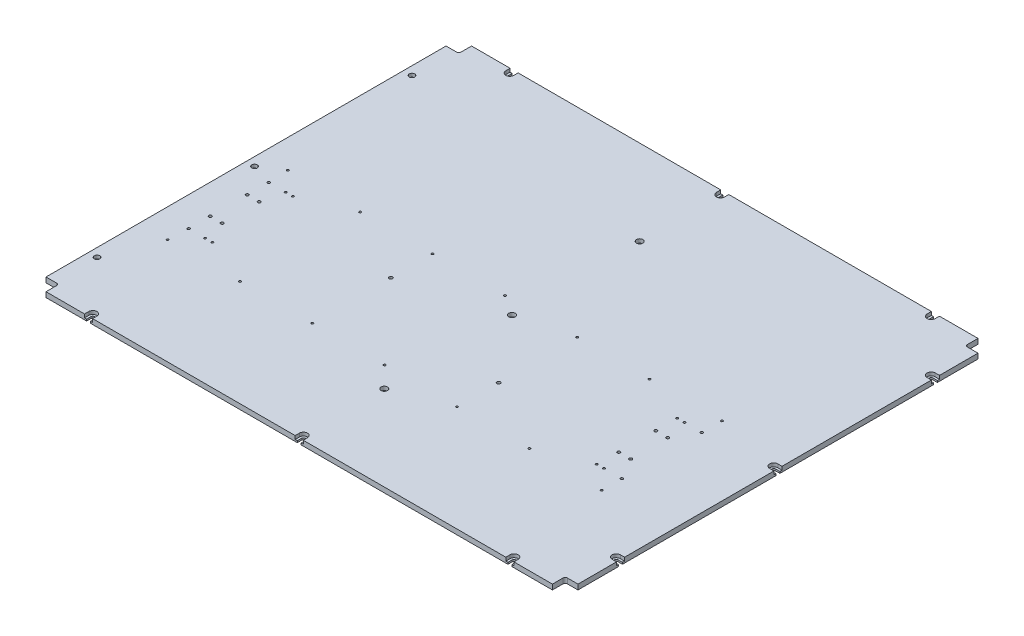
ISO-10303-21;
HEADER;
FILE_DESCRIPTION(('STEP AP214'),'2;1');
FILE_NAME('part.step','',(''),(''),'','','');
FILE_SCHEMA(('AUTOMOTIVE_DESIGN { 1 0 10303 214 1 1 1 1 }'));
ENDSEC;
DATA;
#1=APPLICATION_CONTEXT('core data for automotive mechanical design processes');
#2=APPLICATION_PROTOCOL_DEFINITION('international standard','automotive_design',2000,#1);
#3=PRODUCT_CONTEXT('',#1,'mechanical');
#4=PRODUCT('Part','Part','',(#3));
#5=PRODUCT_RELATED_PRODUCT_CATEGORY('part','',(#4));
#6=PRODUCT_DEFINITION_FORMATION('','',#4);
#7=PRODUCT_DEFINITION_CONTEXT('part definition',#1,'design');
#8=PRODUCT_DEFINITION('design','',#6,#7);
#9=PRODUCT_DEFINITION_SHAPE('','',#8);
#10=(LENGTH_UNIT() NAMED_UNIT(*) SI_UNIT(.MILLI.,.METRE.));
#11=(NAMED_UNIT(*) PLANE_ANGLE_UNIT() SI_UNIT($,.RADIAN.));
#12=(NAMED_UNIT(*) SI_UNIT($,.STERADIAN.) SOLID_ANGLE_UNIT());
#13=UNCERTAINTY_MEASURE_WITH_UNIT(LENGTH_MEASURE(1.E-05),#10,'distance_accuracy_value','');
#14=(GEOMETRIC_REPRESENTATION_CONTEXT(3) GLOBAL_UNCERTAINTY_ASSIGNED_CONTEXT((#13)) GLOBAL_UNIT_ASSIGNED_CONTEXT((#10,
#11,#12)) REPRESENTATION_CONTEXT('',''));
#15=CARTESIAN_POINT('',(0.,0.,0.));
#16=DIRECTION('',(0.,0.,1.));
#17=DIRECTION('',(1.,0.,0.));
#18=AXIS2_PLACEMENT_3D('',#15,#16,#17);
#19=CARTESIAN_POINT('',(-605.,4.,370.));
#20=DIRECTION('',(0.,1.,0.));
#21=DIRECTION('',(0.,0.,1.));
#22=AXIS2_PLACEMENT_3D('',#19,#20,#21);
#23=CYLINDRICAL_SURFACE('',#22,6.4999999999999);
#24=CARTESIAN_POINT('',(-605.,12.,370.));
#25=DIRECTION('',(0.,1.,0.));
#26=DIRECTION('',(0.,0.,1.));
#27=AXIS2_PLACEMENT_3D('',#24,#25,#26);
#28=CIRCLE('',#27,6.4999999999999);
#29=CARTESIAN_POINT('',(-605.,12.,376.5));
#30=VERTEX_POINT('',#29);
#31=EDGE_CURVE('E1208',#30,#30,#28,.F.);
#32=ORIENTED_EDGE('',*,*,#31,.F.);
#33=EDGE_LOOP('',(#32));
#34=FACE_BOUND('',#33,.T.);
#35=CARTESIAN_POINT('',(-605.,4.,370.));
#36=DIRECTION('',(0.,1.,0.));
#37=DIRECTION('',(0.,0.,1.));
#38=AXIS2_PLACEMENT_3D('',#35,#36,#37);
#39=CIRCLE('',#38,6.4999999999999);
#40=CARTESIAN_POINT('',(-605.,4.,376.5));
#41=VERTEX_POINT('',#40);
#42=EDGE_CURVE('E506',#41,#41,#39,.T.);
#43=ORIENTED_EDGE('',*,*,#42,.F.);
#44=EDGE_LOOP('',(#43));
#45=FACE_BOUND('',#44,.T.);
#46=ADVANCED_FACE('F17',(#34,#45),#23,.F.);
#47=CARTESIAN_POINT('',(-605.,4.,0.));
#48=DIRECTION('',(0.,1.,0.));
#49=DIRECTION('',(0.,0.,1.));
#50=AXIS2_PLACEMENT_3D('',#47,#48,#49);
#51=CYLINDRICAL_SURFACE('',#50,6.4999999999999);
#52=CARTESIAN_POINT('',(-605.,12.,0.));
#53=DIRECTION('',(0.,1.,0.));
#54=DIRECTION('',(0.,0.,1.));
#55=AXIS2_PLACEMENT_3D('',#52,#53,#54);
#56=CIRCLE('',#55,6.4999999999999);
#57=CARTESIAN_POINT('',(-605.,12.,6.4999999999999));
#58=VERTEX_POINT('',#57);
#59=EDGE_CURVE('E1205',#58,#58,#56,.F.);
#60=ORIENTED_EDGE('',*,*,#59,.F.);
#61=EDGE_LOOP('',(#60));
#62=FACE_BOUND('',#61,.T.);
#63=CARTESIAN_POINT('',(-605.,4.,0.));
#64=DIRECTION('',(0.,1.,0.));
#65=DIRECTION('',(0.,0.,1.));
#66=AXIS2_PLACEMENT_3D('',#63,#64,#65);
#67=CIRCLE('',#66,6.4999999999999);
#68=CARTESIAN_POINT('',(-605.,4.,6.4999999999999));
#69=VERTEX_POINT('',#68);
#70=EDGE_CURVE('E1236',#69,#69,#67,.T.);
#71=ORIENTED_EDGE('',*,*,#70,.F.);
#72=EDGE_LOOP('',(#71));
#73=FACE_BOUND('',#72,.T.);
#74=ADVANCED_FACE('F1247',(#62,#73),#51,.F.);
#75=CARTESIAN_POINT('',(-605.,4.,-370.));
#76=DIRECTION('',(0.,1.,0.));
#77=DIRECTION('',(0.,0.,1.));
#78=AXIS2_PLACEMENT_3D('',#75,#76,#77);
#79=CYLINDRICAL_SURFACE('',#78,6.4999999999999);
#80=CARTESIAN_POINT('',(-605.,12.,-370.));
#81=DIRECTION('',(0.,1.,0.));
#82=DIRECTION('',(0.,0.,1.));
#83=AXIS2_PLACEMENT_3D('',#80,#81,#82);
#84=CIRCLE('',#83,6.4999999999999);
#85=CARTESIAN_POINT('',(-605.,12.,-363.5));
#86=VERTEX_POINT('',#85);
#87=EDGE_CURVE('E1202',#86,#86,#84,.F.);
#88=ORIENTED_EDGE('',*,*,#87,.F.);
#89=EDGE_LOOP('',(#88));
#90=FACE_BOUND('',#89,.T.);
#91=CARTESIAN_POINT('',(-605.,4.,-370.));
#92=DIRECTION('',(0.,1.,0.));
#93=DIRECTION('',(0.,0.,1.));
#94=AXIS2_PLACEMENT_3D('',#91,#92,#93);
#95=CIRCLE('',#94,6.4999999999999);
#96=CARTESIAN_POINT('',(-605.,4.,-363.5));
#97=VERTEX_POINT('',#96);
#98=EDGE_CURVE('E20',#97,#97,#95,.T.);
#99=ORIENTED_EDGE('',*,*,#98,.F.);
#100=EDGE_LOOP('',(#99));
#101=FACE_BOUND('',#100,.T.);
#102=ADVANCED_FACE('F1245',(#90,#101),#79,.F.);
#103=CARTESIAN_POINT('',(-495.,4.,490.));
#104=DIRECTION('',(0.,1.,0.));
#105=DIRECTION('',(0.,0.,1.));
#106=AXIS2_PLACEMENT_3D('',#103,#104,#105);
#107=CYLINDRICAL_SURFACE('',#106,9.49999999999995);
#108=DIRECTION('',(0.,1.,0.));
#109=VECTOR('',#108,1.);
#110=CARTESIAN_POINT('',(-504.5,4.,490.));
#111=LINE('',#110,#109);
#112=CARTESIAN_POINT('',(-504.5,12.,490.));
#113=VERTEX_POINT('',#112);
#114=CARTESIAN_POINT('',(-504.5,4.,490.));
#115=VERTEX_POINT('',#114);
#116=EDGE_CURVE('E501',#113,#115,#111,.F.);
#117=ORIENTED_EDGE('',*,*,#116,.T.);
#118=CARTESIAN_POINT('',(-495.,4.,490.));
#119=DIRECTION('',(0.,1.,0.));
#120=DIRECTION('',(0.,0.,1.));
#121=AXIS2_PLACEMENT_3D('',#118,#119,#120);
#122=CIRCLE('',#121,9.49999999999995);
#123=CARTESIAN_POINT('',(-485.5,4.,490.));
#124=VERTEX_POINT('',#123);
#125=EDGE_CURVE('E485',#124,#115,#122,.T.);
#126=ORIENTED_EDGE('',*,*,#125,.F.);
#127=DIRECTION('',(0.,1.,0.));
#128=VECTOR('',#127,1.);
#129=CARTESIAN_POINT('',(-485.5,4.,490.));
#130=LINE('',#129,#128);
#131=CARTESIAN_POINT('',(-485.5,12.,490.));
#132=VERTEX_POINT('',#131);
#133=EDGE_CURVE('E513',#124,#132,#130,.T.);
#134=ORIENTED_EDGE('',*,*,#133,.T.);
#135=CARTESIAN_POINT('',(-495.,12.,490.));
#136=DIRECTION('',(0.,1.,0.));
#137=DIRECTION('',(0.,0.,1.));
#138=AXIS2_PLACEMENT_3D('',#135,#136,#137);
#139=CIRCLE('',#138,9.49999999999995);
#140=EDGE_CURVE('E503',#113,#132,#139,.F.);
#141=ORIENTED_EDGE('',*,*,#140,.F.);
#142=EDGE_LOOP('',(#117,#126,#134,#141));
#143=FACE_BOUND('',#142,.T.);
#144=ADVANCED_FACE('F502',(#143),#107,.F.);
#145=CARTESIAN_POINT('',(0.,4.,490.));
#146=DIRECTION('',(0.,1.,0.));
#147=DIRECTION('',(0.,0.,1.));
#148=AXIS2_PLACEMENT_3D('',#145,#146,#147);
#149=CYLINDRICAL_SURFACE('',#148,9.50000000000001);
#150=DIRECTION('',(0.,1.,0.));
#151=VECTOR('',#150,1.);
#152=CARTESIAN_POINT('',(-9.5,4.,490.));
#153=LINE('',#152,#151);
#154=CARTESIAN_POINT('',(-9.50000000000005,12.,490.));
#155=VERTEX_POINT('',#154);
#156=CARTESIAN_POINT('',(-9.5,4.,490.));
#157=VERTEX_POINT('',#156);
#158=EDGE_CURVE('E498',#155,#157,#153,.F.);
#159=ORIENTED_EDGE('',*,*,#158,.T.);
#160=CARTESIAN_POINT('',(0.,4.,490.));
#161=DIRECTION('',(0.,1.,0.));
#162=DIRECTION('',(0.,0.,1.));
#163=AXIS2_PLACEMENT_3D('',#160,#161,#162);
#164=CIRCLE('',#163,9.50000000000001);
#165=CARTESIAN_POINT('',(9.5,4.,490.));
#166=VERTEX_POINT('',#165);
#167=EDGE_CURVE('E598',#166,#157,#164,.T.);
#168=ORIENTED_EDGE('',*,*,#167,.F.);
#169=DIRECTION('',(0.,1.,0.));
#170=VECTOR('',#169,1.);
#171=CARTESIAN_POINT('',(9.5,4.,490.));
#172=LINE('',#171,#170);
#173=CARTESIAN_POINT('',(9.5,12.,490.));
#174=VERTEX_POINT('',#173);
#175=EDGE_CURVE('E599',#166,#174,#172,.T.);
#176=ORIENTED_EDGE('',*,*,#175,.T.);
#177=CARTESIAN_POINT('',(0.,12.,490.));
#178=DIRECTION('',(0.,1.,0.));
#179=DIRECTION('',(0.,0.,1.));
#180=AXIS2_PLACEMENT_3D('',#177,#178,#179);
#181=CIRCLE('',#180,9.50000000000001);
#182=EDGE_CURVE('E1192',#155,#174,#181,.F.);
#183=ORIENTED_EDGE('',*,*,#182,.F.);
#184=EDGE_LOOP('',(#159,#168,#176,#183));
#185=FACE_BOUND('',#184,.T.);
#186=ADVANCED_FACE('F1255',(#185),#149,.F.);
#187=CARTESIAN_POINT('',(495.,4.,490.));
#188=DIRECTION('',(0.,1.,0.));
#189=DIRECTION('',(0.,0.,1.));
#190=AXIS2_PLACEMENT_3D('',#187,#188,#189);
#191=CYLINDRICAL_SURFACE('',#190,9.49999999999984);
#192=DIRECTION('',(0.,1.,0.));
#193=VECTOR('',#192,1.);
#194=CARTESIAN_POINT('',(485.5,4.,490.));
#195=LINE('',#194,#193);
#196=CARTESIAN_POINT('',(485.5,12.,490.));
#197=VERTEX_POINT('',#196);
#198=CARTESIAN_POINT('',(485.5,4.,490.));
#199=VERTEX_POINT('',#198);
#200=EDGE_CURVE('E595',#197,#199,#195,.F.);
#201=ORIENTED_EDGE('',*,*,#200,.T.);
#202=CARTESIAN_POINT('',(495.,4.,490.));
#203=DIRECTION('',(0.,1.,0.));
#204=DIRECTION('',(0.,0.,1.));
#205=AXIS2_PLACEMENT_3D('',#202,#203,#204);
#206=CIRCLE('',#205,9.49999999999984);
#207=CARTESIAN_POINT('',(504.5,4.,490.));
#208=VERTEX_POINT('',#207);
#209=EDGE_CURVE('E602',#208,#199,#206,.T.);
#210=ORIENTED_EDGE('',*,*,#209,.F.);
#211=DIRECTION('',(0.,1.,0.));
#212=VECTOR('',#211,1.);
#213=CARTESIAN_POINT('',(504.5,4.,490.));
#214=LINE('',#213,#212);
#215=CARTESIAN_POINT('',(504.5,12.,490.));
#216=VERTEX_POINT('',#215);
#217=EDGE_CURVE('E591',#208,#216,#214,.T.);
#218=ORIENTED_EDGE('',*,*,#217,.T.);
#219=CARTESIAN_POINT('',(495.,12.,490.));
#220=DIRECTION('',(0.,1.,0.));
#221=DIRECTION('',(0.,0.,1.));
#222=AXIS2_PLACEMENT_3D('',#219,#220,#221);
#223=CIRCLE('',#222,9.49999999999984);
#224=EDGE_CURVE('E1185',#197,#216,#223,.F.);
#225=ORIENTED_EDGE('',*,*,#224,.F.);
#226=EDGE_LOOP('',(#201,#210,#218,#225));
#227=FACE_BOUND('',#226,.T.);
#228=ADVANCED_FACE('F1809',(#227),#191,.F.);
#229=CARTESIAN_POINT('',(615.,4.,370.));
#230=DIRECTION('',(0.,1.,0.));
#231=DIRECTION('',(0.,0.,1.));
#232=AXIS2_PLACEMENT_3D('',#229,#230,#231);
#233=CYLINDRICAL_SURFACE('',#232,9.4999999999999);
#234=DIRECTION('',(0.,1.,0.));
#235=VECTOR('',#234,1.);
#236=CARTESIAN_POINT('',(615.,4.,379.5));
#237=LINE('',#236,#235);
#238=CARTESIAN_POINT('',(615.,12.,379.5));
#239=VERTEX_POINT('',#238);
#240=CARTESIAN_POINT('',(615.,4.,379.5));
#241=VERTEX_POINT('',#240);
#242=EDGE_CURVE('E585',#239,#241,#237,.F.);
#243=ORIENTED_EDGE('',*,*,#242,.T.);
#244=CARTESIAN_POINT('',(615.,4.,370.));
#245=DIRECTION('',(0.,1.,0.));
#246=DIRECTION('',(0.,0.,1.));
#247=AXIS2_PLACEMENT_3D('',#244,#245,#246);
#248=CIRCLE('',#247,9.4999999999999);
#249=CARTESIAN_POINT('',(615.,4.,360.5));
#250=VERTEX_POINT('',#249);
#251=EDGE_CURVE('E584',#250,#241,#248,.T.);
#252=ORIENTED_EDGE('',*,*,#251,.F.);
#253=DIRECTION('',(0.,1.,0.));
#254=VECTOR('',#253,1.);
#255=CARTESIAN_POINT('',(615.,4.,360.5));
#256=LINE('',#255,#254);
#257=CARTESIAN_POINT('',(615.,12.,360.5));
#258=VERTEX_POINT('',#257);
#259=EDGE_CURVE('E575',#250,#258,#256,.T.);
#260=ORIENTED_EDGE('',*,*,#259,.T.);
#261=CARTESIAN_POINT('',(615.,12.,370.));
#262=DIRECTION('',(0.,1.,0.));
#263=DIRECTION('',(0.,0.,1.));
#264=AXIS2_PLACEMENT_3D('',#261,#262,#263);
#265=CIRCLE('',#264,9.4999999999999);
#266=EDGE_CURVE('E1178',#239,#258,#265,.F.);
#267=ORIENTED_EDGE('',*,*,#266,.F.);
#268=EDGE_LOOP('',(#243,#252,#260,#267));
#269=FACE_BOUND('',#268,.T.);
#270=ADVANCED_FACE('F1805',(#269),#233,.F.);
#271=CARTESIAN_POINT('',(615.,4.,0.));
#272=DIRECTION('',(0.,1.,0.));
#273=DIRECTION('',(0.,0.,1.));
#274=AXIS2_PLACEMENT_3D('',#271,#272,#273);
#275=CYLINDRICAL_SURFACE('',#274,9.5);
#276=DIRECTION('',(0.,1.,0.));
#277=VECTOR('',#276,1.);
#278=CARTESIAN_POINT('',(615.,4.,9.5));
#279=LINE('',#278,#277);
#280=CARTESIAN_POINT('',(615.,12.,9.5));
#281=VERTEX_POINT('',#280);
#282=CARTESIAN_POINT('',(615.,4.,9.5));
#283=VERTEX_POINT('',#282);
#284=EDGE_CURVE('E581',#281,#283,#279,.F.);
#285=ORIENTED_EDGE('',*,*,#284,.T.);
#286=CARTESIAN_POINT('',(615.,4.,0.));
#287=DIRECTION('',(0.,1.,0.));
#288=DIRECTION('',(0.,0.,1.));
#289=AXIS2_PLACEMENT_3D('',#286,#287,#288);
#290=CIRCLE('',#289,9.5);
#291=CARTESIAN_POINT('',(615.,4.,-9.5));
#292=VERTEX_POINT('',#291);
#293=EDGE_CURVE('E574',#292,#283,#290,.T.);
#294=ORIENTED_EDGE('',*,*,#293,.F.);
#295=DIRECTION('',(0.,1.,0.));
#296=VECTOR('',#295,1.);
#297=CARTESIAN_POINT('',(615.,4.,-9.5));
#298=LINE('',#297,#296);
#299=CARTESIAN_POINT('',(615.,12.,-9.5));
#300=VERTEX_POINT('',#299);
#301=EDGE_CURVE('E576',#292,#300,#298,.T.);
#302=ORIENTED_EDGE('',*,*,#301,.T.);
#303=CARTESIAN_POINT('',(615.,12.,0.));
#304=DIRECTION('',(0.,1.,0.));
#305=DIRECTION('',(0.,0.,1.));
#306=AXIS2_PLACEMENT_3D('',#303,#304,#305);
#307=CIRCLE('',#306,9.5);
#308=EDGE_CURVE('E1171',#281,#300,#307,.F.);
#309=ORIENTED_EDGE('',*,*,#308,.F.);
#310=EDGE_LOOP('',(#285,#294,#302,#309));
#311=FACE_BOUND('',#310,.T.);
#312=ADVANCED_FACE('F1801',(#311),#275,.F.);
#313=CARTESIAN_POINT('',(615.,4.,-370.));
#314=DIRECTION('',(0.,1.,0.));
#315=DIRECTION('',(0.,0.,1.));
#316=AXIS2_PLACEMENT_3D('',#313,#314,#315);
#317=CYLINDRICAL_SURFACE('',#316,9.50000000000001);
#318=DIRECTION('',(0.,1.,0.));
#319=VECTOR('',#318,1.);
#320=CARTESIAN_POINT('',(615.,4.,-360.5));
#321=LINE('',#320,#319);
#322=CARTESIAN_POINT('',(615.,12.,-360.5));
#323=VERTEX_POINT('',#322);
#324=CARTESIAN_POINT('',(615.,4.,-360.5));
#325=VERTEX_POINT('',#324);
#326=EDGE_CURVE('E571',#323,#325,#321,.F.);
#327=ORIENTED_EDGE('',*,*,#326,.T.);
#328=CARTESIAN_POINT('',(615.,4.,-370.));
#329=DIRECTION('',(0.,1.,0.));
#330=DIRECTION('',(0.,0.,1.));
#331=AXIS2_PLACEMENT_3D('',#328,#329,#330);
#332=CIRCLE('',#331,9.50000000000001);
#333=CARTESIAN_POINT('',(615.,4.,-379.5));
#334=VERTEX_POINT('',#333);
#335=EDGE_CURVE('E579',#334,#325,#332,.T.);
#336=ORIENTED_EDGE('',*,*,#335,.F.);
#337=DIRECTION('',(0.,1.,0.));
#338=VECTOR('',#337,1.);
#339=CARTESIAN_POINT('',(615.,4.,-379.5));
#340=LINE('',#339,#338);
#341=CARTESIAN_POINT('',(615.,12.,-379.5));
#342=VERTEX_POINT('',#341);
#343=EDGE_CURVE('E567',#334,#342,#340,.T.);
#344=ORIENTED_EDGE('',*,*,#343,.T.);
#345=CARTESIAN_POINT('',(615.,12.,-370.));
#346=DIRECTION('',(0.,1.,0.));
#347=DIRECTION('',(0.,0.,1.));
#348=AXIS2_PLACEMENT_3D('',#345,#346,#347);
#349=CIRCLE('',#348,9.50000000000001);
#350=EDGE_CURVE('E1164',#323,#342,#349,.F.);
#351=ORIENTED_EDGE('',*,*,#350,.F.);
#352=EDGE_LOOP('',(#327,#336,#344,#351));
#353=FACE_BOUND('',#352,.T.);
#354=ADVANCED_FACE('F1797',(#353),#317,.F.);
#355=CARTESIAN_POINT('',(495.,4.,-490.));
#356=DIRECTION('',(0.,1.,0.));
#357=DIRECTION('',(0.,0.,1.));
#358=AXIS2_PLACEMENT_3D('',#355,#356,#357);
#359=CYLINDRICAL_SURFACE('',#358,9.49999999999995);
#360=CARTESIAN_POINT('',(495.,4.,-490.));
#361=DIRECTION('',(0.,1.,0.));
#362=DIRECTION('',(0.,0.,1.));
#363=AXIS2_PLACEMENT_3D('',#360,#361,#362);
#364=CIRCLE('',#363,9.49999999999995);
#365=CARTESIAN_POINT('',(485.5,4.,-490.));
#366=VERTEX_POINT('',#365);
#367=CARTESIAN_POINT('',(504.5,4.,-490.));
#368=VERTEX_POINT('',#367);
#369=EDGE_CURVE('E560',#366,#368,#364,.T.);
#370=ORIENTED_EDGE('',*,*,#369,.F.);
#371=DIRECTION('',(0.,1.,0.));
#372=VECTOR('',#371,1.);
#373=CARTESIAN_POINT('',(485.5,4.,-490.));
#374=LINE('',#373,#372);
#375=CARTESIAN_POINT('',(485.5,12.,-490.));
#376=VERTEX_POINT('',#375);
#377=EDGE_CURVE('E551',#366,#376,#374,.T.);
#378=ORIENTED_EDGE('',*,*,#377,.T.);
#379=CARTESIAN_POINT('',(495.,12.,-490.));
#380=DIRECTION('',(0.,1.,0.));
#381=DIRECTION('',(0.,0.,1.));
#382=AXIS2_PLACEMENT_3D('',#379,#380,#381);
#383=CIRCLE('',#382,9.49999999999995);
#384=CARTESIAN_POINT('',(504.5,12.,-490.));
#385=VERTEX_POINT('',#384);
#386=EDGE_CURVE('E1157',#385,#376,#383,.F.);
#387=ORIENTED_EDGE('',*,*,#386,.F.);
#388=DIRECTION('',(0.,1.,0.));
#389=VECTOR('',#388,1.);
#390=CARTESIAN_POINT('',(504.5,4.,-490.));
#391=LINE('',#390,#389);
#392=EDGE_CURVE('E561',#385,#368,#391,.F.);
#393=ORIENTED_EDGE('',*,*,#392,.T.);
#394=EDGE_LOOP('',(#370,#378,#387,#393));
#395=FACE_BOUND('',#394,.T.);
#396=ADVANCED_FACE('F1793',(#395),#359,.F.);
#397=CARTESIAN_POINT('',(0.,4.,-490.));
#398=DIRECTION('',(0.,1.,0.));
#399=DIRECTION('',(0.,0.,1.));
#400=AXIS2_PLACEMENT_3D('',#397,#398,#399);
#401=CYLINDRICAL_SURFACE('',#400,9.50000000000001);
#402=CARTESIAN_POINT('',(0.,4.,-490.));
#403=DIRECTION('',(0.,1.,0.));
#404=DIRECTION('',(0.,0.,1.));
#405=AXIS2_PLACEMENT_3D('',#402,#403,#404);
#406=CIRCLE('',#405,9.50000000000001);
#407=CARTESIAN_POINT('',(-9.5,4.,-490.));
#408=VERTEX_POINT('',#407);
#409=CARTESIAN_POINT('',(9.5,4.,-490.));
#410=VERTEX_POINT('',#409);
#411=EDGE_CURVE('E550',#408,#410,#406,.T.);
#412=ORIENTED_EDGE('',*,*,#411,.F.);
#413=DIRECTION('',(0.,1.,0.));
#414=VECTOR('',#413,1.);
#415=CARTESIAN_POINT('',(-9.5,4.,-490.));
#416=LINE('',#415,#414);
#417=CARTESIAN_POINT('',(-9.5,12.,-490.));
#418=VERTEX_POINT('',#417);
#419=EDGE_CURVE('E552',#408,#418,#416,.T.);
#420=ORIENTED_EDGE('',*,*,#419,.T.);
#421=CARTESIAN_POINT('',(0.,12.,-490.));
#422=DIRECTION('',(0.,1.,0.));
#423=DIRECTION('',(0.,0.,1.));
#424=AXIS2_PLACEMENT_3D('',#421,#422,#423);
#425=CIRCLE('',#424,9.50000000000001);
#426=CARTESIAN_POINT('',(9.49999999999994,12.,-490.));
#427=VERTEX_POINT('',#426);
#428=EDGE_CURVE('E1150',#427,#418,#425,.F.);
#429=ORIENTED_EDGE('',*,*,#428,.F.);
#430=DIRECTION('',(0.,1.,0.));
#431=VECTOR('',#430,1.);
#432=CARTESIAN_POINT('',(9.5,4.,-490.));
#433=LINE('',#432,#431);
#434=EDGE_CURVE('E557',#427,#410,#433,.F.);
#435=ORIENTED_EDGE('',*,*,#434,.T.);
#436=EDGE_LOOP('',(#412,#420,#429,#435));
#437=FACE_BOUND('',#436,.T.);
#438=ADVANCED_FACE('F1789',(#437),#401,.F.);
#439=CARTESIAN_POINT('',(-495.,4.,-490.));
#440=DIRECTION('',(0.,1.,0.));
#441=DIRECTION('',(0.,0.,1.));
#442=AXIS2_PLACEMENT_3D('',#439,#440,#441);
#443=CYLINDRICAL_SURFACE('',#442,9.49999999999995);
#444=CARTESIAN_POINT('',(-495.,4.,-490.));
#445=DIRECTION('',(0.,1.,0.));
#446=DIRECTION('',(0.,0.,1.));
#447=AXIS2_PLACEMENT_3D('',#444,#445,#446);
#448=CIRCLE('',#447,9.49999999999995);
#449=CARTESIAN_POINT('',(-504.5,4.,-490.));
#450=VERTEX_POINT('',#449);
#451=CARTESIAN_POINT('',(-485.5,4.,-490.));
#452=VERTEX_POINT('',#451);
#453=EDGE_CURVE('E555',#450,#452,#448,.T.);
#454=ORIENTED_EDGE('',*,*,#453,.F.);
#455=DIRECTION('',(0.,1.,0.));
#456=VECTOR('',#455,1.);
#457=CARTESIAN_POINT('',(-504.5,4.,-490.));
#458=LINE('',#457,#456);
#459=CARTESIAN_POINT('',(-504.5,12.,-490.));
#460=VERTEX_POINT('',#459);
#461=EDGE_CURVE('E542',#450,#460,#458,.T.);
#462=ORIENTED_EDGE('',*,*,#461,.T.);
#463=CARTESIAN_POINT('',(-495.,12.,-490.));
#464=DIRECTION('',(0.,1.,0.));
#465=DIRECTION('',(0.,0.,1.));
#466=AXIS2_PLACEMENT_3D('',#463,#464,#465);
#467=CIRCLE('',#466,9.49999999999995);
#468=CARTESIAN_POINT('',(-485.5,12.,-490.));
#469=VERTEX_POINT('',#468);
#470=EDGE_CURVE('E1143',#469,#460,#467,.F.);
#471=ORIENTED_EDGE('',*,*,#470,.F.);
#472=DIRECTION('',(0.,1.,0.));
#473=VECTOR('',#472,1.);
#474=CARTESIAN_POINT('',(-485.5,4.,-490.));
#475=LINE('',#474,#473);
#476=EDGE_CURVE('E547',#469,#452,#475,.F.);
#477=ORIENTED_EDGE('',*,*,#476,.T.);
#478=EDGE_LOOP('',(#454,#462,#471,#477));
#479=FACE_BOUND('',#478,.T.);
#480=ADVANCED_FACE('F1785',(#479),#443,.F.);
#481=CARTESIAN_POINT('',(0.,12.,0.));
#482=DIRECTION('',(0.,1.,0.));
#483=DIRECTION('',(0.,0.,1.));
#484=AXIS2_PLACEMENT_3D('',#481,#482,#483);
#485=CYLINDRICAL_SURFACE('',#484,7.5);
#486=CARTESIAN_POINT('',(0.,12.,0.));
#487=DIRECTION('',(0.,1.,0.));
#488=DIRECTION('',(0.,0.,1.));
#489=AXIS2_PLACEMENT_3D('',#486,#487,#488);
#490=CIRCLE('',#489,7.5);
#491=CARTESIAN_POINT('',(0.,12.,7.5));
#492=VERTEX_POINT('',#491);
#493=EDGE_CURVE('E1138',#492,#492,#490,.F.);
#494=ORIENTED_EDGE('',*,*,#493,.F.);
#495=EDGE_LOOP('',(#494));
#496=FACE_BOUND('',#495,.T.);
#497=CARTESIAN_POINT('',(0.,3.,0.));
#498=DIRECTION('',(0.,1.,0.));
#499=DIRECTION('',(0.,0.,1.));
#500=AXIS2_PLACEMENT_3D('',#497,#498,#499);
#501=CIRCLE('',#500,7.5);
#502=CARTESIAN_POINT('',(0.,3.,7.5));
#503=VERTEX_POINT('',#502);
#504=EDGE_CURVE('E545',#503,#503,#501,.F.);
#505=ORIENTED_EDGE('',*,*,#504,.T.);
#506=EDGE_LOOP('',(#505));
#507=FACE_BOUND('',#506,.T.);
#508=ADVANCED_FACE('F1781',(#496,#507),#485,.F.);
#509=CARTESIAN_POINT('',(-1.11022302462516E-13,12.,-300.));
#510=DIRECTION('',(0.,1.,0.));
#511=DIRECTION('',(0.,0.,1.));
#512=AXIS2_PLACEMENT_3D('',#509,#510,#511);
#513=CYLINDRICAL_SURFACE('',#512,7.50000000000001);
#514=CARTESIAN_POINT('',(-1.11022302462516E-13,12.,-300.));
#515=DIRECTION('',(0.,1.,0.));
#516=DIRECTION('',(0.,0.,1.));
#517=AXIS2_PLACEMENT_3D('',#514,#515,#516);
#518=CIRCLE('',#517,7.50000000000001);
#519=CARTESIAN_POINT('',(-1.11022302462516E-13,12.,-292.5));
#520=VERTEX_POINT('',#519);
#521=EDGE_CURVE('E1135',#520,#520,#518,.F.);
#522=ORIENTED_EDGE('',*,*,#521,.F.);
#523=EDGE_LOOP('',(#522));
#524=FACE_BOUND('',#523,.T.);
#525=CARTESIAN_POINT('',(-1.11022302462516E-13,3.,-300.));
#526=DIRECTION('',(0.,1.,0.));
#527=DIRECTION('',(0.,0.,1.));
#528=AXIS2_PLACEMENT_3D('',#525,#526,#527);
#529=CIRCLE('',#528,7.50000000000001);
#530=CARTESIAN_POINT('',(-1.11022302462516E-13,3.,-292.5));
#531=VERTEX_POINT('',#530);
#532=EDGE_CURVE('E1214',#531,#531,#529,.F.);
#533=ORIENTED_EDGE('',*,*,#532,.T.);
#534=EDGE_LOOP('',(#533));
#535=FACE_BOUND('',#534,.T.);
#536=ADVANCED_FACE('F1777',(#524,#535),#513,.F.);
#537=CARTESIAN_POINT('',(-1.11022302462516E-13,12.,300.));
#538=DIRECTION('',(0.,1.,0.));
#539=DIRECTION('',(0.,0.,1.));
#540=AXIS2_PLACEMENT_3D('',#537,#538,#539);
#541=CYLINDRICAL_SURFACE('',#540,7.50000000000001);
#542=CARTESIAN_POINT('',(-1.11022302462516E-13,12.,300.));
#543=DIRECTION('',(0.,1.,0.));
#544=DIRECTION('',(0.,0.,1.));
#545=AXIS2_PLACEMENT_3D('',#542,#543,#544);
#546=CIRCLE('',#545,7.50000000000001);
#547=CARTESIAN_POINT('',(-1.11022302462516E-13,12.,307.5));
#548=VERTEX_POINT('',#547);
#549=EDGE_CURVE('E1132',#548,#548,#546,.F.);
#550=ORIENTED_EDGE('',*,*,#549,.F.);
#551=EDGE_LOOP('',(#550));
#552=FACE_BOUND('',#551,.T.);
#553=CARTESIAN_POINT('',(-1.11022302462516E-13,3.,300.));
#554=DIRECTION('',(0.,1.,0.));
#555=DIRECTION('',(0.,0.,1.));
#556=AXIS2_PLACEMENT_3D('',#553,#554,#555);
#557=CIRCLE('',#556,7.50000000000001);
#558=CARTESIAN_POINT('',(-1.11022302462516E-13,3.,307.5));
#559=VERTEX_POINT('',#558);
#560=EDGE_CURVE('E1211',#559,#559,#557,.F.);
#561=ORIENTED_EDGE('',*,*,#560,.T.);
#562=EDGE_LOOP('',(#561));
#563=FACE_BOUND('',#562,.T.);
#564=ADVANCED_FACE('F1773',(#552,#563),#541,.F.);
#565=CARTESIAN_POINT('',(-605.,4.,-370.));
#566=DIRECTION('',(0.,1.,0.));
#567=DIRECTION('',(0.,0.,1.));
#568=AXIS2_PLACEMENT_3D('',#565,#566,#567);
#569=PLANE('',#568);
#570=CARTESIAN_POINT('',(-605.,4.,-370.));
#571=DIRECTION('',(0.,1.,0.));
#572=DIRECTION('',(0.,0.,1.));
#573=AXIS2_PLACEMENT_3D('',#570,#571,#572);
#574=CIRCLE('',#573,4.25000000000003);
#575=CARTESIAN_POINT('',(-605.,4.,-365.75));
#576=VERTEX_POINT('',#575);
#577=EDGE_CURVE('E1129',#576,#576,#574,.F.);
#578=ORIENTED_EDGE('',*,*,#577,.T.);
#579=EDGE_LOOP('',(#578));
#580=FACE_BOUND('',#579,.T.);
#581=ORIENTED_EDGE('',*,*,#98,.T.);
#582=EDGE_LOOP('',(#581));
#583=FACE_BOUND('',#582,.T.);
#584=ADVANCED_FACE('F1243',(#580,#583),#569,.T.);
#585=CARTESIAN_POINT('',(-605.,4.,0.));
#586=DIRECTION('',(0.,1.,0.));
#587=DIRECTION('',(0.,0.,1.));
#588=AXIS2_PLACEMENT_3D('',#585,#586,#587);
#589=PLANE('',#588);
#590=CARTESIAN_POINT('',(-605.,4.,0.));
#591=DIRECTION('',(0.,1.,0.));
#592=DIRECTION('',(0.,0.,1.));
#593=AXIS2_PLACEMENT_3D('',#590,#591,#592);
#594=CIRCLE('',#593,4.25);
#595=CARTESIAN_POINT('',(-605.,4.,4.25));
#596=VERTEX_POINT('',#595);
#597=EDGE_CURVE('E1126',#596,#596,#594,.F.);
#598=ORIENTED_EDGE('',*,*,#597,.T.);
#599=EDGE_LOOP('',(#598));
#600=FACE_BOUND('',#599,.T.);
#601=ORIENTED_EDGE('',*,*,#70,.T.);
#602=EDGE_LOOP('',(#601));
#603=FACE_BOUND('',#602,.T.);
#604=ADVANCED_FACE('F1766',(#600,#603),#589,.T.);
#605=CARTESIAN_POINT('',(-605.,4.,370.));
#606=DIRECTION('',(0.,1.,0.));
#607=DIRECTION('',(0.,0.,1.));
#608=AXIS2_PLACEMENT_3D('',#605,#606,#607);
#609=PLANE('',#608);
#610=CARTESIAN_POINT('',(-605.,4.,370.));
#611=DIRECTION('',(0.,1.,0.));
#612=DIRECTION('',(0.,0.,1.));
#613=AXIS2_PLACEMENT_3D('',#610,#611,#612);
#614=CIRCLE('',#613,4.25000000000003);
#615=CARTESIAN_POINT('',(-605.,4.,374.25));
#616=VERTEX_POINT('',#615);
#617=EDGE_CURVE('E1123',#616,#616,#614,.F.);
#618=ORIENTED_EDGE('',*,*,#617,.T.);
#619=EDGE_LOOP('',(#618));
#620=FACE_BOUND('',#619,.T.);
#621=ORIENTED_EDGE('',*,*,#42,.T.);
#622=EDGE_LOOP('',(#621));
#623=FACE_BOUND('',#622,.T.);
#624=ADVANCED_FACE('F1763',(#620,#623),#609,.T.);
#625=CARTESIAN_POINT('',(-504.5,4.,490.));
#626=DIRECTION('',(-1.,0.,0.));
#627=DIRECTION('',(0.,0.,1.));
#628=AXIS2_PLACEMENT_3D('',#625,#626,#627);
#629=PLANE('',#628);
#630=DIRECTION('',(0.,1.,0.));
#631=VECTOR('',#630,1.);
#632=CARTESIAN_POINT('',(-504.5,12.,500.));
#633=LINE('',#632,#631);
#634=CARTESIAN_POINT('',(-504.5,12.,500.));
#635=VERTEX_POINT('',#634);
#636=CARTESIAN_POINT('',(-504.5,4.,500.));
#637=VERTEX_POINT('',#636);
#638=EDGE_CURVE('E511',#635,#637,#633,.F.);
#639=ORIENTED_EDGE('',*,*,#638,.T.);
#640=DIRECTION('',(0.,0.,1.));
#641=VECTOR('',#640,1.);
#642=CARTESIAN_POINT('',(-504.5,4.,490.));
#643=LINE('',#642,#641);
#644=EDGE_CURVE('E493',#115,#637,#643,.T.);
#645=ORIENTED_EDGE('',*,*,#644,.F.);
#646=ORIENTED_EDGE('',*,*,#116,.F.);
#647=DIRECTION('',(0.,0.,1.));
#648=VECTOR('',#647,1.);
#649=CARTESIAN_POINT('',(-504.5,12.,0.));
#650=LINE('',#649,#648);
#651=EDGE_CURVE('E1200',#635,#113,#650,.F.);
#652=ORIENTED_EDGE('',*,*,#651,.F.);
#653=EDGE_LOOP('',(#639,#645,#646,#652));
#654=FACE_BOUND('',#653,.T.);
#655=ADVANCED_FACE('F509',(#654),#629,.F.);
#656=CARTESIAN_POINT('',(-9.5,4.,490.));
#657=DIRECTION('',(-1.,0.,0.));
#658=DIRECTION('',(0.,0.,1.));
#659=AXIS2_PLACEMENT_3D('',#656,#657,#658);
#660=PLANE('',#659);
#661=DIRECTION('',(0.,1.,0.));
#662=VECTOR('',#661,1.);
#663=CARTESIAN_POINT('',(-9.50000000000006,12.,500.));
#664=LINE('',#663,#662);
#665=CARTESIAN_POINT('',(-9.50000000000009,12.,500.));
#666=VERTEX_POINT('',#665);
#667=CARTESIAN_POINT('',(-9.50000000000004,4.,500.));
#668=VERTEX_POINT('',#667);
#669=EDGE_CURVE('E524',#666,#668,#664,.F.);
#670=ORIENTED_EDGE('',*,*,#669,.T.);
#671=DIRECTION('',(0.,0.,1.));
#672=VECTOR('',#671,1.);
#673=CARTESIAN_POINT('',(-9.5,4.,490.));
#674=LINE('',#673,#672);
#675=EDGE_CURVE('E1233',#157,#668,#674,.T.);
#676=ORIENTED_EDGE('',*,*,#675,.F.);
#677=ORIENTED_EDGE('',*,*,#158,.F.);
#678=DIRECTION('',(0.,0.,1.));
#679=VECTOR('',#678,1.);
#680=CARTESIAN_POINT('',(-9.50000000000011,12.,0.));
#681=LINE('',#680,#679);
#682=EDGE_CURVE('E1194',#666,#155,#681,.F.);
#683=ORIENTED_EDGE('',*,*,#682,.F.);
#684=EDGE_LOOP('',(#670,#676,#677,#683));
#685=FACE_BOUND('',#684,.T.);
#686=ADVANCED_FACE('F1757',(#685),#660,.F.);
#687=CARTESIAN_POINT('',(-495.,4.,490.));
#688=DIRECTION('',(0.,1.,0.));
#689=DIRECTION('',(0.,0.,1.));
#690=AXIS2_PLACEMENT_3D('',#687,#688,#689);
#691=PLANE('',#690);
#692=ORIENTED_EDGE('',*,*,#125,.T.);
#693=ORIENTED_EDGE('',*,*,#644,.T.);
#694=DIRECTION('',(-1.,0.,0.));
#695=VECTOR('',#694,1.);
#696=CARTESIAN_POINT('',(-625.,4.,500.));
#697=LINE('',#696,#695);
#698=CARTESIAN_POINT('',(-499.5,4.,500.));
#699=VERTEX_POINT('',#698);
#700=EDGE_CURVE('E534',#637,#699,#697,.F.);
#701=ORIENTED_EDGE('',*,*,#700,.T.);
#702=DIRECTION('',(0.,0.,1.));
#703=VECTOR('',#702,1.);
#704=CARTESIAN_POINT('',(-499.5,4.,500.));
#705=LINE('',#704,#703);
#706=CARTESIAN_POINT('',(-499.5,4.,490.));
#707=VERTEX_POINT('',#706);
#708=EDGE_CURVE('E528',#699,#707,#705,.F.);
#709=ORIENTED_EDGE('',*,*,#708,.T.);
#710=CARTESIAN_POINT('',(-495.,4.,490.));
#711=DIRECTION('',(0.,1.,0.));
#712=DIRECTION('',(0.,0.,1.));
#713=AXIS2_PLACEMENT_3D('',#710,#711,#712);
#714=CIRCLE('',#713,4.49999999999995);
#715=CARTESIAN_POINT('',(-490.5,4.,490.));
#716=VERTEX_POINT('',#715);
#717=EDGE_CURVE('E1113',#707,#716,#714,.F.);
#718=ORIENTED_EDGE('',*,*,#717,.T.);
#719=DIRECTION('',(0.,0.,-1.));
#720=VECTOR('',#719,1.);
#721=CARTESIAN_POINT('',(-490.5,4.,500.));
#722=LINE('',#721,#720);
#723=CARTESIAN_POINT('',(-490.5,4.,500.));
#724=VERTEX_POINT('',#723);
#725=EDGE_CURVE('E521',#716,#724,#722,.F.);
#726=ORIENTED_EDGE('',*,*,#725,.T.);
#727=DIRECTION('',(-1.,0.,0.));
#728=VECTOR('',#727,1.);
#729=CARTESIAN_POINT('',(-625.,4.,500.));
#730=LINE('',#729,#728);
#731=CARTESIAN_POINT('',(-485.5,4.,500.));
#732=VERTEX_POINT('',#731);
#733=EDGE_CURVE('E1852',#724,#732,#730,.F.);
#734=ORIENTED_EDGE('',*,*,#733,.T.);
#735=DIRECTION('',(0.,0.,-1.));
#736=VECTOR('',#735,1.);
#737=CARTESIAN_POINT('',(-485.5,4.,490.));
#738=LINE('',#737,#736);
#739=EDGE_CURVE('E497',#732,#124,#738,.T.);
#740=ORIENTED_EDGE('',*,*,#739,.T.);
#741=EDGE_LOOP('',(#692,#693,#701,#709,#718,#726,#734,#740));
#742=FACE_BOUND('',#741,.T.);
#743=ADVANCED_FACE('F490',(#742),#691,.T.);
#744=CARTESIAN_POINT('',(-485.5,4.,490.));
#745=DIRECTION('',(1.,0.,0.));
#746=DIRECTION('',(0.,0.,-1.));
#747=AXIS2_PLACEMENT_3D('',#744,#745,#746);
#748=PLANE('',#747);
#749=ORIENTED_EDGE('',*,*,#133,.F.);
#750=ORIENTED_EDGE('',*,*,#739,.F.);
#751=DIRECTION('',(0.,1.,0.));
#752=VECTOR('',#751,1.);
#753=CARTESIAN_POINT('',(-485.5,12.,500.));
#754=LINE('',#753,#752);
#755=CARTESIAN_POINT('',(-485.5,12.,500.));
#756=VERTEX_POINT('',#755);
#757=EDGE_CURVE('E1112',#732,#756,#754,.T.);
#758=ORIENTED_EDGE('',*,*,#757,.T.);
#759=DIRECTION('',(0.,0.,1.));
#760=VECTOR('',#759,1.);
#761=CARTESIAN_POINT('',(-485.5,12.,0.));
#762=LINE('',#761,#760);
#763=EDGE_CURVE('E1197',#132,#756,#762,.T.);
#764=ORIENTED_EDGE('',*,*,#763,.F.);
#765=EDGE_LOOP('',(#749,#750,#758,#764));
#766=FACE_BOUND('',#765,.T.);
#767=ADVANCED_FACE('F1750',(#766),#748,.F.);
#768=CARTESIAN_POINT('',(485.5,4.,490.));
#769=DIRECTION('',(-1.,0.,0.));
#770=DIRECTION('',(0.,0.,1.));
#771=AXIS2_PLACEMENT_3D('',#768,#769,#770);
#772=PLANE('',#771);
#773=DIRECTION('',(0.,1.,0.));
#774=VECTOR('',#773,1.);
#775=CARTESIAN_POINT('',(485.5,12.,500.));
#776=LINE('',#775,#774);
#777=CARTESIAN_POINT('',(485.5,12.,500.));
#778=VERTEX_POINT('',#777);
#779=CARTESIAN_POINT('',(485.5,4.,500.));
#780=VERTEX_POINT('',#779);
#781=EDGE_CURVE('E1838',#778,#780,#776,.F.);
#782=ORIENTED_EDGE('',*,*,#781,.T.);
#783=DIRECTION('',(0.,0.,1.));
#784=VECTOR('',#783,1.);
#785=CARTESIAN_POINT('',(485.5,4.,490.));
#786=LINE('',#785,#784);
#787=EDGE_CURVE('E1232',#199,#780,#786,.T.);
#788=ORIENTED_EDGE('',*,*,#787,.F.);
#789=ORIENTED_EDGE('',*,*,#200,.F.);
#790=DIRECTION('',(0.,0.,1.));
#791=VECTOR('',#790,1.);
#792=CARTESIAN_POINT('',(485.5,12.,0.));
#793=LINE('',#792,#791);
#794=EDGE_CURVE('E1187',#778,#197,#793,.F.);
#795=ORIENTED_EDGE('',*,*,#794,.F.);
#796=EDGE_LOOP('',(#782,#788,#789,#795));
#797=FACE_BOUND('',#796,.T.);
#798=ADVANCED_FACE('F1746',(#797),#772,.F.);
#799=CARTESIAN_POINT('',(0.,4.,490.));
#800=DIRECTION('',(0.,1.,0.));
#801=DIRECTION('',(0.,0.,1.));
#802=AXIS2_PLACEMENT_3D('',#799,#800,#801);
#803=PLANE('',#802);
#804=ORIENTED_EDGE('',*,*,#167,.T.);
#805=ORIENTED_EDGE('',*,*,#675,.T.);
#806=DIRECTION('',(-1.,0.,0.));
#807=VECTOR('',#806,1.);
#808=CARTESIAN_POINT('',(-625.,4.,500.));
#809=LINE('',#808,#807);
#810=CARTESIAN_POINT('',(-4.50000000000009,4.,500.));
#811=VERTEX_POINT('',#810);
#812=EDGE_CURVE('E1845',#668,#811,#809,.F.);
#813=ORIENTED_EDGE('',*,*,#812,.T.);
#814=DIRECTION('',(0.,0.,1.));
#815=VECTOR('',#814,1.);
#816=CARTESIAN_POINT('',(-4.50000000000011,4.,500.));
#817=LINE('',#816,#815);
#818=CARTESIAN_POINT('',(-4.50000000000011,4.,490.));
#819=VERTEX_POINT('',#818);
#820=EDGE_CURVE('E1841',#811,#819,#817,.F.);
#821=ORIENTED_EDGE('',*,*,#820,.T.);
#822=CARTESIAN_POINT('',(0.,4.,490.));
#823=DIRECTION('',(0.,1.,0.));
#824=DIRECTION('',(0.,0.,1.));
#825=AXIS2_PLACEMENT_3D('',#822,#823,#824);
#826=CIRCLE('',#825,4.50000000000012);
#827=CARTESIAN_POINT('',(4.50000000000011,4.,490.));
#828=VERTEX_POINT('',#827);
#829=EDGE_CURVE('E1104',#819,#828,#826,.F.);
#830=ORIENTED_EDGE('',*,*,#829,.T.);
#831=DIRECTION('',(0.,0.,-1.));
#832=VECTOR('',#831,1.);
#833=CARTESIAN_POINT('',(4.50000000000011,4.,500.));
#834=LINE('',#833,#832);
#835=CARTESIAN_POINT('',(4.50000000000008,4.,500.));
#836=VERTEX_POINT('',#835);
#837=EDGE_CURVE('E1835',#828,#836,#834,.F.);
#838=ORIENTED_EDGE('',*,*,#837,.T.);
#839=DIRECTION('',(-1.,0.,0.));
#840=VECTOR('',#839,1.);
#841=CARTESIAN_POINT('',(-625.,4.,500.));
#842=LINE('',#841,#840);
#843=CARTESIAN_POINT('',(9.49999999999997,4.,500.));
#844=VERTEX_POINT('',#843);
#845=EDGE_CURVE('E2142',#836,#844,#842,.F.);
#846=ORIENTED_EDGE('',*,*,#845,.T.);
#847=DIRECTION('',(0.,0.,-1.));
#848=VECTOR('',#847,1.);
#849=CARTESIAN_POINT('',(9.5,4.,490.));
#850=LINE('',#849,#848);
#851=EDGE_CURVE('E603',#844,#166,#850,.T.);
#852=ORIENTED_EDGE('',*,*,#851,.T.);
#853=EDGE_LOOP('',(#804,#805,#813,#821,#830,#838,#846,#852));
#854=FACE_BOUND('',#853,.T.);
#855=ADVANCED_FACE('F1742',(#854),#803,.T.);
#856=CARTESIAN_POINT('',(9.5,4.,490.));
#857=DIRECTION('',(1.,0.,0.));
#858=DIRECTION('',(0.,0.,-1.));
#859=AXIS2_PLACEMENT_3D('',#856,#857,#858);
#860=PLANE('',#859);
#861=ORIENTED_EDGE('',*,*,#175,.F.);
#862=ORIENTED_EDGE('',*,*,#851,.F.);
#863=DIRECTION('',(0.,1.,0.));
#864=VECTOR('',#863,1.);
#865=CARTESIAN_POINT('',(9.49999999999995,12.,500.));
#866=LINE('',#865,#864);
#867=CARTESIAN_POINT('',(9.49999999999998,12.,500.));
#868=VERTEX_POINT('',#867);
#869=EDGE_CURVE('E1103',#844,#868,#866,.T.);
#870=ORIENTED_EDGE('',*,*,#869,.T.);
#871=DIRECTION('',(0.,0.,1.));
#872=VECTOR('',#871,1.);
#873=CARTESIAN_POINT('',(9.5,12.,0.));
#874=LINE('',#873,#872);
#875=EDGE_CURVE('E1190',#174,#868,#874,.T.);
#876=ORIENTED_EDGE('',*,*,#875,.F.);
#877=EDGE_LOOP('',(#861,#862,#870,#876));
#878=FACE_BOUND('',#877,.T.);
#879=ADVANCED_FACE('F1738',(#878),#860,.F.);
#880=CARTESIAN_POINT('',(495.,4.,490.));
#881=DIRECTION('',(0.,1.,0.));
#882=DIRECTION('',(0.,0.,1.));
#883=AXIS2_PLACEMENT_3D('',#880,#881,#882);
#884=PLANE('',#883);
#885=ORIENTED_EDGE('',*,*,#209,.T.);
#886=ORIENTED_EDGE('',*,*,#787,.T.);
#887=DIRECTION('',(-1.,0.,0.));
#888=VECTOR('',#887,1.);
#889=CARTESIAN_POINT('',(-625.,4.,500.));
#890=LINE('',#889,#888);
#891=CARTESIAN_POINT('',(490.5,4.,500.));
#892=VERTEX_POINT('',#891);
#893=EDGE_CURVE('E2134',#780,#892,#890,.F.);
#894=ORIENTED_EDGE('',*,*,#893,.T.);
#895=DIRECTION('',(0.,0.,1.));
#896=VECTOR('',#895,1.);
#897=CARTESIAN_POINT('',(490.5,4.,500.));
#898=LINE('',#897,#896);
#899=CARTESIAN_POINT('',(490.5,4.,490.));
#900=VERTEX_POINT('',#899);
#901=EDGE_CURVE('E2130',#892,#900,#898,.F.);
#902=ORIENTED_EDGE('',*,*,#901,.T.);
#903=CARTESIAN_POINT('',(495.,4.,490.));
#904=DIRECTION('',(0.,1.,0.));
#905=DIRECTION('',(0.,0.,1.));
#906=AXIS2_PLACEMENT_3D('',#903,#904,#905);
#907=CIRCLE('',#906,4.5);
#908=CARTESIAN_POINT('',(499.5,4.,490.));
#909=VERTEX_POINT('',#908);
#910=EDGE_CURVE('E1095',#900,#909,#907,.F.);
#911=ORIENTED_EDGE('',*,*,#910,.T.);
#912=DIRECTION('',(0.,0.,-1.));
#913=VECTOR('',#912,1.);
#914=CARTESIAN_POINT('',(499.5,4.,500.));
#915=LINE('',#914,#913);
#916=CARTESIAN_POINT('',(499.5,4.,500.));
#917=VERTEX_POINT('',#916);
#918=EDGE_CURVE('E2125',#909,#917,#915,.F.);
#919=ORIENTED_EDGE('',*,*,#918,.T.);
#920=DIRECTION('',(-1.,0.,0.));
#921=VECTOR('',#920,1.);
#922=CARTESIAN_POINT('',(-625.,4.,500.));
#923=LINE('',#922,#921);
#924=CARTESIAN_POINT('',(504.5,4.,500.));
#925=VERTEX_POINT('',#924);
#926=EDGE_CURVE('E2109',#917,#925,#923,.F.);
#927=ORIENTED_EDGE('',*,*,#926,.T.);
#928=DIRECTION('',(0.,0.,-1.));
#929=VECTOR('',#928,1.);
#930=CARTESIAN_POINT('',(504.5,4.,490.));
#931=LINE('',#930,#929);
#932=EDGE_CURVE('E594',#925,#208,#931,.T.);
#933=ORIENTED_EDGE('',*,*,#932,.T.);
#934=EDGE_LOOP('',(#885,#886,#894,#902,#911,#919,#927,#933));
#935=FACE_BOUND('',#934,.T.);
#936=ADVANCED_FACE('F1734',(#935),#884,.T.);
#937=CARTESIAN_POINT('',(504.5,4.,490.));
#938=DIRECTION('',(1.,0.,0.));
#939=DIRECTION('',(0.,0.,-1.));
#940=AXIS2_PLACEMENT_3D('',#937,#938,#939);
#941=PLANE('',#940);
#942=ORIENTED_EDGE('',*,*,#217,.F.);
#943=ORIENTED_EDGE('',*,*,#932,.F.);
#944=DIRECTION('',(0.,1.,0.));
#945=VECTOR('',#944,1.);
#946=CARTESIAN_POINT('',(504.5,12.,500.));
#947=LINE('',#946,#945);
#948=CARTESIAN_POINT('',(504.5,12.,500.));
#949=VERTEX_POINT('',#948);
#950=EDGE_CURVE('E1094',#925,#949,#947,.T.);
#951=ORIENTED_EDGE('',*,*,#950,.T.);
#952=DIRECTION('',(0.,0.,1.));
#953=VECTOR('',#952,1.);
#954=CARTESIAN_POINT('',(504.5,12.,0.));
#955=LINE('',#954,#953);
#956=EDGE_CURVE('E1183',#216,#949,#955,.T.);
#957=ORIENTED_EDGE('',*,*,#956,.F.);
#958=EDGE_LOOP('',(#942,#943,#951,#957));
#959=FACE_BOUND('',#958,.T.);
#960=ADVANCED_FACE('F1730',(#959),#941,.F.);
#961=CARTESIAN_POINT('',(615.,4.,379.5));
#962=DIRECTION('',(0.,0.,1.));
#963=DIRECTION('',(1.,0.,0.));
#964=AXIS2_PLACEMENT_3D('',#961,#962,#963);
#965=PLANE('',#964);
#966=DIRECTION('',(0.,1.,0.));
#967=VECTOR('',#966,1.);
#968=CARTESIAN_POINT('',(625.,12.,379.5));
#969=LINE('',#968,#967);
#970=CARTESIAN_POINT('',(625.,12.,379.5));
#971=VERTEX_POINT('',#970);
#972=CARTESIAN_POINT('',(625.,4.,379.5));
#973=VERTEX_POINT('',#972);
#974=EDGE_CURVE('E1081',#971,#973,#969,.F.);
#975=ORIENTED_EDGE('',*,*,#974,.T.);
#976=DIRECTION('',(1.,0.,0.));
#977=VECTOR('',#976,1.);
#978=CARTESIAN_POINT('',(615.,4.,379.5));
#979=LINE('',#978,#977);
#980=EDGE_CURVE('E1230',#241,#973,#979,.T.);
#981=ORIENTED_EDGE('',*,*,#980,.F.);
#982=ORIENTED_EDGE('',*,*,#242,.F.);
#983=DIRECTION('',(1.,0.,0.));
#984=VECTOR('',#983,1.);
#985=CARTESIAN_POINT('',(0.,12.,379.5));
#986=LINE('',#985,#984);
#987=EDGE_CURVE('E1180',#971,#239,#986,.F.);
#988=ORIENTED_EDGE('',*,*,#987,.F.);
#989=EDGE_LOOP('',(#975,#981,#982,#988));
#990=FACE_BOUND('',#989,.T.);
#991=ADVANCED_FACE('F1726',(#990),#965,.F.);
#992=CARTESIAN_POINT('',(615.,4.,9.5));
#993=DIRECTION('',(0.,0.,1.));
#994=DIRECTION('',(1.,0.,0.));
#995=AXIS2_PLACEMENT_3D('',#992,#993,#994);
#996=PLANE('',#995);
#997=DIRECTION('',(0.,1.,0.));
#998=VECTOR('',#997,1.);
#999=CARTESIAN_POINT('',(625.,12.,9.49999999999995));
#1000=LINE('',#999,#998);
#1001=CARTESIAN_POINT('',(625.,12.,9.49999999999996));
#1002=VERTEX_POINT('',#1001);
#1003=CARTESIAN_POINT('',(625.,4.,9.49999999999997));
#1004=VERTEX_POINT('',#1003);
#1005=EDGE_CURVE('E2064',#1002,#1004,#1000,.F.);
#1006=ORIENTED_EDGE('',*,*,#1005,.T.);
#1007=DIRECTION('',(1.,0.,0.));
#1008=VECTOR('',#1007,1.);
#1009=CARTESIAN_POINT('',(615.,4.,9.5));
#1010=LINE('',#1009,#1008);
#1011=EDGE_CURVE('E1228',#283,#1004,#1010,.T.);
#1012=ORIENTED_EDGE('',*,*,#1011,.F.);
#1013=ORIENTED_EDGE('',*,*,#284,.F.);
#1014=DIRECTION('',(1.,0.,0.));
#1015=VECTOR('',#1014,1.);
#1016=CARTESIAN_POINT('',(0.,12.,9.5));
#1017=LINE('',#1016,#1015);
#1018=EDGE_CURVE('E1173',#1002,#281,#1017,.F.);
#1019=ORIENTED_EDGE('',*,*,#1018,.F.);
#1020=EDGE_LOOP('',(#1006,#1012,#1013,#1019));
#1021=FACE_BOUND('',#1020,.T.);
#1022=ADVANCED_FACE('F1722',(#1021),#996,.F.);
#1023=CARTESIAN_POINT('',(615.,4.,370.));
#1024=DIRECTION('',(0.,1.,0.));
#1025=DIRECTION('',(0.,0.,1.));
#1026=AXIS2_PLACEMENT_3D('',#1023,#1024,#1025);
#1027=PLANE('',#1026);
#1028=ORIENTED_EDGE('',*,*,#251,.T.);
#1029=ORIENTED_EDGE('',*,*,#980,.T.);
#1030=DIRECTION('',(0.,0.,1.));
#1031=VECTOR('',#1030,1.);
#1032=CARTESIAN_POINT('',(625.,4.,-500.));
#1033=LINE('',#1032,#1031);
#1034=CARTESIAN_POINT('',(625.,4.,374.5));
#1035=VERTEX_POINT('',#1034);
#1036=EDGE_CURVE('E2098',#973,#1035,#1033,.F.);
#1037=ORIENTED_EDGE('',*,*,#1036,.T.);
#1038=DIRECTION('',(1.,0.,0.));
#1039=VECTOR('',#1038,1.);
#1040=CARTESIAN_POINT('',(625.,4.,374.5));
#1041=LINE('',#1040,#1039);
#1042=CARTESIAN_POINT('',(615.,4.,374.5));
#1043=VERTEX_POINT('',#1042);
#1044=EDGE_CURVE('E2093',#1035,#1043,#1041,.F.);
#1045=ORIENTED_EDGE('',*,*,#1044,.T.);
#1046=CARTESIAN_POINT('',(615.,4.,370.));
#1047=DIRECTION('',(0.,1.,0.));
#1048=DIRECTION('',(0.,0.,1.));
#1049=AXIS2_PLACEMENT_3D('',#1046,#1047,#1048);
#1050=CIRCLE('',#1049,4.5);
#1051=CARTESIAN_POINT('',(615.,4.,365.5));
#1052=VERTEX_POINT('',#1051);
#1053=EDGE_CURVE('E1074',#1043,#1052,#1050,.F.);
#1054=ORIENTED_EDGE('',*,*,#1053,.T.);
#1055=DIRECTION('',(-1.,0.,0.));
#1056=VECTOR('',#1055,1.);
#1057=CARTESIAN_POINT('',(625.,4.,365.5));
#1058=LINE('',#1057,#1056);
#1059=CARTESIAN_POINT('',(625.,4.,365.5));
#1060=VERTEX_POINT('',#1059);
#1061=EDGE_CURVE('E2074',#1052,#1060,#1058,.F.);
#1062=ORIENTED_EDGE('',*,*,#1061,.T.);
#1063=DIRECTION('',(0.,0.,1.));
#1064=VECTOR('',#1063,1.);
#1065=CARTESIAN_POINT('',(625.,4.,-500.));
#1066=LINE('',#1065,#1064);
#1067=CARTESIAN_POINT('',(625.,4.,360.5));
#1068=VERTEX_POINT('',#1067);
#1069=EDGE_CURVE('E2069',#1060,#1068,#1066,.F.);
#1070=ORIENTED_EDGE('',*,*,#1069,.T.);
#1071=DIRECTION('',(-1.,0.,0.));
#1072=VECTOR('',#1071,1.);
#1073=CARTESIAN_POINT('',(615.,4.,360.5));
#1074=LINE('',#1073,#1072);
#1075=EDGE_CURVE('E588',#1068,#250,#1074,.T.);
#1076=ORIENTED_EDGE('',*,*,#1075,.T.);
#1077=EDGE_LOOP('',(#1028,#1029,#1037,#1045,#1054,#1062,#1070,#1076));
#1078=FACE_BOUND('',#1077,.T.);
#1079=ADVANCED_FACE('F1718',(#1078),#1027,.T.);
#1080=CARTESIAN_POINT('',(615.,4.,360.5));
#1081=DIRECTION('',(0.,0.,-1.));
#1082=DIRECTION('',(-1.,0.,0.));
#1083=AXIS2_PLACEMENT_3D('',#1080,#1081,#1082);
#1084=PLANE('',#1083);
#1085=ORIENTED_EDGE('',*,*,#259,.F.);
#1086=ORIENTED_EDGE('',*,*,#1075,.F.);
#1087=DIRECTION('',(0.,1.,0.));
#1088=VECTOR('',#1087,1.);
#1089=CARTESIAN_POINT('',(625.,12.,360.5));
#1090=LINE('',#1089,#1088);
#1091=CARTESIAN_POINT('',(625.,12.,360.5));
#1092=VERTEX_POINT('',#1091);
#1093=EDGE_CURVE('E1073',#1068,#1092,#1090,.T.);
#1094=ORIENTED_EDGE('',*,*,#1093,.T.);
#1095=DIRECTION('',(1.,0.,0.));
#1096=VECTOR('',#1095,1.);
#1097=CARTESIAN_POINT('',(0.,12.,360.5));
#1098=LINE('',#1097,#1096);
#1099=EDGE_CURVE('E1176',#258,#1092,#1098,.T.);
#1100=ORIENTED_EDGE('',*,*,#1099,.F.);
#1101=EDGE_LOOP('',(#1085,#1086,#1094,#1100));
#1102=FACE_BOUND('',#1101,.T.);
#1103=ADVANCED_FACE('F1714',(#1102),#1084,.F.);
#1104=CARTESIAN_POINT('',(615.,4.,-360.5));
#1105=DIRECTION('',(0.,0.,1.));
#1106=DIRECTION('',(1.,0.,0.));
#1107=AXIS2_PLACEMENT_3D('',#1104,#1105,#1106);
#1108=PLANE('',#1107);
#1109=DIRECTION('',(0.,1.,0.));
#1110=VECTOR('',#1109,1.);
#1111=CARTESIAN_POINT('',(625.,12.,-360.5));
#1112=LINE('',#1111,#1110);
#1113=CARTESIAN_POINT('',(625.,12.,-360.5));
#1114=VERTEX_POINT('',#1113);
#1115=CARTESIAN_POINT('',(625.,4.,-360.5));
#1116=VERTEX_POINT('',#1115);
#1117=EDGE_CURVE('E2027',#1114,#1116,#1112,.F.);
#1118=ORIENTED_EDGE('',*,*,#1117,.T.);
#1119=DIRECTION('',(1.,0.,0.));
#1120=VECTOR('',#1119,1.);
#1121=CARTESIAN_POINT('',(615.,4.,-360.5));
#1122=LINE('',#1121,#1120);
#1123=EDGE_CURVE('E1226',#325,#1116,#1122,.T.);
#1124=ORIENTED_EDGE('',*,*,#1123,.F.);
#1125=ORIENTED_EDGE('',*,*,#326,.F.);
#1126=DIRECTION('',(1.,0.,0.));
#1127=VECTOR('',#1126,1.);
#1128=CARTESIAN_POINT('',(0.,12.,-360.5));
#1129=LINE('',#1128,#1127);
#1130=EDGE_CURVE('E1166',#1114,#323,#1129,.F.);
#1131=ORIENTED_EDGE('',*,*,#1130,.F.);
#1132=EDGE_LOOP('',(#1118,#1124,#1125,#1131));
#1133=FACE_BOUND('',#1132,.T.);
#1134=ADVANCED_FACE('F1710',(#1133),#1108,.F.);
#1135=CARTESIAN_POINT('',(615.,4.,0.));
#1136=DIRECTION('',(0.,1.,0.));
#1137=DIRECTION('',(0.,0.,1.));
#1138=AXIS2_PLACEMENT_3D('',#1135,#1136,#1137);
#1139=PLANE('',#1138);
#1140=ORIENTED_EDGE('',*,*,#293,.T.);
#1141=ORIENTED_EDGE('',*,*,#1011,.T.);
#1142=DIRECTION('',(0.,0.,1.));
#1143=VECTOR('',#1142,1.);
#1144=CARTESIAN_POINT('',(625.,4.,-500.));
#1145=LINE('',#1144,#1143);
#1146=CARTESIAN_POINT('',(625.,4.,4.49999999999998));
#1147=VERTEX_POINT('',#1146);
#1148=EDGE_CURVE('E2060',#1004,#1147,#1145,.F.);
#1149=ORIENTED_EDGE('',*,*,#1148,.T.);
#1150=DIRECTION('',(1.,0.,0.));
#1151=VECTOR('',#1150,1.);
#1152=CARTESIAN_POINT('',(625.,4.,4.5));
#1153=LINE('',#1152,#1151);
#1154=CARTESIAN_POINT('',(615.,4.,4.5));
#1155=VERTEX_POINT('',#1154);
#1156=EDGE_CURVE('E2056',#1147,#1155,#1153,.F.);
#1157=ORIENTED_EDGE('',*,*,#1156,.T.);
#1158=CARTESIAN_POINT('',(615.,4.,0.));
#1159=DIRECTION('',(0.,1.,0.));
#1160=DIRECTION('',(0.,0.,1.));
#1161=AXIS2_PLACEMENT_3D('',#1158,#1159,#1160);
#1162=CIRCLE('',#1161,4.5);
#1163=CARTESIAN_POINT('',(615.,4.,-4.5));
#1164=VERTEX_POINT('',#1163);
#1165=EDGE_CURVE('E1065',#1155,#1164,#1162,.F.);
#1166=ORIENTED_EDGE('',*,*,#1165,.T.);
#1167=DIRECTION('',(-1.,0.,0.));
#1168=VECTOR('',#1167,1.);
#1169=CARTESIAN_POINT('',(625.,4.,-4.5));
#1170=LINE('',#1169,#1168);
#1171=CARTESIAN_POINT('',(625.,4.,-4.5));
#1172=VERTEX_POINT('',#1171);
#1173=EDGE_CURVE('E2037',#1164,#1172,#1170,.F.);
#1174=ORIENTED_EDGE('',*,*,#1173,.T.);
#1175=DIRECTION('',(0.,0.,1.));
#1176=VECTOR('',#1175,1.);
#1177=CARTESIAN_POINT('',(625.,4.,-500.));
#1178=LINE('',#1177,#1176);
#1179=CARTESIAN_POINT('',(625.,4.,-9.50000000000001));
#1180=VERTEX_POINT('',#1179);
#1181=EDGE_CURVE('E2032',#1172,#1180,#1178,.F.);
#1182=ORIENTED_EDGE('',*,*,#1181,.T.);
#1183=DIRECTION('',(-1.,0.,0.));
#1184=VECTOR('',#1183,1.);
#1185=CARTESIAN_POINT('',(615.,4.,-9.5));
#1186=LINE('',#1185,#1184);
#1187=EDGE_CURVE('E580',#1180,#292,#1186,.T.);
#1188=ORIENTED_EDGE('',*,*,#1187,.T.);
#1189=EDGE_LOOP('',(#1140,#1141,#1149,#1157,#1166,#1174,#1182,#1188));
#1190=FACE_BOUND('',#1189,.T.);
#1191=ADVANCED_FACE('F1706',(#1190),#1139,.T.);
#1192=CARTESIAN_POINT('',(615.,4.,-9.5));
#1193=DIRECTION('',(0.,0.,-1.));
#1194=DIRECTION('',(-1.,0.,0.));
#1195=AXIS2_PLACEMENT_3D('',#1192,#1193,#1194);
#1196=PLANE('',#1195);
#1197=ORIENTED_EDGE('',*,*,#301,.F.);
#1198=ORIENTED_EDGE('',*,*,#1187,.F.);
#1199=DIRECTION('',(0.,1.,0.));
#1200=VECTOR('',#1199,1.);
#1201=CARTESIAN_POINT('',(625.,12.,-9.50000000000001));
#1202=LINE('',#1201,#1200);
#1203=CARTESIAN_POINT('',(625.,12.,-9.5));
#1204=VERTEX_POINT('',#1203);
#1205=EDGE_CURVE('E1064',#1180,#1204,#1202,.T.);
#1206=ORIENTED_EDGE('',*,*,#1205,.T.);
#1207=DIRECTION('',(1.,0.,0.));
#1208=VECTOR('',#1207,1.);
#1209=CARTESIAN_POINT('',(0.,12.,-9.5));
#1210=LINE('',#1209,#1208);
#1211=EDGE_CURVE('E1169',#300,#1204,#1210,.T.);
#1212=ORIENTED_EDGE('',*,*,#1211,.F.);
#1213=EDGE_LOOP('',(#1197,#1198,#1206,#1212));
#1214=FACE_BOUND('',#1213,.T.);
#1215=ADVANCED_FACE('F1702',(#1214),#1196,.F.);
#1216=CARTESIAN_POINT('',(615.,4.,-370.));
#1217=DIRECTION('',(0.,1.,0.));
#1218=DIRECTION('',(0.,0.,1.));
#1219=AXIS2_PLACEMENT_3D('',#1216,#1217,#1218);
#1220=PLANE('',#1219);
#1221=ORIENTED_EDGE('',*,*,#335,.T.);
#1222=ORIENTED_EDGE('',*,*,#1123,.T.);
#1223=DIRECTION('',(0.,0.,1.));
#1224=VECTOR('',#1223,1.);
#1225=CARTESIAN_POINT('',(625.,4.,-500.));
#1226=LINE('',#1225,#1224);
#1227=CARTESIAN_POINT('',(625.,4.,-365.5));
#1228=VERTEX_POINT('',#1227);
#1229=EDGE_CURVE('E2023',#1116,#1228,#1226,.F.);
#1230=ORIENTED_EDGE('',*,*,#1229,.T.);
#1231=DIRECTION('',(1.,0.,0.));
#1232=VECTOR('',#1231,1.);
#1233=CARTESIAN_POINT('',(625.,4.,-365.5));
#1234=LINE('',#1233,#1232);
#1235=CARTESIAN_POINT('',(615.,4.,-365.5));
#1236=VERTEX_POINT('',#1235);
#1237=EDGE_CURVE('E2019',#1228,#1236,#1234,.F.);
#1238=ORIENTED_EDGE('',*,*,#1237,.T.);
#1239=CARTESIAN_POINT('',(615.,4.,-370.));
#1240=DIRECTION('',(0.,1.,0.));
#1241=DIRECTION('',(0.,0.,1.));
#1242=AXIS2_PLACEMENT_3D('',#1239,#1240,#1241);
#1243=CIRCLE('',#1242,4.5);
#1244=CARTESIAN_POINT('',(615.,4.,-374.5));
#1245=VERTEX_POINT('',#1244);
#1246=EDGE_CURVE('E1056',#1236,#1245,#1243,.F.);
#1247=ORIENTED_EDGE('',*,*,#1246,.T.);
#1248=DIRECTION('',(-1.,0.,0.));
#1249=VECTOR('',#1248,1.);
#1250=CARTESIAN_POINT('',(625.,4.,-374.5));
#1251=LINE('',#1250,#1249);
#1252=CARTESIAN_POINT('',(625.,4.,-374.5));
#1253=VERTEX_POINT('',#1252);
#1254=EDGE_CURVE('E2014',#1245,#1253,#1251,.F.);
#1255=ORIENTED_EDGE('',*,*,#1254,.T.);
#1256=DIRECTION('',(0.,0.,1.));
#1257=VECTOR('',#1256,1.);
#1258=CARTESIAN_POINT('',(625.,4.,-500.));
#1259=LINE('',#1258,#1257);
#1260=CARTESIAN_POINT('',(625.,4.,-379.5));
#1261=VERTEX_POINT('',#1260);
#1262=EDGE_CURVE('E1998',#1253,#1261,#1259,.F.);
#1263=ORIENTED_EDGE('',*,*,#1262,.T.);
#1264=DIRECTION('',(-1.,0.,0.));
#1265=VECTOR('',#1264,1.);
#1266=CARTESIAN_POINT('',(615.,4.,-379.5));
#1267=LINE('',#1266,#1265);
#1268=EDGE_CURVE('E570',#1261,#334,#1267,.T.);
#1269=ORIENTED_EDGE('',*,*,#1268,.T.);
#1270=EDGE_LOOP('',(#1221,#1222,#1230,#1238,#1247,#1255,#1263,#1269));
#1271=FACE_BOUND('',#1270,.T.);
#1272=ADVANCED_FACE('F1698',(#1271),#1220,.T.);
#1273=CARTESIAN_POINT('',(615.,4.,-379.5));
#1274=DIRECTION('',(0.,0.,-1.));
#1275=DIRECTION('',(-1.,0.,0.));
#1276=AXIS2_PLACEMENT_3D('',#1273,#1274,#1275);
#1277=PLANE('',#1276);
#1278=ORIENTED_EDGE('',*,*,#343,.F.);
#1279=ORIENTED_EDGE('',*,*,#1268,.F.);
#1280=DIRECTION('',(0.,1.,0.));
#1281=VECTOR('',#1280,1.);
#1282=CARTESIAN_POINT('',(625.,12.,-379.5));
#1283=LINE('',#1282,#1281);
#1284=CARTESIAN_POINT('',(625.,12.,-379.5));
#1285=VERTEX_POINT('',#1284);
#1286=EDGE_CURVE('E1055',#1261,#1285,#1283,.T.);
#1287=ORIENTED_EDGE('',*,*,#1286,.T.);
#1288=DIRECTION('',(1.,0.,0.));
#1289=VECTOR('',#1288,1.);
#1290=CARTESIAN_POINT('',(0.,12.,-379.5));
#1291=LINE('',#1290,#1289);
#1292=EDGE_CURVE('E1162',#342,#1285,#1291,.T.);
#1293=ORIENTED_EDGE('',*,*,#1292,.F.);
#1294=EDGE_LOOP('',(#1278,#1279,#1287,#1293));
#1295=FACE_BOUND('',#1294,.T.);
#1296=ADVANCED_FACE('F1694',(#1295),#1277,.F.);
#1297=CARTESIAN_POINT('',(504.5,4.,-490.));
#1298=DIRECTION('',(1.,0.,0.));
#1299=DIRECTION('',(0.,0.,-1.));
#1300=AXIS2_PLACEMENT_3D('',#1297,#1298,#1299);
#1301=PLANE('',#1300);
#1302=DIRECTION('',(0.,1.,0.));
#1303=VECTOR('',#1302,1.);
#1304=CARTESIAN_POINT('',(504.5,12.,-500.));
#1305=LINE('',#1304,#1303);
#1306=CARTESIAN_POINT('',(504.5,12.,-500.));
#1307=VERTEX_POINT('',#1306);
#1308=CARTESIAN_POINT('',(504.5,4.,-500.));
#1309=VERTEX_POINT('',#1308);
#1310=EDGE_CURVE('E1042',#1307,#1309,#1305,.F.);
#1311=ORIENTED_EDGE('',*,*,#1310,.T.);
#1312=DIRECTION('',(0.,0.,1.));
#1313=VECTOR('',#1312,1.);
#1314=CARTESIAN_POINT('',(504.5,4.,-490.));
#1315=LINE('',#1314,#1313);
#1316=EDGE_CURVE('E1224',#368,#1309,#1315,.F.);
#1317=ORIENTED_EDGE('',*,*,#1316,.F.);
#1318=ORIENTED_EDGE('',*,*,#392,.F.);
#1319=DIRECTION('',(0.,0.,1.));
#1320=VECTOR('',#1319,1.);
#1321=CARTESIAN_POINT('',(504.5,12.,0.));
#1322=LINE('',#1321,#1320);
#1323=EDGE_CURVE('E1159',#1307,#385,#1322,.T.);
#1324=ORIENTED_EDGE('',*,*,#1323,.F.);
#1325=EDGE_LOOP('',(#1311,#1317,#1318,#1324));
#1326=FACE_BOUND('',#1325,.T.);
#1327=ADVANCED_FACE('F1690',(#1326),#1301,.F.);
#1328=CARTESIAN_POINT('',(9.5,4.,-490.));
#1329=DIRECTION('',(1.,0.,0.));
#1330=DIRECTION('',(0.,0.,-1.));
#1331=AXIS2_PLACEMENT_3D('',#1328,#1329,#1330);
#1332=PLANE('',#1331);
#1333=DIRECTION('',(0.,1.,0.));
#1334=VECTOR('',#1333,1.);
#1335=CARTESIAN_POINT('',(9.49999999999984,12.,-500.));
#1336=LINE('',#1335,#1334);
#1337=CARTESIAN_POINT('',(9.49999999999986,12.,-500.));
#1338=VERTEX_POINT('',#1337);
#1339=CARTESIAN_POINT('',(9.49999999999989,4.,-500.));
#1340=VERTEX_POINT('',#1339);
#1341=EDGE_CURVE('E1952',#1338,#1340,#1336,.F.);
#1342=ORIENTED_EDGE('',*,*,#1341,.T.);
#1343=DIRECTION('',(0.,0.,1.));
#1344=VECTOR('',#1343,1.);
#1345=CARTESIAN_POINT('',(9.5,4.,-490.));
#1346=LINE('',#1345,#1344);
#1347=EDGE_CURVE('E1222',#410,#1340,#1346,.F.);
#1348=ORIENTED_EDGE('',*,*,#1347,.F.);
#1349=ORIENTED_EDGE('',*,*,#434,.F.);
#1350=DIRECTION('',(0.,0.,1.));
#1351=VECTOR('',#1350,1.);
#1352=CARTESIAN_POINT('',(9.49999999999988,12.,0.));
#1353=LINE('',#1352,#1351);
#1354=EDGE_CURVE('E1152',#1338,#427,#1353,.T.);
#1355=ORIENTED_EDGE('',*,*,#1354,.F.);
#1356=EDGE_LOOP('',(#1342,#1348,#1349,#1355));
#1357=FACE_BOUND('',#1356,.T.);
#1358=ADVANCED_FACE('F1686',(#1357),#1332,.F.);
#1359=CARTESIAN_POINT('',(495.,4.,-490.));
#1360=DIRECTION('',(0.,1.,0.));
#1361=DIRECTION('',(0.,0.,1.));
#1362=AXIS2_PLACEMENT_3D('',#1359,#1360,#1361);
#1363=PLANE('',#1362);
#1364=ORIENTED_EDGE('',*,*,#369,.T.);
#1365=ORIENTED_EDGE('',*,*,#1316,.T.);
#1366=DIRECTION('',(1.,0.,0.));
#1367=VECTOR('',#1366,1.);
#1368=CARTESIAN_POINT('',(-625.,4.,-500.));
#1369=LINE('',#1368,#1367);
#1370=CARTESIAN_POINT('',(499.5,4.,-500.));
#1371=VERTEX_POINT('',#1370);
#1372=EDGE_CURVE('E1987',#1309,#1371,#1369,.F.);
#1373=ORIENTED_EDGE('',*,*,#1372,.T.);
#1374=DIRECTION('',(0.,0.,-1.));
#1375=VECTOR('',#1374,1.);
#1376=CARTESIAN_POINT('',(499.5,4.,-500.));
#1377=LINE('',#1376,#1375);
#1378=CARTESIAN_POINT('',(499.5,4.,-490.));
#1379=VERTEX_POINT('',#1378);
#1380=EDGE_CURVE('E1981',#1371,#1379,#1377,.F.);
#1381=ORIENTED_EDGE('',*,*,#1380,.T.);
#1382=CARTESIAN_POINT('',(495.,4.,-490.));
#1383=DIRECTION('',(0.,1.,0.));
#1384=DIRECTION('',(0.,0.,1.));
#1385=AXIS2_PLACEMENT_3D('',#1382,#1383,#1384);
#1386=CIRCLE('',#1385,4.50000000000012);
#1387=CARTESIAN_POINT('',(490.5,4.,-490.));
#1388=VERTEX_POINT('',#1387);
#1389=EDGE_CURVE('E1035',#1379,#1388,#1386,.F.);
#1390=ORIENTED_EDGE('',*,*,#1389,.T.);
#1391=DIRECTION('',(0.,0.,1.));
#1392=VECTOR('',#1391,1.);
#1393=CARTESIAN_POINT('',(490.5,4.,-500.));
#1394=LINE('',#1393,#1392);
#1395=CARTESIAN_POINT('',(490.5,4.,-500.));
#1396=VERTEX_POINT('',#1395);
#1397=EDGE_CURVE('E1962',#1388,#1396,#1394,.F.);
#1398=ORIENTED_EDGE('',*,*,#1397,.T.);
#1399=DIRECTION('',(1.,0.,0.));
#1400=VECTOR('',#1399,1.);
#1401=CARTESIAN_POINT('',(-625.,4.,-500.));
#1402=LINE('',#1401,#1400);
#1403=CARTESIAN_POINT('',(485.5,4.,-500.));
#1404=VERTEX_POINT('',#1403);
#1405=EDGE_CURVE('E1957',#1396,#1404,#1402,.F.);
#1406=ORIENTED_EDGE('',*,*,#1405,.T.);
#1407=DIRECTION('',(0.,0.,1.));
#1408=VECTOR('',#1407,1.);
#1409=CARTESIAN_POINT('',(485.5,4.,-490.));
#1410=LINE('',#1409,#1408);
#1411=EDGE_CURVE('E564',#1404,#366,#1410,.T.);
#1412=ORIENTED_EDGE('',*,*,#1411,.T.);
#1413=EDGE_LOOP('',(#1364,#1365,#1373,#1381,#1390,#1398,#1406,#1412));
#1414=FACE_BOUND('',#1413,.T.);
#1415=ADVANCED_FACE('F1682',(#1414),#1363,.T.);
#1416=CARTESIAN_POINT('',(485.5,4.,-490.));
#1417=DIRECTION('',(-1.,0.,0.));
#1418=DIRECTION('',(0.,0.,1.));
#1419=AXIS2_PLACEMENT_3D('',#1416,#1417,#1418);
#1420=PLANE('',#1419);
#1421=ORIENTED_EDGE('',*,*,#377,.F.);
#1422=ORIENTED_EDGE('',*,*,#1411,.F.);
#1423=DIRECTION('',(0.,1.,0.));
#1424=VECTOR('',#1423,1.);
#1425=CARTESIAN_POINT('',(485.5,12.,-500.));
#1426=LINE('',#1425,#1424);
#1427=CARTESIAN_POINT('',(485.5,12.,-500.));
#1428=VERTEX_POINT('',#1427);
#1429=EDGE_CURVE('E1034',#1404,#1428,#1426,.T.);
#1430=ORIENTED_EDGE('',*,*,#1429,.T.);
#1431=DIRECTION('',(0.,0.,1.));
#1432=VECTOR('',#1431,1.);
#1433=CARTESIAN_POINT('',(485.5,12.,0.));
#1434=LINE('',#1433,#1432);
#1435=EDGE_CURVE('E1155',#376,#1428,#1434,.F.);
#1436=ORIENTED_EDGE('',*,*,#1435,.F.);
#1437=EDGE_LOOP('',(#1421,#1422,#1430,#1436));
#1438=FACE_BOUND('',#1437,.T.);
#1439=ADVANCED_FACE('F1678',(#1438),#1420,.F.);
#1440=CARTESIAN_POINT('',(-485.5,4.,-490.));
#1441=DIRECTION('',(1.,0.,0.));
#1442=DIRECTION('',(0.,0.,-1.));
#1443=AXIS2_PLACEMENT_3D('',#1440,#1441,#1442);
#1444=PLANE('',#1443);
#1445=DIRECTION('',(0.,1.,0.));
#1446=VECTOR('',#1445,1.);
#1447=CARTESIAN_POINT('',(-485.5,12.,-500.));
#1448=LINE('',#1447,#1446);
#1449=CARTESIAN_POINT('',(-485.5,12.,-500.));
#1450=VERTEX_POINT('',#1449);
#1451=CARTESIAN_POINT('',(-485.5,4.,-500.));
#1452=VERTEX_POINT('',#1451);
#1453=EDGE_CURVE('E1914',#1450,#1452,#1448,.F.);
#1454=ORIENTED_EDGE('',*,*,#1453,.T.);
#1455=DIRECTION('',(0.,0.,1.));
#1456=VECTOR('',#1455,1.);
#1457=CARTESIAN_POINT('',(-485.5,4.,-490.));
#1458=LINE('',#1457,#1456);
#1459=EDGE_CURVE('E1220',#452,#1452,#1458,.F.);
#1460=ORIENTED_EDGE('',*,*,#1459,.F.);
#1461=ORIENTED_EDGE('',*,*,#476,.F.);
#1462=DIRECTION('',(0.,0.,1.));
#1463=VECTOR('',#1462,1.);
#1464=CARTESIAN_POINT('',(-485.5,12.,0.));
#1465=LINE('',#1464,#1463);
#1466=EDGE_CURVE('E1145',#1450,#469,#1465,.T.);
#1467=ORIENTED_EDGE('',*,*,#1466,.F.);
#1468=EDGE_LOOP('',(#1454,#1460,#1461,#1467));
#1469=FACE_BOUND('',#1468,.T.);
#1470=ADVANCED_FACE('F1674',(#1469),#1444,.F.);
#1471=CARTESIAN_POINT('',(0.,4.,-490.));
#1472=DIRECTION('',(0.,1.,0.));
#1473=DIRECTION('',(0.,0.,1.));
#1474=AXIS2_PLACEMENT_3D('',#1471,#1472,#1473);
#1475=PLANE('',#1474);
#1476=ORIENTED_EDGE('',*,*,#411,.T.);
#1477=ORIENTED_EDGE('',*,*,#1347,.T.);
#1478=DIRECTION('',(1.,0.,0.));
#1479=VECTOR('',#1478,1.);
#1480=CARTESIAN_POINT('',(-625.,4.,-500.));
#1481=LINE('',#1480,#1479);
#1482=CARTESIAN_POINT('',(4.49999999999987,4.,-500.));
#1483=VERTEX_POINT('',#1482);
#1484=EDGE_CURVE('E1948',#1340,#1483,#1481,.F.);
#1485=ORIENTED_EDGE('',*,*,#1484,.T.);
#1486=DIRECTION('',(0.,0.,-1.));
#1487=VECTOR('',#1486,1.);
#1488=CARTESIAN_POINT('',(4.49999999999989,4.,-500.));
#1489=LINE('',#1488,#1487);
#1490=CARTESIAN_POINT('',(4.49999999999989,4.,-490.));
#1491=VERTEX_POINT('',#1490);
#1492=EDGE_CURVE('E1943',#1483,#1491,#1489,.F.);
#1493=ORIENTED_EDGE('',*,*,#1492,.T.);
#1494=CARTESIAN_POINT('',(0.,4.,-490.));
#1495=DIRECTION('',(0.,1.,0.));
#1496=DIRECTION('',(0.,0.,1.));
#1497=AXIS2_PLACEMENT_3D('',#1494,#1495,#1496);
#1498=CIRCLE('',#1497,4.49999999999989);
#1499=CARTESIAN_POINT('',(-4.49999999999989,4.,-490.));
#1500=VERTEX_POINT('',#1499);
#1501=EDGE_CURVE('E1026',#1491,#1500,#1498,.F.);
#1502=ORIENTED_EDGE('',*,*,#1501,.T.);
#1503=DIRECTION('',(0.,0.,1.));
#1504=VECTOR('',#1503,1.);
#1505=CARTESIAN_POINT('',(-4.49999999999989,4.,-500.));
#1506=LINE('',#1505,#1504);
#1507=CARTESIAN_POINT('',(-4.49999999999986,4.,-500.));
#1508=VERTEX_POINT('',#1507);
#1509=EDGE_CURVE('E1924',#1500,#1508,#1506,.F.);
#1510=ORIENTED_EDGE('',*,*,#1509,.T.);
#1511=DIRECTION('',(1.,0.,0.));
#1512=VECTOR('',#1511,1.);
#1513=CARTESIAN_POINT('',(-625.,4.,-500.));
#1514=LINE('',#1513,#1512);
#1515=CARTESIAN_POINT('',(-9.49999999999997,4.,-500.));
#1516=VERTEX_POINT('',#1515);
#1517=EDGE_CURVE('E1919',#1508,#1516,#1514,.F.);
#1518=ORIENTED_EDGE('',*,*,#1517,.T.);
#1519=DIRECTION('',(0.,0.,1.));
#1520=VECTOR('',#1519,1.);
#1521=CARTESIAN_POINT('',(-9.5,4.,-490.));
#1522=LINE('',#1521,#1520);
#1523=EDGE_CURVE('E556',#1516,#408,#1522,.T.);
#1524=ORIENTED_EDGE('',*,*,#1523,.T.);
#1525=EDGE_LOOP('',(#1476,#1477,#1485,#1493,#1502,#1510,#1518,#1524));
#1526=FACE_BOUND('',#1525,.T.);
#1527=ADVANCED_FACE('F1670',(#1526),#1475,.T.);
#1528=CARTESIAN_POINT('',(-9.5,4.,-490.));
#1529=DIRECTION('',(-1.,0.,0.));
#1530=DIRECTION('',(0.,0.,1.));
#1531=AXIS2_PLACEMENT_3D('',#1528,#1529,#1530);
#1532=PLANE('',#1531);
#1533=ORIENTED_EDGE('',*,*,#419,.F.);
#1534=ORIENTED_EDGE('',*,*,#1523,.F.);
#1535=DIRECTION('',(0.,1.,0.));
#1536=VECTOR('',#1535,1.);
#1537=CARTESIAN_POINT('',(-9.49999999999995,12.,-500.));
#1538=LINE('',#1537,#1536);
#1539=CARTESIAN_POINT('',(-9.49999999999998,12.,-500.));
#1540=VERTEX_POINT('',#1539);
#1541=EDGE_CURVE('E1025',#1516,#1540,#1538,.T.);
#1542=ORIENTED_EDGE('',*,*,#1541,.T.);
#1543=DIRECTION('',(0.,0.,1.));
#1544=VECTOR('',#1543,1.);
#1545=CARTESIAN_POINT('',(-9.5,12.,0.));
#1546=LINE('',#1545,#1544);
#1547=EDGE_CURVE('E1148',#418,#1540,#1546,.F.);
#1548=ORIENTED_EDGE('',*,*,#1547,.F.);
#1549=EDGE_LOOP('',(#1533,#1534,#1542,#1548));
#1550=FACE_BOUND('',#1549,.T.);
#1551=ADVANCED_FACE('F1666',(#1550),#1532,.F.);
#1552=CARTESIAN_POINT('',(-495.,4.,-490.));
#1553=DIRECTION('',(0.,1.,0.));
#1554=DIRECTION('',(0.,0.,1.));
#1555=AXIS2_PLACEMENT_3D('',#1552,#1553,#1554);
#1556=PLANE('',#1555);
#1557=ORIENTED_EDGE('',*,*,#453,.T.);
#1558=ORIENTED_EDGE('',*,*,#1459,.T.);
#1559=DIRECTION('',(1.,0.,0.));
#1560=VECTOR('',#1559,1.);
#1561=CARTESIAN_POINT('',(-625.,4.,-500.));
#1562=LINE('',#1561,#1560);
#1563=CARTESIAN_POINT('',(-490.5,4.,-500.));
#1564=VERTEX_POINT('',#1563);
#1565=EDGE_CURVE('E1910',#1452,#1564,#1562,.F.);
#1566=ORIENTED_EDGE('',*,*,#1565,.T.);
#1567=DIRECTION('',(0.,0.,-1.));
#1568=VECTOR('',#1567,1.);
#1569=CARTESIAN_POINT('',(-490.5,4.,-500.));
#1570=LINE('',#1569,#1568);
#1571=CARTESIAN_POINT('',(-490.5,4.,-490.));
#1572=VERTEX_POINT('',#1571);
#1573=EDGE_CURVE('E1905',#1564,#1572,#1570,.F.);
#1574=ORIENTED_EDGE('',*,*,#1573,.T.);
#1575=CARTESIAN_POINT('',(-495.,4.,-490.));
#1576=DIRECTION('',(0.,1.,0.));
#1577=DIRECTION('',(0.,0.,1.));
#1578=AXIS2_PLACEMENT_3D('',#1575,#1576,#1577);
#1579=CIRCLE('',#1578,4.49999999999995);
#1580=CARTESIAN_POINT('',(-499.5,4.,-490.));
#1581=VERTEX_POINT('',#1580);
#1582=EDGE_CURVE('E1017',#1572,#1581,#1579,.F.);
#1583=ORIENTED_EDGE('',*,*,#1582,.T.);
#1584=DIRECTION('',(0.,0.,1.));
#1585=VECTOR('',#1584,1.);
#1586=CARTESIAN_POINT('',(-499.5,4.,-500.));
#1587=LINE('',#1586,#1585);
#1588=CARTESIAN_POINT('',(-499.5,4.,-500.));
#1589=VERTEX_POINT('',#1588);
#1590=EDGE_CURVE('E1900',#1581,#1589,#1587,.F.);
#1591=ORIENTED_EDGE('',*,*,#1590,.T.);
#1592=DIRECTION('',(1.,0.,0.));
#1593=VECTOR('',#1592,1.);
#1594=CARTESIAN_POINT('',(-625.,4.,-500.));
#1595=LINE('',#1594,#1593);
#1596=CARTESIAN_POINT('',(-504.5,4.,-500.));
#1597=VERTEX_POINT('',#1596);
#1598=EDGE_CURVE('E1884',#1589,#1597,#1595,.F.);
#1599=ORIENTED_EDGE('',*,*,#1598,.T.);
#1600=DIRECTION('',(0.,0.,1.));
#1601=VECTOR('',#1600,1.);
#1602=CARTESIAN_POINT('',(-504.5,4.,-490.));
#1603=LINE('',#1602,#1601);
#1604=EDGE_CURVE('E546',#1597,#450,#1603,.T.);
#1605=ORIENTED_EDGE('',*,*,#1604,.T.);
#1606=EDGE_LOOP('',(#1557,#1558,#1566,#1574,#1583,#1591,#1599,#1605));
#1607=FACE_BOUND('',#1606,.T.);
#1608=ADVANCED_FACE('F1662',(#1607),#1556,.T.);
#1609=CARTESIAN_POINT('',(-504.5,4.,-490.));
#1610=DIRECTION('',(-1.,0.,0.));
#1611=DIRECTION('',(0.,0.,1.));
#1612=AXIS2_PLACEMENT_3D('',#1609,#1610,#1611);
#1613=PLANE('',#1612);
#1614=ORIENTED_EDGE('',*,*,#461,.F.);
#1615=ORIENTED_EDGE('',*,*,#1604,.F.);
#1616=DIRECTION('',(0.,1.,0.));
#1617=VECTOR('',#1616,1.);
#1618=CARTESIAN_POINT('',(-504.5,12.,-500.));
#1619=LINE('',#1618,#1617);
#1620=CARTESIAN_POINT('',(-504.5,12.,-500.));
#1621=VERTEX_POINT('',#1620);
#1622=EDGE_CURVE('E1016',#1597,#1621,#1619,.T.);
#1623=ORIENTED_EDGE('',*,*,#1622,.T.);
#1624=DIRECTION('',(0.,0.,1.));
#1625=VECTOR('',#1624,1.);
#1626=CARTESIAN_POINT('',(-504.5,12.,0.));
#1627=LINE('',#1626,#1625);
#1628=EDGE_CURVE('E1141',#460,#1621,#1627,.F.);
#1629=ORIENTED_EDGE('',*,*,#1628,.F.);
#1630=EDGE_LOOP('',(#1614,#1615,#1623,#1629));
#1631=FACE_BOUND('',#1630,.T.);
#1632=ADVANCED_FACE('F1658',(#1631),#1613,.F.);
#1633=CARTESIAN_POINT('',(4.2,3.,0.));
#1634=DIRECTION('',(0.,-1.,0.));
#1635=DIRECTION('',(0.,0.,-1.));
#1636=AXIS2_PLACEMENT_3D('',#1633,#1634,#1635);
#1637=PLANE('',#1636);
#1638=ORIENTED_EDGE('',*,*,#504,.F.);
#1639=EDGE_LOOP('',(#1638));
#1640=FACE_BOUND('',#1639,.T.);
#1641=CARTESIAN_POINT('',(0.,3.,0.));
#1642=DIRECTION('',(0.,1.,0.));
#1643=DIRECTION('',(0.,0.,1.));
#1644=AXIS2_PLACEMENT_3D('',#1641,#1642,#1643);
#1645=CIRCLE('',#1644,4.2);
#1646=CARTESIAN_POINT('',(0.,3.,4.2));
#1647=VERTEX_POINT('',#1646);
#1648=EDGE_CURVE('E977',#1647,#1647,#1645,.F.);
#1649=ORIENTED_EDGE('',*,*,#1648,.T.);
#1650=EDGE_LOOP('',(#1649));
#1651=FACE_BOUND('',#1650,.T.);
#1652=ADVANCED_FACE('F1654',(#1640,#1651),#1637,.F.);
#1653=CARTESIAN_POINT('',(4.19999999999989,3.,-300.));
#1654=DIRECTION('',(0.,-1.,0.));
#1655=DIRECTION('',(0.,0.,-1.));
#1656=AXIS2_PLACEMENT_3D('',#1653,#1654,#1655);
#1657=PLANE('',#1656);
#1658=ORIENTED_EDGE('',*,*,#532,.F.);
#1659=EDGE_LOOP('',(#1658));
#1660=FACE_BOUND('',#1659,.T.);
#1661=CARTESIAN_POINT('',(-1.11022302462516E-13,3.,-300.));
#1662=DIRECTION('',(0.,1.,0.));
#1663=DIRECTION('',(0.,0.,1.));
#1664=AXIS2_PLACEMENT_3D('',#1661,#1662,#1663);
#1665=CIRCLE('',#1664,4.19999999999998);
#1666=CARTESIAN_POINT('',(-1.11022302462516E-13,3.,-295.8));
#1667=VERTEX_POINT('',#1666);
#1668=EDGE_CURVE('E974',#1667,#1667,#1665,.F.);
#1669=ORIENTED_EDGE('',*,*,#1668,.T.);
#1670=EDGE_LOOP('',(#1669));
#1671=FACE_BOUND('',#1670,.T.);
#1672=ADVANCED_FACE('F1650',(#1660,#1671),#1657,.F.);
#1673=CARTESIAN_POINT('',(4.19999999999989,3.,300.));
#1674=DIRECTION('',(0.,-1.,0.));
#1675=DIRECTION('',(0.,0.,-1.));
#1676=AXIS2_PLACEMENT_3D('',#1673,#1674,#1675);
#1677=PLANE('',#1676);
#1678=ORIENTED_EDGE('',*,*,#560,.F.);
#1679=EDGE_LOOP('',(#1678));
#1680=FACE_BOUND('',#1679,.T.);
#1681=CARTESIAN_POINT('',(-1.11022302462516E-13,3.,300.));
#1682=DIRECTION('',(0.,1.,0.));
#1683=DIRECTION('',(0.,0.,1.));
#1684=AXIS2_PLACEMENT_3D('',#1681,#1682,#1683);
#1685=CIRCLE('',#1684,4.19999999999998);
#1686=CARTESIAN_POINT('',(-1.11022302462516E-13,3.,304.2));
#1687=VERTEX_POINT('',#1686);
#1688=EDGE_CURVE('E971',#1687,#1687,#1685,.F.);
#1689=ORIENTED_EDGE('',*,*,#1688,.T.);
#1690=EDGE_LOOP('',(#1689));
#1691=FACE_BOUND('',#1690,.T.);
#1692=ADVANCED_FACE('F1646',(#1680,#1691),#1677,.F.);
#1693=CARTESIAN_POINT('',(0.,12.,0.));
#1694=DIRECTION('',(0.,1.,0.));
#1695=DIRECTION('',(0.,0.,1.));
#1696=AXIS2_PLACEMENT_3D('',#1693,#1694,#1695);
#1697=PLANE('',#1696);
#1698=CARTESIAN_POINT('',(461.99999999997,12.,-31.2499999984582));
#1699=DIRECTION('',(0.,1.,0.));
#1700=DIRECTION('',(0.,0.,1.));
#1701=AXIS2_PLACEMENT_3D('',#1698,#1699,#1700);
#1702=CIRCLE('',#1701,2.5);
#1703=CARTESIAN_POINT('',(461.99999999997,12.,-28.7499999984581));
#1704=VERTEX_POINT('',#1703);
#1705=EDGE_CURVE('E881',#1704,#1704,#1702,.F.);
#1706=ORIENTED_EDGE('',*,*,#1705,.T.);
#1707=EDGE_LOOP('',(#1706));
#1708=FACE_BOUND('',#1707,.T.);
#1709=CARTESIAN_POINT('',(291.99999999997,12.,-31.2499999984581));
#1710=DIRECTION('',(0.,1.,0.));
#1711=DIRECTION('',(0.,0.,1.));
#1712=AXIS2_PLACEMENT_3D('',#1709,#1710,#1711);
#1713=CIRCLE('',#1712,2.5);
#1714=CARTESIAN_POINT('',(291.99999999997,12.,-28.7499999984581));
#1715=VERTEX_POINT('',#1714);
#1716=EDGE_CURVE('E884',#1715,#1715,#1713,.F.);
#1717=ORIENTED_EDGE('',*,*,#1716,.T.);
#1718=EDGE_LOOP('',(#1717));
#1719=FACE_BOUND('',#1718,.T.);
#1720=CARTESIAN_POINT('',(121.99999999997,12.,-31.2499999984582));
#1721=DIRECTION('',(0.,1.,0.));
#1722=DIRECTION('',(0.,0.,1.));
#1723=AXIS2_PLACEMENT_3D('',#1720,#1721,#1722);
#1724=CIRCLE('',#1723,2.5);
#1725=CARTESIAN_POINT('',(121.99999999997,12.,-28.7499999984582));
#1726=VERTEX_POINT('',#1725);
#1727=EDGE_CURVE('E887',#1726,#1726,#1724,.F.);
#1728=ORIENTED_EDGE('',*,*,#1727,.T.);
#1729=EDGE_LOOP('',(#1728));
#1730=FACE_BOUND('',#1729,.T.);
#1731=CARTESIAN_POINT('',(-48.0000000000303,12.,-31.2499999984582));
#1732=DIRECTION('',(0.,1.,0.));
#1733=DIRECTION('',(0.,0.,1.));
#1734=AXIS2_PLACEMENT_3D('',#1731,#1732,#1733);
#1735=CIRCLE('',#1734,2.49999999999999);
#1736=CARTESIAN_POINT('',(-48.0000000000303,12.,-28.7499999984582));
#1737=VERTEX_POINT('',#1736);
#1738=EDGE_CURVE('E890',#1737,#1737,#1735,.F.);
#1739=ORIENTED_EDGE('',*,*,#1738,.T.);
#1740=EDGE_LOOP('',(#1739));
#1741=FACE_BOUND('',#1740,.T.);
#1742=CARTESIAN_POINT('',(-218.00000000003,12.,-31.2499999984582));
#1743=DIRECTION('',(0.,1.,0.));
#1744=DIRECTION('',(0.,0.,1.));
#1745=AXIS2_PLACEMENT_3D('',#1742,#1743,#1744);
#1746=CIRCLE('',#1745,2.49999999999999);
#1747=CARTESIAN_POINT('',(-218.00000000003,12.,-28.7499999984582));
#1748=VERTEX_POINT('',#1747);
#1749=EDGE_CURVE('E893',#1748,#1748,#1746,.F.);
#1750=ORIENTED_EDGE('',*,*,#1749,.T.);
#1751=EDGE_LOOP('',(#1750));
#1752=FACE_BOUND('',#1751,.T.);
#1753=CARTESIAN_POINT('',(-388.00000000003,12.,-31.2499999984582));
#1754=DIRECTION('',(0.,1.,0.));
#1755=DIRECTION('',(0.,0.,1.));
#1756=AXIS2_PLACEMENT_3D('',#1753,#1754,#1755);
#1757=CIRCLE('',#1756,2.5);
#1758=CARTESIAN_POINT('',(-388.00000000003,12.,-28.7499999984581));
#1759=VERTEX_POINT('',#1758);
#1760=EDGE_CURVE('E896',#1759,#1759,#1757,.F.);
#1761=ORIENTED_EDGE('',*,*,#1760,.T.);
#1762=EDGE_LOOP('',(#1761));
#1763=FACE_BOUND('',#1762,.T.);
#1764=CARTESIAN_POINT('',(-558.00000000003,12.,-31.2499999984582));
#1765=DIRECTION('',(0.,1.,0.));
#1766=DIRECTION('',(0.,0.,1.));
#1767=AXIS2_PLACEMENT_3D('',#1764,#1765,#1766);
#1768=CIRCLE('',#1767,2.49999999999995);
#1769=CARTESIAN_POINT('',(-558.00000000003,12.,-28.7499999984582));
#1770=VERTEX_POINT('',#1769);
#1771=EDGE_CURVE('E899',#1770,#1770,#1768,.F.);
#1772=ORIENTED_EDGE('',*,*,#1771,.T.);
#1773=EDGE_LOOP('',(#1772));
#1774=FACE_BOUND('',#1773,.T.);
#1775=CARTESIAN_POINT('',(-558.00000000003,12.,251.250000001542));
#1776=DIRECTION('',(0.,1.,0.));
#1777=DIRECTION('',(0.,0.,1.));
#1778=AXIS2_PLACEMENT_3D('',#1775,#1776,#1777);
#1779=CIRCLE('',#1778,2.49999999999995);
#1780=CARTESIAN_POINT('',(-558.00000000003,12.,253.750000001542));
#1781=VERTEX_POINT('',#1780);
#1782=EDGE_CURVE('E902',#1781,#1781,#1779,.F.);
#1783=ORIENTED_EDGE('',*,*,#1782,.T.);
#1784=EDGE_LOOP('',(#1783));
#1785=FACE_BOUND('',#1784,.T.);
#1786=CARTESIAN_POINT('',(-388.00000000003,12.,251.250000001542));
#1787=DIRECTION('',(0.,1.,0.));
#1788=DIRECTION('',(0.,0.,1.));
#1789=AXIS2_PLACEMENT_3D('',#1786,#1787,#1788);
#1790=CIRCLE('',#1789,2.5);
#1791=CARTESIAN_POINT('',(-388.00000000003,12.,253.750000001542));
#1792=VERTEX_POINT('',#1791);
#1793=EDGE_CURVE('E905',#1792,#1792,#1790,.F.);
#1794=ORIENTED_EDGE('',*,*,#1793,.T.);
#1795=EDGE_LOOP('',(#1794));
#1796=FACE_BOUND('',#1795,.T.);
#1797=CARTESIAN_POINT('',(-218.00000000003,12.,251.250000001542));
#1798=DIRECTION('',(0.,1.,0.));
#1799=DIRECTION('',(0.,0.,1.));
#1800=AXIS2_PLACEMENT_3D('',#1797,#1798,#1799);
#1801=CIRCLE('',#1800,2.5);
#1802=CARTESIAN_POINT('',(-218.00000000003,12.,253.750000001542));
#1803=VERTEX_POINT('',#1802);
#1804=EDGE_CURVE('E908',#1803,#1803,#1801,.F.);
#1805=ORIENTED_EDGE('',*,*,#1804,.T.);
#1806=EDGE_LOOP('',(#1805));
#1807=FACE_BOUND('',#1806,.T.);
#1808=CARTESIAN_POINT('',(-48.0000000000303,12.,251.250000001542));
#1809=DIRECTION('',(0.,1.,0.));
#1810=DIRECTION('',(0.,0.,1.));
#1811=AXIS2_PLACEMENT_3D('',#1808,#1809,#1810);
#1812=CIRCLE('',#1811,2.5);
#1813=CARTESIAN_POINT('',(-48.0000000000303,12.,253.750000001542));
#1814=VERTEX_POINT('',#1813);
#1815=EDGE_CURVE('E911',#1814,#1814,#1812,.F.);
#1816=ORIENTED_EDGE('',*,*,#1815,.T.);
#1817=EDGE_LOOP('',(#1816));
#1818=FACE_BOUND('',#1817,.T.);
#1819=CARTESIAN_POINT('',(121.99999999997,12.,251.250000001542));
#1820=DIRECTION('',(0.,1.,0.));
#1821=DIRECTION('',(0.,0.,1.));
#1822=AXIS2_PLACEMENT_3D('',#1819,#1820,#1821);
#1823=CIRCLE('',#1822,2.5);
#1824=CARTESIAN_POINT('',(121.99999999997,12.,253.750000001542));
#1825=VERTEX_POINT('',#1824);
#1826=EDGE_CURVE('E914',#1825,#1825,#1823,.F.);
#1827=ORIENTED_EDGE('',*,*,#1826,.T.);
#1828=EDGE_LOOP('',(#1827));
#1829=FACE_BOUND('',#1828,.T.);
#1830=CARTESIAN_POINT('',(291.99999999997,12.,251.250000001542));
#1831=DIRECTION('',(0.,1.,0.));
#1832=DIRECTION('',(0.,0.,1.));
#1833=AXIS2_PLACEMENT_3D('',#1830,#1831,#1832);
#1834=CIRCLE('',#1833,2.5);
#1835=CARTESIAN_POINT('',(291.99999999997,12.,253.750000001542));
#1836=VERTEX_POINT('',#1835);
#1837=EDGE_CURVE('E917',#1836,#1836,#1834,.F.);
#1838=ORIENTED_EDGE('',*,*,#1837,.T.);
#1839=EDGE_LOOP('',(#1838));
#1840=FACE_BOUND('',#1839,.T.);
#1841=CARTESIAN_POINT('',(461.99999999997,12.,251.250000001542));
#1842=DIRECTION('',(0.,1.,0.));
#1843=DIRECTION('',(0.,0.,1.));
#1844=AXIS2_PLACEMENT_3D('',#1841,#1842,#1843);
#1845=CIRCLE('',#1844,2.5);
#1846=CARTESIAN_POINT('',(461.99999999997,12.,253.750000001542));
#1847=VERTEX_POINT('',#1846);
#1848=EDGE_CURVE('E920',#1847,#1847,#1845,.F.);
#1849=ORIENTED_EDGE('',*,*,#1848,.T.);
#1850=EDGE_LOOP('',(#1849));
#1851=FACE_BOUND('',#1850,.T.);
#1852=CARTESIAN_POINT('',(420.00000000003,12.,204.000000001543));
#1853=DIRECTION('',(0.,1.,0.));
#1854=DIRECTION('',(0.,0.,1.));
#1855=AXIS2_PLACEMENT_3D('',#1852,#1853,#1854);
#1856=CIRCLE('',#1855,2.5);
#1857=CARTESIAN_POINT('',(420.00000000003,12.,206.500000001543));
#1858=VERTEX_POINT('',#1857);
#1859=EDGE_CURVE('E923',#1858,#1858,#1856,.F.);
#1860=ORIENTED_EDGE('',*,*,#1859,.T.);
#1861=EDGE_LOOP('',(#1860));
#1862=FACE_BOUND('',#1861,.T.);
#1863=CARTESIAN_POINT('',(403.00000000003,12.,204.000000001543));
#1864=DIRECTION('',(0.,1.,0.));
#1865=DIRECTION('',(0.,0.,1.));
#1866=AXIS2_PLACEMENT_3D('',#1863,#1864,#1865);
#1867=CIRCLE('',#1866,2.5);
#1868=CARTESIAN_POINT('',(403.00000000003,12.,206.500000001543));
#1869=VERTEX_POINT('',#1868);
#1870=EDGE_CURVE('E926',#1869,#1869,#1867,.F.);
#1871=ORIENTED_EDGE('',*,*,#1870,.T.);
#1872=EDGE_LOOP('',(#1871));
#1873=FACE_BOUND('',#1872,.T.);
#1874=CARTESIAN_POINT('',(421.000000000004,12.,16.0000000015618));
#1875=DIRECTION('',(0.,1.,0.));
#1876=DIRECTION('',(0.,0.,1.));
#1877=AXIS2_PLACEMENT_3D('',#1874,#1875,#1876);
#1878=CIRCLE('',#1877,2.5);
#1879=CARTESIAN_POINT('',(421.000000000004,12.,18.5000000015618));
#1880=VERTEX_POINT('',#1879);
#1881=EDGE_CURVE('E929',#1880,#1880,#1878,.F.);
#1882=ORIENTED_EDGE('',*,*,#1881,.T.);
#1883=EDGE_LOOP('',(#1882));
#1884=FACE_BOUND('',#1883,.T.);
#1885=CARTESIAN_POINT('',(404.000000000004,12.,16.0000000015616));
#1886=DIRECTION('',(0.,1.,0.));
#1887=DIRECTION('',(0.,0.,1.));
#1888=AXIS2_PLACEMENT_3D('',#1885,#1886,#1887);
#1889=CIRCLE('',#1888,2.5);
#1890=CARTESIAN_POINT('',(404.000000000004,12.,18.5000000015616));
#1891=VERTEX_POINT('',#1890);
#1892=EDGE_CURVE('E932',#1891,#1891,#1889,.F.);
#1893=ORIENTED_EDGE('',*,*,#1892,.T.);
#1894=EDGE_LOOP('',(#1893));
#1895=FACE_BOUND('',#1894,.T.);
#1896=CARTESIAN_POINT('',(-499.999999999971,12.,204.000000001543));
#1897=DIRECTION('',(0.,1.,0.));
#1898=DIRECTION('',(0.,0.,1.));
#1899=AXIS2_PLACEMENT_3D('',#1896,#1897,#1898);
#1900=CIRCLE('',#1899,2.5);
#1901=CARTESIAN_POINT('',(-499.999999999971,12.,206.500000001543));
#1902=VERTEX_POINT('',#1901);
#1903=EDGE_CURVE('E935',#1902,#1902,#1900,.F.);
#1904=ORIENTED_EDGE('',*,*,#1903,.T.);
#1905=EDGE_LOOP('',(#1904));
#1906=FACE_BOUND('',#1905,.T.);
#1907=CARTESIAN_POINT('',(-516.999999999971,12.,204.000000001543));
#1908=DIRECTION('',(0.,1.,0.));
#1909=DIRECTION('',(0.,0.,1.));
#1910=AXIS2_PLACEMENT_3D('',#1907,#1908,#1909);
#1911=CIRCLE('',#1910,2.49999999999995);
#1912=CARTESIAN_POINT('',(-516.999999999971,12.,206.500000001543));
#1913=VERTEX_POINT('',#1912);
#1914=EDGE_CURVE('E938',#1913,#1913,#1911,.F.);
#1915=ORIENTED_EDGE('',*,*,#1914,.T.);
#1916=EDGE_LOOP('',(#1915));
#1917=FACE_BOUND('',#1916,.T.);
#1918=CARTESIAN_POINT('',(-515.999999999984,12.,16.0000000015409));
#1919=DIRECTION('',(0.,1.,0.));
#1920=DIRECTION('',(0.,0.,1.));
#1921=AXIS2_PLACEMENT_3D('',#1918,#1919,#1920);
#1922=CIRCLE('',#1921,2.49999999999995);
#1923=CARTESIAN_POINT('',(-515.999999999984,12.,18.5000000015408));
#1924=VERTEX_POINT('',#1923);
#1925=EDGE_CURVE('E941',#1924,#1924,#1922,.F.);
#1926=ORIENTED_EDGE('',*,*,#1925,.T.);
#1927=EDGE_LOOP('',(#1926));
#1928=FACE_BOUND('',#1927,.T.);
#1929=CARTESIAN_POINT('',(-498.999999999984,12.,16.000000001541));
#1930=DIRECTION('',(0.,1.,0.));
#1931=DIRECTION('',(0.,0.,1.));
#1932=AXIS2_PLACEMENT_3D('',#1929,#1930,#1931);
#1933=CIRCLE('',#1932,2.5);
#1934=CARTESIAN_POINT('',(-498.999999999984,12.,18.500000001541));
#1935=VERTEX_POINT('',#1934);
#1936=EDGE_CURVE('E944',#1935,#1935,#1933,.F.);
#1937=ORIENTED_EDGE('',*,*,#1936,.T.);
#1938=EDGE_LOOP('',(#1937));
#1939=FACE_BOUND('',#1938,.T.);
#1940=CARTESIAN_POINT('',(-527.599999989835,12.,66.5000000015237));
#1941=DIRECTION('',(0.,1.,0.));
#1942=DIRECTION('',(0.,0.,1.));
#1943=AXIS2_PLACEMENT_3D('',#1940,#1941,#1942);
#1944=CIRCLE('',#1943,3.39999999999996);
#1945=CARTESIAN_POINT('',(-527.599999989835,12.,69.9000000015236));
#1946=VERTEX_POINT('',#1945);
#1947=EDGE_CURVE('E947',#1946,#1946,#1944,.F.);
#1948=ORIENTED_EDGE('',*,*,#1947,.T.);
#1949=EDGE_LOOP('',(#1948));
#1950=FACE_BOUND('',#1949,.T.);
#1951=CARTESIAN_POINT('',(-555.599999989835,12.,66.500000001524));
#1952=DIRECTION('',(0.,1.,0.));
#1953=DIRECTION('',(0.,0.,1.));
#1954=AXIS2_PLACEMENT_3D('',#1951,#1952,#1953);
#1955=CIRCLE('',#1954,3.39999999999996);
#1956=CARTESIAN_POINT('',(-555.599999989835,12.,69.900000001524));
#1957=VERTEX_POINT('',#1956);
#1958=EDGE_CURVE('E950',#1957,#1957,#1955,.F.);
#1959=ORIENTED_EDGE('',*,*,#1958,.T.);
#1960=EDGE_LOOP('',(#1959));
#1961=FACE_BOUND('',#1960,.T.);
#1962=CARTESIAN_POINT('',(-527.599999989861,12.,153.500000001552));
#1963=DIRECTION('',(0.,1.,0.));
#1964=DIRECTION('',(0.,0.,1.));
#1965=AXIS2_PLACEMENT_3D('',#1962,#1963,#1964);
#1966=CIRCLE('',#1965,3.39999999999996);
#1967=CARTESIAN_POINT('',(-527.599999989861,12.,156.900000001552));
#1968=VERTEX_POINT('',#1967);
#1969=EDGE_CURVE('E953',#1968,#1968,#1966,.F.);
#1970=ORIENTED_EDGE('',*,*,#1969,.T.);
#1971=EDGE_LOOP('',(#1970));
#1972=FACE_BOUND('',#1971,.T.);
#1973=CARTESIAN_POINT('',(-555.599999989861,12.,153.500000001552));
#1974=DIRECTION('',(0.,1.,0.));
#1975=DIRECTION('',(0.,0.,1.));
#1976=AXIS2_PLACEMENT_3D('',#1973,#1974,#1975);
#1977=CIRCLE('',#1976,3.39999999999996);
#1978=CARTESIAN_POINT('',(-555.599999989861,12.,156.900000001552));
#1979=VERTEX_POINT('',#1978);
#1980=EDGE_CURVE('E956',#1979,#1979,#1977,.F.);
#1981=ORIENTED_EDGE('',*,*,#1980,.T.);
#1982=EDGE_LOOP('',(#1981));
#1983=FACE_BOUND('',#1982,.T.);
#1984=CARTESIAN_POINT('',(404.400000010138,12.,153.500000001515));
#1985=DIRECTION('',(0.,1.,0.));
#1986=DIRECTION('',(0.,0.,1.));
#1987=AXIS2_PLACEMENT_3D('',#1984,#1985,#1986);
#1988=CIRCLE('',#1987,3.40000000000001);
#1989=CARTESIAN_POINT('',(404.400000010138,12.,156.900000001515));
#1990=VERTEX_POINT('',#1989);
#1991=EDGE_CURVE('E959',#1990,#1990,#1988,.F.);
#1992=ORIENTED_EDGE('',*,*,#1991,.T.);
#1993=EDGE_LOOP('',(#1992));
#1994=FACE_BOUND('',#1993,.T.);
#1995=CARTESIAN_POINT('',(432.400000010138,12.,153.500000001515));
#1996=DIRECTION('',(0.,1.,0.));
#1997=DIRECTION('',(0.,0.,1.));
#1998=AXIS2_PLACEMENT_3D('',#1995,#1996,#1997);
#1999=CIRCLE('',#1998,3.40000000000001);
#2000=CARTESIAN_POINT('',(432.400000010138,12.,156.900000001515));
#2001=VERTEX_POINT('',#2000);
#2002=EDGE_CURVE('E962',#2001,#2001,#1999,.F.);
#2003=ORIENTED_EDGE('',*,*,#2002,.T.);
#2004=EDGE_LOOP('',(#2003));
#2005=FACE_BOUND('',#2004,.T.);
#2006=CARTESIAN_POINT('',(404.400000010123,12.,66.5000000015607));
#2007=DIRECTION('',(0.,1.,0.));
#2008=DIRECTION('',(0.,0.,1.));
#2009=AXIS2_PLACEMENT_3D('',#2006,#2007,#2008);
#2010=CIRCLE('',#2009,3.40000000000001);
#2011=CARTESIAN_POINT('',(404.400000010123,12.,69.9000000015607));
#2012=VERTEX_POINT('',#2011);
#2013=EDGE_CURVE('E965',#2012,#2012,#2010,.F.);
#2014=ORIENTED_EDGE('',*,*,#2013,.T.);
#2015=EDGE_LOOP('',(#2014));
#2016=FACE_BOUND('',#2015,.T.);
#2017=CARTESIAN_POINT('',(432.400000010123,12.,66.5000000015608));
#2018=DIRECTION('',(0.,1.,0.));
#2019=DIRECTION('',(0.,0.,1.));
#2020=AXIS2_PLACEMENT_3D('',#2017,#2018,#2019);
#2021=CIRCLE('',#2020,3.40000000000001);
#2022=CARTESIAN_POINT('',(432.400000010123,12.,69.9000000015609));
#2023=VERTEX_POINT('',#2022);
#2024=EDGE_CURVE('E968',#2023,#2023,#2021,.F.);
#2025=ORIENTED_EDGE('',*,*,#2024,.T.);
#2026=EDGE_LOOP('',(#2025));
#2027=FACE_BOUND('',#2026,.T.);
#2028=ORIENTED_EDGE('',*,*,#549,.T.);
#2029=EDGE_LOOP('',(#2028));
#2030=FACE_BOUND('',#2029,.T.);
#2031=ORIENTED_EDGE('',*,*,#521,.T.);
#2032=EDGE_LOOP('',(#2031));
#2033=FACE_BOUND('',#2032,.T.);
#2034=ORIENTED_EDGE('',*,*,#493,.T.);
#2035=EDGE_LOOP('',(#2034));
#2036=FACE_BOUND('',#2035,.T.);
#2037=CARTESIAN_POINT('',(461.99999999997,12.,16.0000000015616));
#2038=DIRECTION('',(0.,1.,0.));
#2039=DIRECTION('',(0.,0.,1.));
#2040=AXIS2_PLACEMENT_3D('',#2037,#2038,#2039);
#2041=CIRCLE('',#2040,3.);
#2042=CARTESIAN_POINT('',(461.99999999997,12.,19.0000000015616));
#2043=VERTEX_POINT('',#2042);
#2044=EDGE_CURVE('E980',#2043,#2043,#2041,.F.);
#2045=ORIENTED_EDGE('',*,*,#2044,.T.);
#2046=EDGE_LOOP('',(#2045));
#2047=FACE_BOUND('',#2046,.T.);
#2048=CARTESIAN_POINT('',(461.99999999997,12.,204.000000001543));
#2049=DIRECTION('',(0.,1.,0.));
#2050=DIRECTION('',(0.,0.,1.));
#2051=AXIS2_PLACEMENT_3D('',#2048,#2049,#2050);
#2052=CIRCLE('',#2051,3.);
#2053=CARTESIAN_POINT('',(461.99999999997,12.,207.000000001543));
#2054=VERTEX_POINT('',#2053);
#2055=EDGE_CURVE('E983',#2054,#2054,#2052,.F.);
#2056=ORIENTED_EDGE('',*,*,#2055,.T.);
#2057=EDGE_LOOP('',(#2056));
#2058=FACE_BOUND('',#2057,.T.);
#2059=CARTESIAN_POINT('',(-555.599999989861,12.,204.000000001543));
#2060=DIRECTION('',(0.,1.,0.));
#2061=DIRECTION('',(0.,0.,1.));
#2062=AXIS2_PLACEMENT_3D('',#2059,#2060,#2061);
#2063=CIRCLE('',#2062,3.00000000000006);
#2064=CARTESIAN_POINT('',(-555.599999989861,12.,207.000000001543));
#2065=VERTEX_POINT('',#2064);
#2066=EDGE_CURVE('E986',#2065,#2065,#2063,.F.);
#2067=ORIENTED_EDGE('',*,*,#2066,.T.);
#2068=EDGE_LOOP('',(#2067));
#2069=FACE_BOUND('',#2068,.T.);
#2070=CARTESIAN_POINT('',(-555.599999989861,12.,16.0000000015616));
#2071=DIRECTION('',(0.,1.,0.));
#2072=DIRECTION('',(0.,0.,1.));
#2073=AXIS2_PLACEMENT_3D('',#2070,#2071,#2072);
#2074=CIRCLE('',#2073,3.00000000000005);
#2075=CARTESIAN_POINT('',(-555.599999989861,12.,19.0000000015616));
#2076=VERTEX_POINT('',#2075);
#2077=EDGE_CURVE('E989',#2076,#2076,#2074,.F.);
#2078=ORIENTED_EDGE('',*,*,#2077,.T.);
#2079=EDGE_LOOP('',(#2078));
#2080=FACE_BOUND('',#2079,.T.);
#2081=CARTESIAN_POINT('',(121.99999999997,12.,153.500000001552));
#2082=DIRECTION('',(0.,1.,0.));
#2083=DIRECTION('',(0.,0.,1.));
#2084=AXIS2_PLACEMENT_3D('',#2081,#2082,#2083);
#2085=CIRCLE('',#2084,4.);
#2086=CARTESIAN_POINT('',(121.99999999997,12.,157.500000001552));
#2087=VERTEX_POINT('',#2086);
#2088=EDGE_CURVE('E992',#2087,#2087,#2085,.F.);
#2089=ORIENTED_EDGE('',*,*,#2088,.T.);
#2090=EDGE_LOOP('',(#2089));
#2091=FACE_BOUND('',#2090,.T.);
#2092=CARTESIAN_POINT('',(-218.00000000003,12.,66.5000000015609));
#2093=DIRECTION('',(0.,1.,0.));
#2094=DIRECTION('',(0.,0.,1.));
#2095=AXIS2_PLACEMENT_3D('',#2092,#2093,#2094);
#2096=CIRCLE('',#2095,3.99999999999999);
#2097=CARTESIAN_POINT('',(-218.00000000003,12.,70.5000000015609));
#2098=VERTEX_POINT('',#2097);
#2099=EDGE_CURVE('E995',#2098,#2098,#2096,.F.);
#2100=ORIENTED_EDGE('',*,*,#2099,.T.);
#2101=EDGE_LOOP('',(#2100));
#2102=FACE_BOUND('',#2101,.T.);
#2103=CARTESIAN_POINT('',(-600.,12.,-475.));
#2104=DIRECTION('',(0.,-1.,0.));
#2105=DIRECTION('',(0.,0.,-1.));
#2106=AXIS2_PLACEMENT_3D('',#2103,#2104,#2105);
#2107=CIRCLE('',#2106,5.);
#2108=CARTESIAN_POINT('',(-595.,12.,-475.));
#2109=VERTEX_POINT('',#2108);
#2110=CARTESIAN_POINT('',(-600.,12.,-470.));
#2111=VERTEX_POINT('',#2110);
#2112=EDGE_CURVE('E1008',#2109,#2111,#2107,.T.);
#2113=ORIENTED_EDGE('',*,*,#2112,.T.);
#2114=DIRECTION('',(1.,0.,0.));
#2115=VECTOR('',#2114,1.);
#2116=CARTESIAN_POINT('',(0.,12.,-470.));
#2117=LINE('',#2116,#2115);
#2118=CARTESIAN_POINT('',(-625.,12.,-470.));
#2119=VERTEX_POINT('',#2118);
#2120=EDGE_CURVE('E1005',#2111,#2119,#2117,.F.);
#2121=ORIENTED_EDGE('',*,*,#2120,.T.);
#2122=DIRECTION('',(0.,0.,1.));
#2123=VECTOR('',#2122,1.);
#2124=CARTESIAN_POINT('',(-625.,12.,0.));
#2125=LINE('',#2124,#2123);
#2126=CARTESIAN_POINT('',(-625.,12.,470.));
#2127=VERTEX_POINT('',#2126);
#2128=EDGE_CURVE('E1002',#2119,#2127,#2125,.T.);
#2129=ORIENTED_EDGE('',*,*,#2128,.T.);
#2130=DIRECTION('',(1.,0.,0.));
#2131=VECTOR('',#2130,1.);
#2132=CARTESIAN_POINT('',(0.,12.,470.));
#2133=LINE('',#2132,#2131);
#2134=CARTESIAN_POINT('',(-600.,12.,470.));
#2135=VERTEX_POINT('',#2134);
#2136=EDGE_CURVE('E999',#2127,#2135,#2133,.T.);
#2137=ORIENTED_EDGE('',*,*,#2136,.T.);
#2138=CARTESIAN_POINT('',(-600.,12.,475.));
#2139=DIRECTION('',(0.,-1.,0.));
#2140=DIRECTION('',(0.,0.,-1.));
#2141=AXIS2_PLACEMENT_3D('',#2138,#2139,#2140);
#2142=CIRCLE('',#2141,5.);
#2143=CARTESIAN_POINT('',(-595.,12.,475.));
#2144=VERTEX_POINT('',#2143);
#2145=EDGE_CURVE('E1121',#2135,#2144,#2142,.T.);
#2146=ORIENTED_EDGE('',*,*,#2145,.T.);
#2147=DIRECTION('',(0.,0.,1.));
#2148=VECTOR('',#2147,1.);
#2149=CARTESIAN_POINT('',(-595.,12.,0.));
#2150=LINE('',#2149,#2148);
#2151=CARTESIAN_POINT('',(-595.,12.,500.));
#2152=VERTEX_POINT('',#2151);
#2153=EDGE_CURVE('E1118',#2144,#2152,#2150,.T.);
#2154=ORIENTED_EDGE('',*,*,#2153,.T.);
#2155=DIRECTION('',(1.,0.,0.));
#2156=VECTOR('',#2155,1.);
#2157=CARTESIAN_POINT('',(0.,12.,500.));
#2158=LINE('',#2157,#2156);
#2159=EDGE_CURVE('E539',#2152,#635,#2158,.T.);
#2160=ORIENTED_EDGE('',*,*,#2159,.T.);
#2161=ORIENTED_EDGE('',*,*,#651,.T.);
#2162=ORIENTED_EDGE('',*,*,#140,.T.);
#2163=ORIENTED_EDGE('',*,*,#763,.T.);
#2164=DIRECTION('',(1.,0.,0.));
#2165=VECTOR('',#2164,1.);
#2166=CARTESIAN_POINT('',(0.,12.,500.));
#2167=LINE('',#2166,#2165);
#2168=EDGE_CURVE('E1108',#756,#666,#2167,.T.);
#2169=ORIENTED_EDGE('',*,*,#2168,.T.);
#2170=ORIENTED_EDGE('',*,*,#682,.T.);
#2171=ORIENTED_EDGE('',*,*,#182,.T.);
#2172=ORIENTED_EDGE('',*,*,#875,.T.);
#2173=DIRECTION('',(1.,0.,0.));
#2174=VECTOR('',#2173,1.);
#2175=CARTESIAN_POINT('',(0.,12.,500.));
#2176=LINE('',#2175,#2174);
#2177=EDGE_CURVE('E1099',#868,#778,#2176,.T.);
#2178=ORIENTED_EDGE('',*,*,#2177,.T.);
#2179=ORIENTED_EDGE('',*,*,#794,.T.);
#2180=ORIENTED_EDGE('',*,*,#224,.T.);
#2181=ORIENTED_EDGE('',*,*,#956,.T.);
#2182=DIRECTION('',(1.,0.,0.));
#2183=VECTOR('',#2182,1.);
#2184=CARTESIAN_POINT('',(0.,12.,500.));
#2185=LINE('',#2184,#2183);
#2186=CARTESIAN_POINT('',(595.,12.,500.));
#2187=VERTEX_POINT('',#2186);
#2188=EDGE_CURVE('E1092',#949,#2187,#2185,.T.);
#2189=ORIENTED_EDGE('',*,*,#2188,.T.);
#2190=DIRECTION('',(0.,0.,1.));
#2191=VECTOR('',#2190,1.);
#2192=CARTESIAN_POINT('',(595.,12.,0.));
#2193=LINE('',#2192,#2191);
#2194=CARTESIAN_POINT('',(595.,12.,475.));
#2195=VERTEX_POINT('',#2194);
#2196=EDGE_CURVE('E1089',#2187,#2195,#2193,.F.);
#2197=ORIENTED_EDGE('',*,*,#2196,.T.);
#2198=CARTESIAN_POINT('',(600.,12.,475.));
#2199=DIRECTION('',(0.,-1.,0.));
#2200=DIRECTION('',(0.,0.,-1.));
#2201=AXIS2_PLACEMENT_3D('',#2198,#2199,#2200);
#2202=CIRCLE('',#2201,5.);
#2203=CARTESIAN_POINT('',(600.,12.,470.));
#2204=VERTEX_POINT('',#2203);
#2205=EDGE_CURVE('E1086',#2195,#2204,#2202,.T.);
#2206=ORIENTED_EDGE('',*,*,#2205,.T.);
#2207=DIRECTION('',(1.,0.,0.));
#2208=VECTOR('',#2207,1.);
#2209=CARTESIAN_POINT('',(0.,12.,470.));
#2210=LINE('',#2209,#2208);
#2211=CARTESIAN_POINT('',(625.,12.,470.));
#2212=VERTEX_POINT('',#2211);
#2213=EDGE_CURVE('E1083',#2204,#2212,#2210,.T.);
#2214=ORIENTED_EDGE('',*,*,#2213,.T.);
#2215=DIRECTION('',(0.,0.,1.));
#2216=VECTOR('',#2215,1.);
#2217=CARTESIAN_POINT('',(625.,12.,0.));
#2218=LINE('',#2217,#2216);
#2219=EDGE_CURVE('E1078',#2212,#971,#2218,.F.);
#2220=ORIENTED_EDGE('',*,*,#2219,.T.);
#2221=ORIENTED_EDGE('',*,*,#987,.T.);
#2222=ORIENTED_EDGE('',*,*,#266,.T.);
#2223=ORIENTED_EDGE('',*,*,#1099,.T.);
#2224=DIRECTION('',(0.,0.,1.));
#2225=VECTOR('',#2224,1.);
#2226=CARTESIAN_POINT('',(625.,12.,0.));
#2227=LINE('',#2226,#2225);
#2228=EDGE_CURVE('E1069',#1092,#1002,#2227,.F.);
#2229=ORIENTED_EDGE('',*,*,#2228,.T.);
#2230=ORIENTED_EDGE('',*,*,#1018,.T.);
#2231=ORIENTED_EDGE('',*,*,#308,.T.);
#2232=ORIENTED_EDGE('',*,*,#1211,.T.);
#2233=DIRECTION('',(0.,0.,1.));
#2234=VECTOR('',#2233,1.);
#2235=CARTESIAN_POINT('',(625.,12.,0.));
#2236=LINE('',#2235,#2234);
#2237=EDGE_CURVE('E1060',#1204,#1114,#2236,.F.);
#2238=ORIENTED_EDGE('',*,*,#2237,.T.);
#2239=ORIENTED_EDGE('',*,*,#1130,.T.);
#2240=ORIENTED_EDGE('',*,*,#350,.T.);
#2241=ORIENTED_EDGE('',*,*,#1292,.T.);
#2242=DIRECTION('',(0.,0.,1.));
#2243=VECTOR('',#2242,1.);
#2244=CARTESIAN_POINT('',(625.,12.,0.));
#2245=LINE('',#2244,#2243);
#2246=CARTESIAN_POINT('',(625.,12.,-470.));
#2247=VERTEX_POINT('',#2246);
#2248=EDGE_CURVE('E1053',#1285,#2247,#2245,.F.);
#2249=ORIENTED_EDGE('',*,*,#2248,.T.);
#2250=DIRECTION('',(1.,0.,0.));
#2251=VECTOR('',#2250,1.);
#2252=CARTESIAN_POINT('',(0.,12.,-470.));
#2253=LINE('',#2252,#2251);
#2254=CARTESIAN_POINT('',(600.,12.,-470.));
#2255=VERTEX_POINT('',#2254);
#2256=EDGE_CURVE('E1050',#2247,#2255,#2253,.F.);
#2257=ORIENTED_EDGE('',*,*,#2256,.T.);
#2258=CARTESIAN_POINT('',(600.,12.,-475.));
#2259=DIRECTION('',(0.,-1.,0.));
#2260=DIRECTION('',(0.,0.,-1.));
#2261=AXIS2_PLACEMENT_3D('',#2258,#2259,#2260);
#2262=CIRCLE('',#2261,5.);
#2263=CARTESIAN_POINT('',(595.,12.,-475.));
#2264=VERTEX_POINT('',#2263);
#2265=EDGE_CURVE('E1047',#2255,#2264,#2262,.T.);
#2266=ORIENTED_EDGE('',*,*,#2265,.T.);
#2267=DIRECTION('',(0.,0.,1.));
#2268=VECTOR('',#2267,1.);
#2269=CARTESIAN_POINT('',(595.,12.,0.));
#2270=LINE('',#2269,#2268);
#2271=CARTESIAN_POINT('',(595.,12.,-500.));
#2272=VERTEX_POINT('',#2271);
#2273=EDGE_CURVE('E1044',#2264,#2272,#2270,.F.);
#2274=ORIENTED_EDGE('',*,*,#2273,.T.);
#2275=DIRECTION('',(1.,0.,0.));
#2276=VECTOR('',#2275,1.);
#2277=CARTESIAN_POINT('',(0.,12.,-500.));
#2278=LINE('',#2277,#2276);
#2279=EDGE_CURVE('E1039',#2272,#1307,#2278,.F.);
#2280=ORIENTED_EDGE('',*,*,#2279,.T.);
#2281=ORIENTED_EDGE('',*,*,#1323,.T.);
#2282=ORIENTED_EDGE('',*,*,#386,.T.);
#2283=ORIENTED_EDGE('',*,*,#1435,.T.);
#2284=DIRECTION('',(1.,0.,0.));
#2285=VECTOR('',#2284,1.);
#2286=CARTESIAN_POINT('',(0.,12.,-500.));
#2287=LINE('',#2286,#2285);
#2288=EDGE_CURVE('E1030',#1428,#1338,#2287,.F.);
#2289=ORIENTED_EDGE('',*,*,#2288,.T.);
#2290=ORIENTED_EDGE('',*,*,#1354,.T.);
#2291=ORIENTED_EDGE('',*,*,#428,.T.);
#2292=ORIENTED_EDGE('',*,*,#1547,.T.);
#2293=DIRECTION('',(1.,0.,0.));
#2294=VECTOR('',#2293,1.);
#2295=CARTESIAN_POINT('',(0.,12.,-500.));
#2296=LINE('',#2295,#2294);
#2297=EDGE_CURVE('E1021',#1540,#1450,#2296,.F.);
#2298=ORIENTED_EDGE('',*,*,#2297,.T.);
#2299=ORIENTED_EDGE('',*,*,#1466,.T.);
#2300=ORIENTED_EDGE('',*,*,#470,.T.);
#2301=ORIENTED_EDGE('',*,*,#1628,.T.);
#2302=DIRECTION('',(1.,0.,0.));
#2303=VECTOR('',#2302,1.);
#2304=CARTESIAN_POINT('',(0.,12.,-500.));
#2305=LINE('',#2304,#2303);
#2306=CARTESIAN_POINT('',(-595.,12.,-500.));
#2307=VERTEX_POINT('',#2306);
#2308=EDGE_CURVE('E1014',#1621,#2307,#2305,.F.);
#2309=ORIENTED_EDGE('',*,*,#2308,.T.);
#2310=DIRECTION('',(0.,0.,1.));
#2311=VECTOR('',#2310,1.);
#2312=CARTESIAN_POINT('',(-595.,12.,0.));
#2313=LINE('',#2312,#2311);
#2314=EDGE_CURVE('E1011',#2307,#2109,#2313,.T.);
#2315=ORIENTED_EDGE('',*,*,#2314,.T.);
#2316=EDGE_LOOP('',(#2113,#2121,#2129,#2137,#2146,#2154,#2160,#2161,#2162,#2163,#2169,#2170,
#2171,#2172,#2178,#2179,#2180,#2181,#2189,#2197,#2206,#2214,#2220,#2221,#2222,#2223,#2229,#2230,
#2231,#2232,#2238,#2239,#2240,#2241,#2249,#2257,#2266,#2274,#2280,#2281,#2282,#2283,#2289,#2290,
#2291,#2292,#2298,#2299,#2300,#2301,#2309,#2315));
#2317=FACE_BOUND('',#2316,.T.);
#2318=ORIENTED_EDGE('',*,*,#87,.T.);
#2319=EDGE_LOOP('',(#2318));
#2320=FACE_BOUND('',#2319,.T.);
#2321=ORIENTED_EDGE('',*,*,#59,.T.);
#2322=EDGE_LOOP('',(#2321));
#2323=FACE_BOUND('',#2322,.T.);
#2324=ORIENTED_EDGE('',*,*,#31,.T.);
#2325=EDGE_LOOP('',(#2324));
#2326=FACE_BOUND('',#2325,.T.);
#2327=ADVANCED_FACE('F1642',(#1708,#1719,#1730,#1741,#1752,#1763,#1774,#1785,#1796,#1807,#1818,
#1829,#1840,#1851,#1862,#1873,#1884,#1895,#1906,#1917,#1928,#1939,#1950,#1961,#1972,#1983,#1994,
#2005,#2016,#2027,#2030,#2033,#2036,#2047,#2058,#2069,#2080,#2091,#2102,#2317,#2320,#2323,
#2326),#1697,.T.);
#2328=CARTESIAN_POINT('',(-605.,0.,-370.));
#2329=DIRECTION('',(0.,1.,0.));
#2330=DIRECTION('',(0.,0.,1.));
#2331=AXIS2_PLACEMENT_3D('',#2328,#2329,#2330);
#2332=CYLINDRICAL_SURFACE('',#2331,4.25000000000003);
#2333=CARTESIAN_POINT('',(-605.,0.,-370.));
#2334=DIRECTION('',(0.,1.,0.));
#2335=DIRECTION('',(0.,0.,1.));
#2336=AXIS2_PLACEMENT_3D('',#2333,#2334,#2335);
#2337=CIRCLE('',#2336,4.25000000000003);
#2338=CARTESIAN_POINT('',(-605.,0.,-365.75));
#2339=VERTEX_POINT('',#2338);
#2340=EDGE_CURVE('E878',#2339,#2339,#2337,.F.);
#2341=ORIENTED_EDGE('',*,*,#2340,.T.);
#2342=EDGE_LOOP('',(#2341));
#2343=FACE_BOUND('',#2342,.T.);
#2344=ORIENTED_EDGE('',*,*,#577,.F.);
#2345=EDGE_LOOP('',(#2344));
#2346=FACE_BOUND('',#2345,.T.);
#2347=ADVANCED_FACE('F1638',(#2343,#2346),#2332,.F.);
#2348=CARTESIAN_POINT('',(-605.,0.,0.));
#2349=DIRECTION('',(0.,1.,0.));
#2350=DIRECTION('',(0.,0.,1.));
#2351=AXIS2_PLACEMENT_3D('',#2348,#2349,#2350);
#2352=CYLINDRICAL_SURFACE('',#2351,4.25);
#2353=CARTESIAN_POINT('',(-605.,0.,0.));
#2354=DIRECTION('',(0.,1.,0.));
#2355=DIRECTION('',(0.,0.,1.));
#2356=AXIS2_PLACEMENT_3D('',#2353,#2354,#2355);
#2357=CIRCLE('',#2356,4.25);
#2358=CARTESIAN_POINT('',(-605.,0.,4.25));
#2359=VERTEX_POINT('',#2358);
#2360=EDGE_CURVE('E875',#2359,#2359,#2357,.F.);
#2361=ORIENTED_EDGE('',*,*,#2360,.T.);
#2362=EDGE_LOOP('',(#2361));
#2363=FACE_BOUND('',#2362,.T.);
#2364=ORIENTED_EDGE('',*,*,#597,.F.);
#2365=EDGE_LOOP('',(#2364));
#2366=FACE_BOUND('',#2365,.T.);
#2367=ADVANCED_FACE('F1634',(#2363,#2366),#2352,.F.);
#2368=CARTESIAN_POINT('',(-605.,0.,370.));
#2369=DIRECTION('',(0.,1.,0.));
#2370=DIRECTION('',(0.,0.,1.));
#2371=AXIS2_PLACEMENT_3D('',#2368,#2369,#2370);
#2372=CYLINDRICAL_SURFACE('',#2371,4.25000000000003);
#2373=CARTESIAN_POINT('',(-605.,0.,370.));
#2374=DIRECTION('',(0.,1.,0.));
#2375=DIRECTION('',(0.,0.,1.));
#2376=AXIS2_PLACEMENT_3D('',#2373,#2374,#2375);
#2377=CIRCLE('',#2376,4.25000000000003);
#2378=CARTESIAN_POINT('',(-605.,0.,374.25));
#2379=VERTEX_POINT('',#2378);
#2380=EDGE_CURVE('E872',#2379,#2379,#2377,.F.);
#2381=ORIENTED_EDGE('',*,*,#2380,.T.);
#2382=EDGE_LOOP('',(#2381));
#2383=FACE_BOUND('',#2382,.T.);
#2384=ORIENTED_EDGE('',*,*,#617,.F.);
#2385=EDGE_LOOP('',(#2384));
#2386=FACE_BOUND('',#2385,.T.);
#2387=ADVANCED_FACE('F1630',(#2383,#2386),#2372,.F.);
#2388=CARTESIAN_POINT('',(-600.,0.,475.));
#2389=DIRECTION('',(0.,-1.,0.));
#2390=DIRECTION('',(0.,0.,-1.));
#2391=AXIS2_PLACEMENT_3D('',#2388,#2389,#2390);
#2392=CYLINDRICAL_SURFACE('',#2391,5.);
#2393=DIRECTION('',(0.,1.,0.));
#2394=VECTOR('',#2393,1.);
#2395=CARTESIAN_POINT('',(-595.,0.,475.));
#2396=LINE('',#2395,#2394);
#2397=CARTESIAN_POINT('',(-595.,0.,475.));
#2398=VERTEX_POINT('',#2397);
#2399=EDGE_CURVE('E1120',#2398,#2144,#2396,.T.);
#2400=ORIENTED_EDGE('',*,*,#2399,.T.);
#2401=ORIENTED_EDGE('',*,*,#2145,.F.);
#2402=DIRECTION('',(0.,1.,0.));
#2403=VECTOR('',#2402,1.);
#2404=CARTESIAN_POINT('',(-600.,0.,470.));
#2405=LINE('',#2404,#2403);
#2406=CARTESIAN_POINT('',(-600.,0.,470.));
#2407=VERTEX_POINT('',#2406);
#2408=EDGE_CURVE('E998',#2135,#2407,#2405,.F.);
#2409=ORIENTED_EDGE('',*,*,#2408,.T.);
#2410=CARTESIAN_POINT('',(-600.,0.,475.));
#2411=DIRECTION('',(0.,-1.,0.));
#2412=DIRECTION('',(0.,0.,-1.));
#2413=AXIS2_PLACEMENT_3D('',#2410,#2411,#2412);
#2414=CIRCLE('',#2413,5.);
#2415=EDGE_CURVE('E869',#2407,#2398,#2414,.T.);
#2416=ORIENTED_EDGE('',*,*,#2415,.T.);
#2417=EDGE_LOOP('',(#2400,#2401,#2409,#2416));
#2418=FACE_BOUND('',#2417,.T.);
#2419=ADVANCED_FACE('F1626',(#2418),#2392,.F.);
#2420=CARTESIAN_POINT('',(-595.,0.,500.));
#2421=DIRECTION('',(1.,0.,0.));
#2422=DIRECTION('',(0.,0.,-1.));
#2423=AXIS2_PLACEMENT_3D('',#2420,#2421,#2422);
#2424=PLANE('',#2423);
#2425=ORIENTED_EDGE('',*,*,#2399,.F.);
#2426=DIRECTION('',(0.,0.,-1.));
#2427=VECTOR('',#2426,1.);
#2428=CARTESIAN_POINT('',(-595.,0.,500.));
#2429=LINE('',#2428,#2427);
#2430=CARTESIAN_POINT('',(-595.,0.,500.));
#2431=VERTEX_POINT('',#2430);
#2432=EDGE_CURVE('E866',#2398,#2431,#2429,.F.);
#2433=ORIENTED_EDGE('',*,*,#2432,.T.);
#2434=DIRECTION('',(0.,1.,0.));
#2435=VECTOR('',#2434,1.);
#2436=CARTESIAN_POINT('',(-595.,12.,500.));
#2437=LINE('',#2436,#2435);
#2438=EDGE_CURVE('E1117',#2431,#2152,#2437,.T.);
#2439=ORIENTED_EDGE('',*,*,#2438,.T.);
#2440=ORIENTED_EDGE('',*,*,#2153,.F.);
#2441=EDGE_LOOP('',(#2425,#2433,#2439,#2440));
#2442=FACE_BOUND('',#2441,.T.);
#2443=ADVANCED_FACE('F1622',(#2442),#2424,.F.);
#2444=CARTESIAN_POINT('',(-625.,12.,500.));
#2445=DIRECTION('',(0.,0.,-1.));
#2446=DIRECTION('',(-1.,0.,0.));
#2447=AXIS2_PLACEMENT_3D('',#2444,#2445,#2446);
#2448=PLANE('',#2447);
#2449=ORIENTED_EDGE('',*,*,#638,.F.);
#2450=ORIENTED_EDGE('',*,*,#2159,.F.);
#2451=ORIENTED_EDGE('',*,*,#2438,.F.);
#2452=DIRECTION('',(-1.,0.,0.));
#2453=VECTOR('',#2452,1.);
#2454=CARTESIAN_POINT('',(-625.,0.,500.));
#2455=LINE('',#2454,#2453);
#2456=CARTESIAN_POINT('',(-499.5,0.,500.));
#2457=VERTEX_POINT('',#2456);
#2458=EDGE_CURVE('E863',#2431,#2457,#2455,.F.);
#2459=ORIENTED_EDGE('',*,*,#2458,.T.);
#2460=DIRECTION('',(0.,1.,0.));
#2461=VECTOR('',#2460,1.);
#2462=CARTESIAN_POINT('',(-499.5,0.,500.));
#2463=LINE('',#2462,#2461);
#2464=EDGE_CURVE('E531',#2457,#699,#2463,.T.);
#2465=ORIENTED_EDGE('',*,*,#2464,.T.);
#2466=ORIENTED_EDGE('',*,*,#700,.F.);
#2467=EDGE_LOOP('',(#2449,#2450,#2451,#2459,#2465,#2466));
#2468=FACE_BOUND('',#2467,.T.);
#2469=ADVANCED_FACE('F1618',(#2468),#2448,.F.);
#2470=CARTESIAN_POINT('',(-499.5,0.,500.));
#2471=DIRECTION('',(-1.,0.,0.));
#2472=DIRECTION('',(0.,0.,1.));
#2473=AXIS2_PLACEMENT_3D('',#2470,#2471,#2472);
#2474=PLANE('',#2473);
#2475=ORIENTED_EDGE('',*,*,#2464,.F.);
#2476=DIRECTION('',(0.,0.,1.));
#2477=VECTOR('',#2476,1.);
#2478=CARTESIAN_POINT('',(-499.5,0.,500.));
#2479=LINE('',#2478,#2477);
#2480=CARTESIAN_POINT('',(-499.5,0.,490.));
#2481=VERTEX_POINT('',#2480);
#2482=EDGE_CURVE('E860',#2457,#2481,#2479,.F.);
#2483=ORIENTED_EDGE('',*,*,#2482,.T.);
#2484=DIRECTION('',(0.,1.,0.));
#2485=VECTOR('',#2484,1.);
#2486=CARTESIAN_POINT('',(-499.5,0.,490.));
#2487=LINE('',#2486,#2485);
#2488=EDGE_CURVE('E530',#2481,#707,#2487,.T.);
#2489=ORIENTED_EDGE('',*,*,#2488,.T.);
#2490=ORIENTED_EDGE('',*,*,#708,.F.);
#2491=EDGE_LOOP('',(#2475,#2483,#2489,#2490));
#2492=FACE_BOUND('',#2491,.T.);
#2493=ADVANCED_FACE('F1614',(#2492),#2474,.F.);
#2494=CARTESIAN_POINT('',(-495.,0.,490.));
#2495=DIRECTION('',(0.,1.,0.));
#2496=DIRECTION('',(0.,0.,1.));
#2497=AXIS2_PLACEMENT_3D('',#2494,#2495,#2496);
#2498=CYLINDRICAL_SURFACE('',#2497,4.49999999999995);
#2499=ORIENTED_EDGE('',*,*,#2488,.F.);
#2500=CARTESIAN_POINT('',(-495.,0.,490.));
#2501=DIRECTION('',(0.,1.,0.));
#2502=DIRECTION('',(0.,0.,1.));
#2503=AXIS2_PLACEMENT_3D('',#2500,#2501,#2502);
#2504=CIRCLE('',#2503,4.49999999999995);
#2505=CARTESIAN_POINT('',(-490.5,0.,490.));
#2506=VERTEX_POINT('',#2505);
#2507=EDGE_CURVE('E857',#2481,#2506,#2504,.F.);
#2508=ORIENTED_EDGE('',*,*,#2507,.T.);
#2509=DIRECTION('',(0.,1.,0.));
#2510=VECTOR('',#2509,1.);
#2511=CARTESIAN_POINT('',(-490.5,0.,490.));
#2512=LINE('',#2511,#2510);
#2513=EDGE_CURVE('E525',#2506,#716,#2512,.T.);
#2514=ORIENTED_EDGE('',*,*,#2513,.T.);
#2515=ORIENTED_EDGE('',*,*,#717,.F.);
#2516=EDGE_LOOP('',(#2499,#2508,#2514,#2515));
#2517=FACE_BOUND('',#2516,.T.);
#2518=ADVANCED_FACE('F1610',(#2517),#2498,.F.);
#2519=CARTESIAN_POINT('',(-490.5,0.,500.));
#2520=DIRECTION('',(1.,0.,0.));
#2521=DIRECTION('',(0.,0.,-1.));
#2522=AXIS2_PLACEMENT_3D('',#2519,#2520,#2521);
#2523=PLANE('',#2522);
#2524=ORIENTED_EDGE('',*,*,#2513,.F.);
#2525=DIRECTION('',(0.,0.,-1.));
#2526=VECTOR('',#2525,1.);
#2527=CARTESIAN_POINT('',(-490.5,0.,500.));
#2528=LINE('',#2527,#2526);
#2529=CARTESIAN_POINT('',(-490.5,0.,500.));
#2530=VERTEX_POINT('',#2529);
#2531=EDGE_CURVE('E854',#2506,#2530,#2528,.F.);
#2532=ORIENTED_EDGE('',*,*,#2531,.T.);
#2533=DIRECTION('',(0.,1.,0.));
#2534=VECTOR('',#2533,1.);
#2535=CARTESIAN_POINT('',(-490.5,12.,500.));
#2536=LINE('',#2535,#2534);
#2537=EDGE_CURVE('E1847',#2530,#724,#2536,.T.);
#2538=ORIENTED_EDGE('',*,*,#2537,.T.);
#2539=ORIENTED_EDGE('',*,*,#725,.F.);
#2540=EDGE_LOOP('',(#2524,#2532,#2538,#2539));
#2541=FACE_BOUND('',#2540,.T.);
#2542=ADVANCED_FACE('F1606',(#2541),#2523,.F.);
#2543=CARTESIAN_POINT('',(-625.,12.,500.));
#2544=DIRECTION('',(0.,0.,-1.));
#2545=DIRECTION('',(-1.,0.,0.));
#2546=AXIS2_PLACEMENT_3D('',#2543,#2544,#2545);
#2547=PLANE('',#2546);
#2548=ORIENTED_EDGE('',*,*,#757,.F.);
#2549=ORIENTED_EDGE('',*,*,#733,.F.);
#2550=ORIENTED_EDGE('',*,*,#2537,.F.);
#2551=DIRECTION('',(-1.,0.,0.));
#2552=VECTOR('',#2551,1.);
#2553=CARTESIAN_POINT('',(-625.,0.,500.));
#2554=LINE('',#2553,#2552);
#2555=CARTESIAN_POINT('',(-4.5000000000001,0.,500.));
#2556=VERTEX_POINT('',#2555);
#2557=EDGE_CURVE('E851',#2530,#2556,#2554,.F.);
#2558=ORIENTED_EDGE('',*,*,#2557,.T.);
#2559=DIRECTION('',(0.,1.,0.));
#2560=VECTOR('',#2559,1.);
#2561=CARTESIAN_POINT('',(-4.50000000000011,0.,500.));
#2562=LINE('',#2561,#2560);
#2563=EDGE_CURVE('E1111',#2556,#811,#2562,.T.);
#2564=ORIENTED_EDGE('',*,*,#2563,.T.);
#2565=ORIENTED_EDGE('',*,*,#812,.F.);
#2566=ORIENTED_EDGE('',*,*,#669,.F.);
#2567=ORIENTED_EDGE('',*,*,#2168,.F.);
#2568=EDGE_LOOP('',(#2548,#2549,#2550,#2558,#2564,#2565,#2566,#2567));
#2569=FACE_BOUND('',#2568,.T.);
#2570=ADVANCED_FACE('F1602',(#2569),#2547,.F.);
#2571=CARTESIAN_POINT('',(-4.50000000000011,0.,500.));
#2572=DIRECTION('',(-1.,0.,0.));
#2573=DIRECTION('',(0.,0.,1.));
#2574=AXIS2_PLACEMENT_3D('',#2571,#2572,#2573);
#2575=PLANE('',#2574);
#2576=ORIENTED_EDGE('',*,*,#2563,.F.);
#2577=DIRECTION('',(0.,0.,1.));
#2578=VECTOR('',#2577,1.);
#2579=CARTESIAN_POINT('',(-4.50000000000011,0.,500.));
#2580=LINE('',#2579,#2578);
#2581=CARTESIAN_POINT('',(-4.50000000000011,0.,490.));
#2582=VERTEX_POINT('',#2581);
#2583=EDGE_CURVE('E848',#2556,#2582,#2580,.F.);
#2584=ORIENTED_EDGE('',*,*,#2583,.T.);
#2585=DIRECTION('',(0.,1.,0.));
#2586=VECTOR('',#2585,1.);
#2587=CARTESIAN_POINT('',(-4.50000000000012,0.,490.));
#2588=LINE('',#2587,#2586);
#2589=EDGE_CURVE('E1107',#2582,#819,#2588,.T.);
#2590=ORIENTED_EDGE('',*,*,#2589,.T.);
#2591=ORIENTED_EDGE('',*,*,#820,.F.);
#2592=EDGE_LOOP('',(#2576,#2584,#2590,#2591));
#2593=FACE_BOUND('',#2592,.T.);
#2594=ADVANCED_FACE('F1598',(#2593),#2575,.F.);
#2595=CARTESIAN_POINT('',(0.,0.,490.));
#2596=DIRECTION('',(0.,1.,0.));
#2597=DIRECTION('',(0.,0.,1.));
#2598=AXIS2_PLACEMENT_3D('',#2595,#2596,#2597);
#2599=CYLINDRICAL_SURFACE('',#2598,4.50000000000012);
#2600=ORIENTED_EDGE('',*,*,#2589,.F.);
#2601=CARTESIAN_POINT('',(0.,0.,490.));
#2602=DIRECTION('',(0.,1.,0.));
#2603=DIRECTION('',(0.,0.,1.));
#2604=AXIS2_PLACEMENT_3D('',#2601,#2602,#2603);
#2605=CIRCLE('',#2604,4.50000000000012);
#2606=CARTESIAN_POINT('',(4.50000000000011,0.,490.));
#2607=VERTEX_POINT('',#2606);
#2608=EDGE_CURVE('E845',#2582,#2607,#2605,.F.);
#2609=ORIENTED_EDGE('',*,*,#2608,.T.);
#2610=DIRECTION('',(0.,1.,0.));
#2611=VECTOR('',#2610,1.);
#2612=CARTESIAN_POINT('',(4.50000000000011,0.,490.));
#2613=LINE('',#2612,#2611);
#2614=EDGE_CURVE('E1106',#2607,#828,#2613,.T.);
#2615=ORIENTED_EDGE('',*,*,#2614,.T.);
#2616=ORIENTED_EDGE('',*,*,#829,.F.);
#2617=EDGE_LOOP('',(#2600,#2609,#2615,#2616));
#2618=FACE_BOUND('',#2617,.T.);
#2619=ADVANCED_FACE('F1594',(#2618),#2599,.F.);
#2620=CARTESIAN_POINT('',(4.50000000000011,0.,500.));
#2621=DIRECTION('',(1.,0.,0.));
#2622=DIRECTION('',(0.,0.,-1.));
#2623=AXIS2_PLACEMENT_3D('',#2620,#2621,#2622);
#2624=PLANE('',#2623);
#2625=ORIENTED_EDGE('',*,*,#2614,.F.);
#2626=DIRECTION('',(0.,0.,-1.));
#2627=VECTOR('',#2626,1.);
#2628=CARTESIAN_POINT('',(4.50000000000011,0.,500.));
#2629=LINE('',#2628,#2627);
#2630=CARTESIAN_POINT('',(4.50000000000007,0.,500.));
#2631=VERTEX_POINT('',#2630);
#2632=EDGE_CURVE('E842',#2607,#2631,#2629,.F.);
#2633=ORIENTED_EDGE('',*,*,#2632,.T.);
#2634=DIRECTION('',(0.,1.,0.));
#2635=VECTOR('',#2634,1.);
#2636=CARTESIAN_POINT('',(4.50000000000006,12.,500.));
#2637=LINE('',#2636,#2635);
#2638=EDGE_CURVE('E2137',#2631,#836,#2637,.T.);
#2639=ORIENTED_EDGE('',*,*,#2638,.T.);
#2640=ORIENTED_EDGE('',*,*,#837,.F.);
#2641=EDGE_LOOP('',(#2625,#2633,#2639,#2640));
#2642=FACE_BOUND('',#2641,.T.);
#2643=ADVANCED_FACE('F1590',(#2642),#2624,.F.);
#2644=CARTESIAN_POINT('',(-625.,12.,500.));
#2645=DIRECTION('',(0.,0.,-1.));
#2646=DIRECTION('',(-1.,0.,0.));
#2647=AXIS2_PLACEMENT_3D('',#2644,#2645,#2646);
#2648=PLANE('',#2647);
#2649=ORIENTED_EDGE('',*,*,#869,.F.);
#2650=ORIENTED_EDGE('',*,*,#845,.F.);
#2651=ORIENTED_EDGE('',*,*,#2638,.F.);
#2652=DIRECTION('',(-1.,0.,0.));
#2653=VECTOR('',#2652,1.);
#2654=CARTESIAN_POINT('',(-625.,0.,500.));
#2655=LINE('',#2654,#2653);
#2656=CARTESIAN_POINT('',(490.5,0.,500.));
#2657=VERTEX_POINT('',#2656);
#2658=EDGE_CURVE('E839',#2631,#2657,#2655,.F.);
#2659=ORIENTED_EDGE('',*,*,#2658,.T.);
#2660=DIRECTION('',(0.,1.,0.));
#2661=VECTOR('',#2660,1.);
#2662=CARTESIAN_POINT('',(490.5,0.,500.));
#2663=LINE('',#2662,#2661);
#2664=EDGE_CURVE('E1102',#2657,#892,#2663,.T.);
#2665=ORIENTED_EDGE('',*,*,#2664,.T.);
#2666=ORIENTED_EDGE('',*,*,#893,.F.);
#2667=ORIENTED_EDGE('',*,*,#781,.F.);
#2668=ORIENTED_EDGE('',*,*,#2177,.F.);
#2669=EDGE_LOOP('',(#2649,#2650,#2651,#2659,#2665,#2666,#2667,#2668));
#2670=FACE_BOUND('',#2669,.T.);
#2671=ADVANCED_FACE('F1586',(#2670),#2648,.F.);
#2672=CARTESIAN_POINT('',(490.5,0.,500.));
#2673=DIRECTION('',(-1.,0.,0.));
#2674=DIRECTION('',(0.,0.,1.));
#2675=AXIS2_PLACEMENT_3D('',#2672,#2673,#2674);
#2676=PLANE('',#2675);
#2677=ORIENTED_EDGE('',*,*,#2664,.F.);
#2678=DIRECTION('',(0.,0.,1.));
#2679=VECTOR('',#2678,1.);
#2680=CARTESIAN_POINT('',(490.5,0.,500.));
#2681=LINE('',#2680,#2679);
#2682=CARTESIAN_POINT('',(490.5,0.,490.));
#2683=VERTEX_POINT('',#2682);
#2684=EDGE_CURVE('E836',#2657,#2683,#2681,.F.);
#2685=ORIENTED_EDGE('',*,*,#2684,.T.);
#2686=DIRECTION('',(0.,1.,0.));
#2687=VECTOR('',#2686,1.);
#2688=CARTESIAN_POINT('',(490.5,0.,490.));
#2689=LINE('',#2688,#2687);
#2690=EDGE_CURVE('E1098',#2683,#900,#2689,.T.);
#2691=ORIENTED_EDGE('',*,*,#2690,.T.);
#2692=ORIENTED_EDGE('',*,*,#901,.F.);
#2693=EDGE_LOOP('',(#2677,#2685,#2691,#2692));
#2694=FACE_BOUND('',#2693,.T.);
#2695=ADVANCED_FACE('F1582',(#2694),#2676,.F.);
#2696=CARTESIAN_POINT('',(495.,0.,490.));
#2697=DIRECTION('',(0.,1.,0.));
#2698=DIRECTION('',(0.,0.,1.));
#2699=AXIS2_PLACEMENT_3D('',#2696,#2697,#2698);
#2700=CYLINDRICAL_SURFACE('',#2699,4.5);
#2701=ORIENTED_EDGE('',*,*,#2690,.F.);
#2702=CARTESIAN_POINT('',(495.,0.,490.));
#2703=DIRECTION('',(0.,1.,0.));
#2704=DIRECTION('',(0.,0.,1.));
#2705=AXIS2_PLACEMENT_3D('',#2702,#2703,#2704);
#2706=CIRCLE('',#2705,4.5);
#2707=CARTESIAN_POINT('',(499.5,0.,490.));
#2708=VERTEX_POINT('',#2707);
#2709=EDGE_CURVE('E833',#2683,#2708,#2706,.F.);
#2710=ORIENTED_EDGE('',*,*,#2709,.T.);
#2711=DIRECTION('',(0.,1.,0.));
#2712=VECTOR('',#2711,1.);
#2713=CARTESIAN_POINT('',(499.5,0.,490.));
#2714=LINE('',#2713,#2712);
#2715=EDGE_CURVE('E1097',#2708,#909,#2714,.T.);
#2716=ORIENTED_EDGE('',*,*,#2715,.T.);
#2717=ORIENTED_EDGE('',*,*,#910,.F.);
#2718=EDGE_LOOP('',(#2701,#2710,#2716,#2717));
#2719=FACE_BOUND('',#2718,.T.);
#2720=ADVANCED_FACE('F1578',(#2719),#2700,.F.);
#2721=CARTESIAN_POINT('',(499.5,0.,500.));
#2722=DIRECTION('',(1.,0.,0.));
#2723=DIRECTION('',(0.,0.,-1.));
#2724=AXIS2_PLACEMENT_3D('',#2721,#2722,#2723);
#2725=PLANE('',#2724);
#2726=ORIENTED_EDGE('',*,*,#2715,.F.);
#2727=DIRECTION('',(0.,0.,-1.));
#2728=VECTOR('',#2727,1.);
#2729=CARTESIAN_POINT('',(499.5,0.,500.));
#2730=LINE('',#2729,#2728);
#2731=CARTESIAN_POINT('',(499.5,0.,500.));
#2732=VERTEX_POINT('',#2731);
#2733=EDGE_CURVE('E830',#2708,#2732,#2730,.F.);
#2734=ORIENTED_EDGE('',*,*,#2733,.T.);
#2735=DIRECTION('',(0.,1.,0.));
#2736=VECTOR('',#2735,1.);
#2737=CARTESIAN_POINT('',(499.5,12.,500.));
#2738=LINE('',#2737,#2736);
#2739=EDGE_CURVE('E2118',#2732,#917,#2738,.T.);
#2740=ORIENTED_EDGE('',*,*,#2739,.T.);
#2741=ORIENTED_EDGE('',*,*,#918,.F.);
#2742=EDGE_LOOP('',(#2726,#2734,#2740,#2741));
#2743=FACE_BOUND('',#2742,.T.);
#2744=ADVANCED_FACE('F1574',(#2743),#2725,.F.);
#2745=CARTESIAN_POINT('',(-625.,12.,500.));
#2746=DIRECTION('',(0.,0.,-1.));
#2747=DIRECTION('',(-1.,0.,0.));
#2748=AXIS2_PLACEMENT_3D('',#2745,#2746,#2747);
#2749=PLANE('',#2748);
#2750=ORIENTED_EDGE('',*,*,#950,.F.);
#2751=ORIENTED_EDGE('',*,*,#926,.F.);
#2752=ORIENTED_EDGE('',*,*,#2739,.F.);
#2753=DIRECTION('',(-1.,0.,0.));
#2754=VECTOR('',#2753,1.);
#2755=CARTESIAN_POINT('',(-625.,0.,500.));
#2756=LINE('',#2755,#2754);
#2757=CARTESIAN_POINT('',(595.,0.,500.));
#2758=VERTEX_POINT('',#2757);
#2759=EDGE_CURVE('E827',#2732,#2758,#2756,.F.);
#2760=ORIENTED_EDGE('',*,*,#2759,.T.);
#2761=DIRECTION('',(0.,1.,0.));
#2762=VECTOR('',#2761,1.);
#2763=CARTESIAN_POINT('',(595.,0.,500.));
#2764=LINE('',#2763,#2762);
#2765=EDGE_CURVE('E1091',#2758,#2187,#2764,.T.);
#2766=ORIENTED_EDGE('',*,*,#2765,.T.);
#2767=ORIENTED_EDGE('',*,*,#2188,.F.);
#2768=EDGE_LOOP('',(#2750,#2751,#2752,#2760,#2766,#2767));
#2769=FACE_BOUND('',#2768,.T.);
#2770=ADVANCED_FACE('F1570',(#2769),#2749,.F.);
#2771=CARTESIAN_POINT('',(595.,0.,500.));
#2772=DIRECTION('',(-1.,0.,0.));
#2773=DIRECTION('',(0.,0.,1.));
#2774=AXIS2_PLACEMENT_3D('',#2771,#2772,#2773);
#2775=PLANE('',#2774);
#2776=DIRECTION('',(0.,-1.,0.));
#2777=VECTOR('',#2776,1.);
#2778=CARTESIAN_POINT('',(595.,0.,475.));
#2779=LINE('',#2778,#2777);
#2780=CARTESIAN_POINT('',(595.,0.,475.));
#2781=VERTEX_POINT('',#2780);
#2782=EDGE_CURVE('E1088',#2781,#2195,#2779,.F.);
#2783=ORIENTED_EDGE('',*,*,#2782,.T.);
#2784=ORIENTED_EDGE('',*,*,#2196,.F.);
#2785=ORIENTED_EDGE('',*,*,#2765,.F.);
#2786=DIRECTION('',(0.,0.,1.));
#2787=VECTOR('',#2786,1.);
#2788=CARTESIAN_POINT('',(595.,0.,500.));
#2789=LINE('',#2788,#2787);
#2790=EDGE_CURVE('E824',#2758,#2781,#2789,.F.);
#2791=ORIENTED_EDGE('',*,*,#2790,.T.);
#2792=EDGE_LOOP('',(#2783,#2784,#2785,#2791));
#2793=FACE_BOUND('',#2792,.T.);
#2794=ADVANCED_FACE('F1566',(#2793),#2775,.F.);
#2795=CARTESIAN_POINT('',(600.,0.,475.));
#2796=DIRECTION('',(0.,-1.,0.));
#2797=DIRECTION('',(0.,0.,-1.));
#2798=AXIS2_PLACEMENT_3D('',#2795,#2796,#2797);
#2799=CYLINDRICAL_SURFACE('',#2798,5.);
#2800=DIRECTION('',(0.,1.,0.));
#2801=VECTOR('',#2800,1.);
#2802=CARTESIAN_POINT('',(600.,0.,470.));
#2803=LINE('',#2802,#2801);
#2804=CARTESIAN_POINT('',(600.,0.,470.));
#2805=VERTEX_POINT('',#2804);
#2806=EDGE_CURVE('E1085',#2805,#2204,#2803,.T.);
#2807=ORIENTED_EDGE('',*,*,#2806,.T.);
#2808=ORIENTED_EDGE('',*,*,#2205,.F.);
#2809=ORIENTED_EDGE('',*,*,#2782,.F.);
#2810=CARTESIAN_POINT('',(600.,0.,475.));
#2811=DIRECTION('',(0.,-1.,0.));
#2812=DIRECTION('',(0.,0.,-1.));
#2813=AXIS2_PLACEMENT_3D('',#2810,#2811,#2812);
#2814=CIRCLE('',#2813,5.);
#2815=EDGE_CURVE('E821',#2781,#2805,#2814,.T.);
#2816=ORIENTED_EDGE('',*,*,#2815,.T.);
#2817=EDGE_LOOP('',(#2807,#2808,#2809,#2816));
#2818=FACE_BOUND('',#2817,.T.);
#2819=ADVANCED_FACE('F1562',(#2818),#2799,.F.);
#2820=CARTESIAN_POINT('',(625.,0.,470.));
#2821=DIRECTION('',(0.,0.,-1.));
#2822=DIRECTION('',(-1.,0.,0.));
#2823=AXIS2_PLACEMENT_3D('',#2820,#2821,#2822);
#2824=PLANE('',#2823);
#2825=ORIENTED_EDGE('',*,*,#2806,.F.);
#2826=DIRECTION('',(-1.,0.,0.));
#2827=VECTOR('',#2826,1.);
#2828=CARTESIAN_POINT('',(625.,0.,470.));
#2829=LINE('',#2828,#2827);
#2830=CARTESIAN_POINT('',(625.,0.,470.));
#2831=VERTEX_POINT('',#2830);
#2832=EDGE_CURVE('E818',#2805,#2831,#2829,.F.);
#2833=ORIENTED_EDGE('',*,*,#2832,.T.);
#2834=DIRECTION('',(0.,1.,0.));
#2835=VECTOR('',#2834,1.);
#2836=CARTESIAN_POINT('',(625.,12.,470.));
#2837=LINE('',#2836,#2835);
#2838=EDGE_CURVE('E1082',#2831,#2212,#2837,.T.);
#2839=ORIENTED_EDGE('',*,*,#2838,.T.);
#2840=ORIENTED_EDGE('',*,*,#2213,.F.);
#2841=EDGE_LOOP('',(#2825,#2833,#2839,#2840));
#2842=FACE_BOUND('',#2841,.T.);
#2843=ADVANCED_FACE('F1558',(#2842),#2824,.F.);
#2844=CARTESIAN_POINT('',(625.,12.,-500.));
#2845=DIRECTION('',(-1.,0.,0.));
#2846=DIRECTION('',(0.,0.,1.));
#2847=AXIS2_PLACEMENT_3D('',#2844,#2845,#2846);
#2848=PLANE('',#2847);
#2849=ORIENTED_EDGE('',*,*,#974,.F.);
#2850=ORIENTED_EDGE('',*,*,#2219,.F.);
#2851=ORIENTED_EDGE('',*,*,#2838,.F.);
#2852=DIRECTION('',(0.,0.,1.));
#2853=VECTOR('',#2852,1.);
#2854=CARTESIAN_POINT('',(625.,0.,-500.));
#2855=LINE('',#2854,#2853);
#2856=CARTESIAN_POINT('',(625.,0.,374.5));
#2857=VERTEX_POINT('',#2856);
#2858=EDGE_CURVE('E815',#2831,#2857,#2855,.F.);
#2859=ORIENTED_EDGE('',*,*,#2858,.T.);
#2860=DIRECTION('',(0.,1.,0.));
#2861=VECTOR('',#2860,1.);
#2862=CARTESIAN_POINT('',(625.,0.,374.5));
#2863=LINE('',#2862,#2861);
#2864=EDGE_CURVE('E2095',#2857,#1035,#2863,.T.);
#2865=ORIENTED_EDGE('',*,*,#2864,.T.);
#2866=ORIENTED_EDGE('',*,*,#1036,.F.);
#2867=EDGE_LOOP('',(#2849,#2850,#2851,#2859,#2865,#2866));
#2868=FACE_BOUND('',#2867,.T.);
#2869=ADVANCED_FACE('F1554',(#2868),#2848,.F.);
#2870=CARTESIAN_POINT('',(625.,0.,374.5));
#2871=DIRECTION('',(0.,0.,1.));
#2872=DIRECTION('',(1.,0.,0.));
#2873=AXIS2_PLACEMENT_3D('',#2870,#2871,#2872);
#2874=PLANE('',#2873);
#2875=ORIENTED_EDGE('',*,*,#2864,.F.);
#2876=DIRECTION('',(1.,0.,0.));
#2877=VECTOR('',#2876,1.);
#2878=CARTESIAN_POINT('',(625.,0.,374.5));
#2879=LINE('',#2878,#2877);
#2880=CARTESIAN_POINT('',(615.,0.,374.5));
#2881=VERTEX_POINT('',#2880);
#2882=EDGE_CURVE('E812',#2857,#2881,#2879,.F.);
#2883=ORIENTED_EDGE('',*,*,#2882,.T.);
#2884=DIRECTION('',(0.,1.,0.));
#2885=VECTOR('',#2884,1.);
#2886=CARTESIAN_POINT('',(615.,0.,374.5));
#2887=LINE('',#2886,#2885);
#2888=EDGE_CURVE('E1077',#2881,#1043,#2887,.T.);
#2889=ORIENTED_EDGE('',*,*,#2888,.T.);
#2890=ORIENTED_EDGE('',*,*,#1044,.F.);
#2891=EDGE_LOOP('',(#2875,#2883,#2889,#2890));
#2892=FACE_BOUND('',#2891,.T.);
#2893=ADVANCED_FACE('F1550',(#2892),#2874,.F.);
#2894=CARTESIAN_POINT('',(615.,0.,370.));
#2895=DIRECTION('',(0.,1.,0.));
#2896=DIRECTION('',(0.,0.,1.));
#2897=AXIS2_PLACEMENT_3D('',#2894,#2895,#2896);
#2898=CYLINDRICAL_SURFACE('',#2897,4.5);
#2899=ORIENTED_EDGE('',*,*,#2888,.F.);
#2900=CARTESIAN_POINT('',(615.,0.,370.));
#2901=DIRECTION('',(0.,1.,0.));
#2902=DIRECTION('',(0.,0.,1.));
#2903=AXIS2_PLACEMENT_3D('',#2900,#2901,#2902);
#2904=CIRCLE('',#2903,4.5);
#2905=CARTESIAN_POINT('',(615.,0.,365.5));
#2906=VERTEX_POINT('',#2905);
#2907=EDGE_CURVE('E809',#2881,#2906,#2904,.F.);
#2908=ORIENTED_EDGE('',*,*,#2907,.T.);
#2909=DIRECTION('',(0.,1.,0.));
#2910=VECTOR('',#2909,1.);
#2911=CARTESIAN_POINT('',(615.,0.,365.5));
#2912=LINE('',#2911,#2910);
#2913=EDGE_CURVE('E1076',#2906,#1052,#2912,.T.);
#2914=ORIENTED_EDGE('',*,*,#2913,.T.);
#2915=ORIENTED_EDGE('',*,*,#1053,.F.);
#2916=EDGE_LOOP('',(#2899,#2908,#2914,#2915));
#2917=FACE_BOUND('',#2916,.T.);
#2918=ADVANCED_FACE('F1546',(#2917),#2898,.F.);
#2919=CARTESIAN_POINT('',(625.,0.,365.5));
#2920=DIRECTION('',(0.,0.,-1.));
#2921=DIRECTION('',(-1.,0.,0.));
#2922=AXIS2_PLACEMENT_3D('',#2919,#2920,#2921);
#2923=PLANE('',#2922);
#2924=ORIENTED_EDGE('',*,*,#2913,.F.);
#2925=DIRECTION('',(-1.,0.,0.));
#2926=VECTOR('',#2925,1.);
#2927=CARTESIAN_POINT('',(625.,0.,365.5));
#2928=LINE('',#2927,#2926);
#2929=CARTESIAN_POINT('',(625.,0.,365.5));
#2930=VERTEX_POINT('',#2929);
#2931=EDGE_CURVE('E806',#2906,#2930,#2928,.F.);
#2932=ORIENTED_EDGE('',*,*,#2931,.T.);
#2933=DIRECTION('',(0.,1.,0.));
#2934=VECTOR('',#2933,1.);
#2935=CARTESIAN_POINT('',(625.,12.,365.5));
#2936=LINE('',#2935,#2934);
#2937=EDGE_CURVE('E2063',#2930,#1060,#2936,.T.);
#2938=ORIENTED_EDGE('',*,*,#2937,.T.);
#2939=ORIENTED_EDGE('',*,*,#1061,.F.);
#2940=EDGE_LOOP('',(#2924,#2932,#2938,#2939));
#2941=FACE_BOUND('',#2940,.T.);
#2942=ADVANCED_FACE('F1542',(#2941),#2923,.F.);
#2943=CARTESIAN_POINT('',(625.,12.,-500.));
#2944=DIRECTION('',(-1.,0.,0.));
#2945=DIRECTION('',(0.,0.,1.));
#2946=AXIS2_PLACEMENT_3D('',#2943,#2944,#2945);
#2947=PLANE('',#2946);
#2948=ORIENTED_EDGE('',*,*,#1093,.F.);
#2949=ORIENTED_EDGE('',*,*,#1069,.F.);
#2950=ORIENTED_EDGE('',*,*,#2937,.F.);
#2951=DIRECTION('',(0.,0.,1.));
#2952=VECTOR('',#2951,1.);
#2953=CARTESIAN_POINT('',(625.,0.,-500.));
#2954=LINE('',#2953,#2952);
#2955=CARTESIAN_POINT('',(625.,0.,4.49999999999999));
#2956=VERTEX_POINT('',#2955);
#2957=EDGE_CURVE('E803',#2930,#2956,#2954,.F.);
#2958=ORIENTED_EDGE('',*,*,#2957,.T.);
#2959=DIRECTION('',(0.,1.,0.));
#2960=VECTOR('',#2959,1.);
#2961=CARTESIAN_POINT('',(625.,0.,4.5));
#2962=LINE('',#2961,#2960);
#2963=EDGE_CURVE('E1072',#2956,#1147,#2962,.T.);
#2964=ORIENTED_EDGE('',*,*,#2963,.T.);
#2965=ORIENTED_EDGE('',*,*,#1148,.F.);
#2966=ORIENTED_EDGE('',*,*,#1005,.F.);
#2967=ORIENTED_EDGE('',*,*,#2228,.F.);
#2968=EDGE_LOOP('',(#2948,#2949,#2950,#2958,#2964,#2965,#2966,#2967));
#2969=FACE_BOUND('',#2968,.T.);
#2970=ADVANCED_FACE('F1538',(#2969),#2947,.F.);
#2971=CARTESIAN_POINT('',(625.,0.,4.5));
#2972=DIRECTION('',(0.,0.,1.));
#2973=DIRECTION('',(1.,0.,0.));
#2974=AXIS2_PLACEMENT_3D('',#2971,#2972,#2973);
#2975=PLANE('',#2974);
#2976=ORIENTED_EDGE('',*,*,#2963,.F.);
#2977=DIRECTION('',(1.,0.,0.));
#2978=VECTOR('',#2977,1.);
#2979=CARTESIAN_POINT('',(625.,0.,4.5));
#2980=LINE('',#2979,#2978);
#2981=CARTESIAN_POINT('',(615.,0.,4.5));
#2982=VERTEX_POINT('',#2981);
#2983=EDGE_CURVE('E800',#2956,#2982,#2980,.F.);
#2984=ORIENTED_EDGE('',*,*,#2983,.T.);
#2985=DIRECTION('',(0.,1.,0.));
#2986=VECTOR('',#2985,1.);
#2987=CARTESIAN_POINT('',(615.,0.,4.5));
#2988=LINE('',#2987,#2986);
#2989=EDGE_CURVE('E1068',#2982,#1155,#2988,.T.);
#2990=ORIENTED_EDGE('',*,*,#2989,.T.);
#2991=ORIENTED_EDGE('',*,*,#1156,.F.);
#2992=EDGE_LOOP('',(#2976,#2984,#2990,#2991));
#2993=FACE_BOUND('',#2992,.T.);
#2994=ADVANCED_FACE('F1534',(#2993),#2975,.F.);
#2995=CARTESIAN_POINT('',(615.,0.,0.));
#2996=DIRECTION('',(0.,1.,0.));
#2997=DIRECTION('',(0.,0.,1.));
#2998=AXIS2_PLACEMENT_3D('',#2995,#2996,#2997);
#2999=CYLINDRICAL_SURFACE('',#2998,4.5);
#3000=ORIENTED_EDGE('',*,*,#2989,.F.);
#3001=CARTESIAN_POINT('',(615.,0.,0.));
#3002=DIRECTION('',(0.,1.,0.));
#3003=DIRECTION('',(0.,0.,1.));
#3004=AXIS2_PLACEMENT_3D('',#3001,#3002,#3003);
#3005=CIRCLE('',#3004,4.5);
#3006=CARTESIAN_POINT('',(615.,0.,-4.5));
#3007=VERTEX_POINT('',#3006);
#3008=EDGE_CURVE('E797',#2982,#3007,#3005,.F.);
#3009=ORIENTED_EDGE('',*,*,#3008,.T.);
#3010=DIRECTION('',(0.,1.,0.));
#3011=VECTOR('',#3010,1.);
#3012=CARTESIAN_POINT('',(615.,0.,-4.5));
#3013=LINE('',#3012,#3011);
#3014=EDGE_CURVE('E1067',#3007,#1164,#3013,.T.);
#3015=ORIENTED_EDGE('',*,*,#3014,.T.);
#3016=ORIENTED_EDGE('',*,*,#1165,.F.);
#3017=EDGE_LOOP('',(#3000,#3009,#3015,#3016));
#3018=FACE_BOUND('',#3017,.T.);
#3019=ADVANCED_FACE('F1530',(#3018),#2999,.F.);
#3020=CARTESIAN_POINT('',(625.,0.,-4.5));
#3021=DIRECTION('',(0.,0.,-1.));
#3022=DIRECTION('',(-1.,0.,0.));
#3023=AXIS2_PLACEMENT_3D('',#3020,#3021,#3022);
#3024=PLANE('',#3023);
#3025=ORIENTED_EDGE('',*,*,#3014,.F.);
#3026=DIRECTION('',(-1.,0.,0.));
#3027=VECTOR('',#3026,1.);
#3028=CARTESIAN_POINT('',(625.,0.,-4.5));
#3029=LINE('',#3028,#3027);
#3030=CARTESIAN_POINT('',(625.,0.,-4.5));
#3031=VERTEX_POINT('',#3030);
#3032=EDGE_CURVE('E794',#3007,#3031,#3029,.F.);
#3033=ORIENTED_EDGE('',*,*,#3032,.T.);
#3034=DIRECTION('',(0.,1.,0.));
#3035=VECTOR('',#3034,1.);
#3036=CARTESIAN_POINT('',(625.,12.,-4.5));
#3037=LINE('',#3036,#3035);
#3038=EDGE_CURVE('E2026',#3031,#1172,#3037,.T.);
#3039=ORIENTED_EDGE('',*,*,#3038,.T.);
#3040=ORIENTED_EDGE('',*,*,#1173,.F.);
#3041=EDGE_LOOP('',(#3025,#3033,#3039,#3040));
#3042=FACE_BOUND('',#3041,.T.);
#3043=ADVANCED_FACE('F1526',(#3042),#3024,.F.);
#3044=CARTESIAN_POINT('',(625.,12.,-500.));
#3045=DIRECTION('',(-1.,0.,0.));
#3046=DIRECTION('',(0.,0.,1.));
#3047=AXIS2_PLACEMENT_3D('',#3044,#3045,#3046);
#3048=PLANE('',#3047);
#3049=ORIENTED_EDGE('',*,*,#1205,.F.);
#3050=ORIENTED_EDGE('',*,*,#1181,.F.);
#3051=ORIENTED_EDGE('',*,*,#3038,.F.);
#3052=DIRECTION('',(0.,0.,1.));
#3053=VECTOR('',#3052,1.);
#3054=CARTESIAN_POINT('',(625.,0.,-500.));
#3055=LINE('',#3054,#3053);
#3056=CARTESIAN_POINT('',(625.,0.,-365.5));
#3057=VERTEX_POINT('',#3056);
#3058=EDGE_CURVE('E791',#3031,#3057,#3055,.F.);
#3059=ORIENTED_EDGE('',*,*,#3058,.T.);
#3060=DIRECTION('',(0.,1.,0.));
#3061=VECTOR('',#3060,1.);
#3062=CARTESIAN_POINT('',(625.,0.,-365.5));
#3063=LINE('',#3062,#3061);
#3064=EDGE_CURVE('E1063',#3057,#1228,#3063,.T.);
#3065=ORIENTED_EDGE('',*,*,#3064,.T.);
#3066=ORIENTED_EDGE('',*,*,#1229,.F.);
#3067=ORIENTED_EDGE('',*,*,#1117,.F.);
#3068=ORIENTED_EDGE('',*,*,#2237,.F.);
#3069=EDGE_LOOP('',(#3049,#3050,#3051,#3059,#3065,#3066,#3067,#3068));
#3070=FACE_BOUND('',#3069,.T.);
#3071=ADVANCED_FACE('F1522',(#3070),#3048,.F.);
#3072=CARTESIAN_POINT('',(625.,0.,-365.5));
#3073=DIRECTION('',(0.,0.,1.));
#3074=DIRECTION('',(1.,0.,0.));
#3075=AXIS2_PLACEMENT_3D('',#3072,#3073,#3074);
#3076=PLANE('',#3075);
#3077=ORIENTED_EDGE('',*,*,#3064,.F.);
#3078=DIRECTION('',(1.,0.,0.));
#3079=VECTOR('',#3078,1.);
#3080=CARTESIAN_POINT('',(625.,0.,-365.5));
#3081=LINE('',#3080,#3079);
#3082=CARTESIAN_POINT('',(615.,0.,-365.5));
#3083=VERTEX_POINT('',#3082);
#3084=EDGE_CURVE('E788',#3057,#3083,#3081,.F.);
#3085=ORIENTED_EDGE('',*,*,#3084,.T.);
#3086=DIRECTION('',(0.,1.,0.));
#3087=VECTOR('',#3086,1.);
#3088=CARTESIAN_POINT('',(615.,0.,-365.5));
#3089=LINE('',#3088,#3087);
#3090=EDGE_CURVE('E1059',#3083,#1236,#3089,.T.);
#3091=ORIENTED_EDGE('',*,*,#3090,.T.);
#3092=ORIENTED_EDGE('',*,*,#1237,.F.);
#3093=EDGE_LOOP('',(#3077,#3085,#3091,#3092));
#3094=FACE_BOUND('',#3093,.T.);
#3095=ADVANCED_FACE('F1518',(#3094),#3076,.F.);
#3096=CARTESIAN_POINT('',(615.,0.,-370.));
#3097=DIRECTION('',(0.,1.,0.));
#3098=DIRECTION('',(0.,0.,1.));
#3099=AXIS2_PLACEMENT_3D('',#3096,#3097,#3098);
#3100=CYLINDRICAL_SURFACE('',#3099,4.5);
#3101=ORIENTED_EDGE('',*,*,#3090,.F.);
#3102=CARTESIAN_POINT('',(615.,0.,-370.));
#3103=DIRECTION('',(0.,1.,0.));
#3104=DIRECTION('',(0.,0.,1.));
#3105=AXIS2_PLACEMENT_3D('',#3102,#3103,#3104);
#3106=CIRCLE('',#3105,4.5);
#3107=CARTESIAN_POINT('',(615.,0.,-374.5));
#3108=VERTEX_POINT('',#3107);
#3109=EDGE_CURVE('E785',#3083,#3108,#3106,.F.);
#3110=ORIENTED_EDGE('',*,*,#3109,.T.);
#3111=DIRECTION('',(0.,1.,0.));
#3112=VECTOR('',#3111,1.);
#3113=CARTESIAN_POINT('',(615.,0.,-374.5));
#3114=LINE('',#3113,#3112);
#3115=EDGE_CURVE('E1058',#3108,#1245,#3114,.T.);
#3116=ORIENTED_EDGE('',*,*,#3115,.T.);
#3117=ORIENTED_EDGE('',*,*,#1246,.F.);
#3118=EDGE_LOOP('',(#3101,#3110,#3116,#3117));
#3119=FACE_BOUND('',#3118,.T.);
#3120=ADVANCED_FACE('F1514',(#3119),#3100,.F.);
#3121=CARTESIAN_POINT('',(625.,0.,-374.5));
#3122=DIRECTION('',(0.,0.,-1.));
#3123=DIRECTION('',(-1.,0.,0.));
#3124=AXIS2_PLACEMENT_3D('',#3121,#3122,#3123);
#3125=PLANE('',#3124);
#3126=ORIENTED_EDGE('',*,*,#3115,.F.);
#3127=DIRECTION('',(-1.,0.,0.));
#3128=VECTOR('',#3127,1.);
#3129=CARTESIAN_POINT('',(625.,0.,-374.5));
#3130=LINE('',#3129,#3128);
#3131=CARTESIAN_POINT('',(625.,0.,-374.5));
#3132=VERTEX_POINT('',#3131);
#3133=EDGE_CURVE('E782',#3108,#3132,#3130,.F.);
#3134=ORIENTED_EDGE('',*,*,#3133,.T.);
#3135=DIRECTION('',(0.,1.,0.));
#3136=VECTOR('',#3135,1.);
#3137=CARTESIAN_POINT('',(625.,12.,-374.5));
#3138=LINE('',#3137,#3136);
#3139=EDGE_CURVE('E2007',#3132,#1253,#3138,.T.);
#3140=ORIENTED_EDGE('',*,*,#3139,.T.);
#3141=ORIENTED_EDGE('',*,*,#1254,.F.);
#3142=EDGE_LOOP('',(#3126,#3134,#3140,#3141));
#3143=FACE_BOUND('',#3142,.T.);
#3144=ADVANCED_FACE('F1510',(#3143),#3125,.F.);
#3145=CARTESIAN_POINT('',(625.,12.,-500.));
#3146=DIRECTION('',(-1.,0.,0.));
#3147=DIRECTION('',(0.,0.,1.));
#3148=AXIS2_PLACEMENT_3D('',#3145,#3146,#3147);
#3149=PLANE('',#3148);
#3150=ORIENTED_EDGE('',*,*,#1286,.F.);
#3151=ORIENTED_EDGE('',*,*,#1262,.F.);
#3152=ORIENTED_EDGE('',*,*,#3139,.F.);
#3153=DIRECTION('',(0.,0.,1.));
#3154=VECTOR('',#3153,1.);
#3155=CARTESIAN_POINT('',(625.,0.,-500.));
#3156=LINE('',#3155,#3154);
#3157=CARTESIAN_POINT('',(625.,0.,-470.));
#3158=VERTEX_POINT('',#3157);
#3159=EDGE_CURVE('E779',#3132,#3158,#3156,.F.);
#3160=ORIENTED_EDGE('',*,*,#3159,.T.);
#3161=DIRECTION('',(0.,1.,0.));
#3162=VECTOR('',#3161,1.);
#3163=CARTESIAN_POINT('',(625.,0.,-470.));
#3164=LINE('',#3163,#3162);
#3165=EDGE_CURVE('E1052',#3158,#2247,#3164,.T.);
#3166=ORIENTED_EDGE('',*,*,#3165,.T.);
#3167=ORIENTED_EDGE('',*,*,#2248,.F.);
#3168=EDGE_LOOP('',(#3150,#3151,#3152,#3160,#3166,#3167));
#3169=FACE_BOUND('',#3168,.T.);
#3170=ADVANCED_FACE('F1506',(#3169),#3149,.F.);
#3171=CARTESIAN_POINT('',(625.,0.,-470.));
#3172=DIRECTION('',(0.,0.,1.));
#3173=DIRECTION('',(1.,0.,0.));
#3174=AXIS2_PLACEMENT_3D('',#3171,#3172,#3173);
#3175=PLANE('',#3174);
#3176=DIRECTION('',(0.,-1.,0.));
#3177=VECTOR('',#3176,1.);
#3178=CARTESIAN_POINT('',(600.,0.,-470.));
#3179=LINE('',#3178,#3177);
#3180=CARTESIAN_POINT('',(600.,0.,-470.));
#3181=VERTEX_POINT('',#3180);
#3182=EDGE_CURVE('E1049',#3181,#2255,#3179,.F.);
#3183=ORIENTED_EDGE('',*,*,#3182,.T.);
#3184=ORIENTED_EDGE('',*,*,#2256,.F.);
#3185=ORIENTED_EDGE('',*,*,#3165,.F.);
#3186=DIRECTION('',(1.,0.,0.));
#3187=VECTOR('',#3186,1.);
#3188=CARTESIAN_POINT('',(625.,0.,-470.));
#3189=LINE('',#3188,#3187);
#3190=EDGE_CURVE('E776',#3158,#3181,#3189,.F.);
#3191=ORIENTED_EDGE('',*,*,#3190,.T.);
#3192=EDGE_LOOP('',(#3183,#3184,#3185,#3191));
#3193=FACE_BOUND('',#3192,.T.);
#3194=ADVANCED_FACE('F1502',(#3193),#3175,.F.);
#3195=CARTESIAN_POINT('',(600.,0.,-475.));
#3196=DIRECTION('',(0.,-1.,0.));
#3197=DIRECTION('',(0.,0.,-1.));
#3198=AXIS2_PLACEMENT_3D('',#3195,#3196,#3197);
#3199=CYLINDRICAL_SURFACE('',#3198,5.);
#3200=DIRECTION('',(0.,1.,0.));
#3201=VECTOR('',#3200,1.);
#3202=CARTESIAN_POINT('',(595.,0.,-475.));
#3203=LINE('',#3202,#3201);
#3204=CARTESIAN_POINT('',(595.,0.,-475.));
#3205=VERTEX_POINT('',#3204);
#3206=EDGE_CURVE('E1046',#3205,#2264,#3203,.T.);
#3207=ORIENTED_EDGE('',*,*,#3206,.T.);
#3208=ORIENTED_EDGE('',*,*,#2265,.F.);
#3209=ORIENTED_EDGE('',*,*,#3182,.F.);
#3210=CARTESIAN_POINT('',(600.,0.,-475.));
#3211=DIRECTION('',(0.,-1.,0.));
#3212=DIRECTION('',(0.,0.,-1.));
#3213=AXIS2_PLACEMENT_3D('',#3210,#3211,#3212);
#3214=CIRCLE('',#3213,5.);
#3215=EDGE_CURVE('E773',#3181,#3205,#3214,.T.);
#3216=ORIENTED_EDGE('',*,*,#3215,.T.);
#3217=EDGE_LOOP('',(#3207,#3208,#3209,#3216));
#3218=FACE_BOUND('',#3217,.T.);
#3219=ADVANCED_FACE('F1498',(#3218),#3199,.F.);
#3220=CARTESIAN_POINT('',(595.,0.,-500.));
#3221=DIRECTION('',(-1.,0.,0.));
#3222=DIRECTION('',(0.,0.,1.));
#3223=AXIS2_PLACEMENT_3D('',#3220,#3221,#3222);
#3224=PLANE('',#3223);
#3225=ORIENTED_EDGE('',*,*,#3206,.F.);
#3226=DIRECTION('',(0.,0.,1.));
#3227=VECTOR('',#3226,1.);
#3228=CARTESIAN_POINT('',(595.,0.,-500.));
#3229=LINE('',#3228,#3227);
#3230=CARTESIAN_POINT('',(595.,0.,-500.));
#3231=VERTEX_POINT('',#3230);
#3232=EDGE_CURVE('E770',#3205,#3231,#3229,.F.);
#3233=ORIENTED_EDGE('',*,*,#3232,.T.);
#3234=DIRECTION('',(0.,1.,0.));
#3235=VECTOR('',#3234,1.);
#3236=CARTESIAN_POINT('',(595.,12.,-500.));
#3237=LINE('',#3236,#3235);
#3238=EDGE_CURVE('E1043',#3231,#2272,#3237,.T.);
#3239=ORIENTED_EDGE('',*,*,#3238,.T.);
#3240=ORIENTED_EDGE('',*,*,#2273,.F.);
#3241=EDGE_LOOP('',(#3225,#3233,#3239,#3240));
#3242=FACE_BOUND('',#3241,.T.);
#3243=ADVANCED_FACE('F1494',(#3242),#3224,.F.);
#3244=CARTESIAN_POINT('',(-625.,12.,-500.));
#3245=DIRECTION('',(0.,0.,1.));
#3246=DIRECTION('',(1.,0.,0.));
#3247=AXIS2_PLACEMENT_3D('',#3244,#3245,#3246);
#3248=PLANE('',#3247);
#3249=ORIENTED_EDGE('',*,*,#1310,.F.);
#3250=ORIENTED_EDGE('',*,*,#2279,.F.);
#3251=ORIENTED_EDGE('',*,*,#3238,.F.);
#3252=DIRECTION('',(1.,0.,0.));
#3253=VECTOR('',#3252,1.);
#3254=CARTESIAN_POINT('',(-625.,0.,-500.));
#3255=LINE('',#3254,#3253);
#3256=CARTESIAN_POINT('',(499.5,0.,-500.));
#3257=VERTEX_POINT('',#3256);
#3258=EDGE_CURVE('E767',#3231,#3257,#3255,.F.);
#3259=ORIENTED_EDGE('',*,*,#3258,.T.);
#3260=DIRECTION('',(0.,1.,0.));
#3261=VECTOR('',#3260,1.);
#3262=CARTESIAN_POINT('',(499.5,0.,-500.));
#3263=LINE('',#3262,#3261);
#3264=EDGE_CURVE('E1984',#3257,#1371,#3263,.T.);
#3265=ORIENTED_EDGE('',*,*,#3264,.T.);
#3266=ORIENTED_EDGE('',*,*,#1372,.F.);
#3267=EDGE_LOOP('',(#3249,#3250,#3251,#3259,#3265,#3266));
#3268=FACE_BOUND('',#3267,.T.);
#3269=ADVANCED_FACE('F1490',(#3268),#3248,.F.);
#3270=CARTESIAN_POINT('',(499.5,0.,-500.));
#3271=DIRECTION('',(1.,0.,0.));
#3272=DIRECTION('',(0.,0.,-1.));
#3273=AXIS2_PLACEMENT_3D('',#3270,#3271,#3272);
#3274=PLANE('',#3273);
#3275=ORIENTED_EDGE('',*,*,#3264,.F.);
#3276=DIRECTION('',(0.,0.,-1.));
#3277=VECTOR('',#3276,1.);
#3278=CARTESIAN_POINT('',(499.5,0.,-500.));
#3279=LINE('',#3278,#3277);
#3280=CARTESIAN_POINT('',(499.5,0.,-490.));
#3281=VERTEX_POINT('',#3280);
#3282=EDGE_CURVE('E764',#3257,#3281,#3279,.F.);
#3283=ORIENTED_EDGE('',*,*,#3282,.T.);
#3284=DIRECTION('',(0.,1.,0.));
#3285=VECTOR('',#3284,1.);
#3286=CARTESIAN_POINT('',(499.5,0.,-490.));
#3287=LINE('',#3286,#3285);
#3288=EDGE_CURVE('E1038',#3281,#1379,#3287,.T.);
#3289=ORIENTED_EDGE('',*,*,#3288,.T.);
#3290=ORIENTED_EDGE('',*,*,#1380,.F.);
#3291=EDGE_LOOP('',(#3275,#3283,#3289,#3290));
#3292=FACE_BOUND('',#3291,.T.);
#3293=ADVANCED_FACE('F1486',(#3292),#3274,.F.);
#3294=CARTESIAN_POINT('',(495.,0.,-490.));
#3295=DIRECTION('',(0.,1.,0.));
#3296=DIRECTION('',(0.,0.,1.));
#3297=AXIS2_PLACEMENT_3D('',#3294,#3295,#3296);
#3298=CYLINDRICAL_SURFACE('',#3297,4.50000000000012);
#3299=CARTESIAN_POINT('',(495.,0.,-490.));
#3300=DIRECTION('',(0.,1.,0.));
#3301=DIRECTION('',(0.,0.,1.));
#3302=AXIS2_PLACEMENT_3D('',#3299,#3300,#3301);
#3303=CIRCLE('',#3302,4.50000000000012);
#3304=CARTESIAN_POINT('',(490.5,0.,-490.));
#3305=VERTEX_POINT('',#3304);
#3306=EDGE_CURVE('E762',#3281,#3305,#3303,.F.);
#3307=ORIENTED_EDGE('',*,*,#3306,.T.);
#3308=DIRECTION('',(0.,1.,0.));
#3309=VECTOR('',#3308,1.);
#3310=CARTESIAN_POINT('',(490.5,0.,-490.));
#3311=LINE('',#3310,#3309);
#3312=EDGE_CURVE('E1037',#3305,#1388,#3311,.T.);
#3313=ORIENTED_EDGE('',*,*,#3312,.T.);
#3314=ORIENTED_EDGE('',*,*,#1389,.F.);
#3315=ORIENTED_EDGE('',*,*,#3288,.F.);
#3316=EDGE_LOOP('',(#3307,#3313,#3314,#3315));
#3317=FACE_BOUND('',#3316,.T.);
#3318=ADVANCED_FACE('F1482',(#3317),#3298,.F.);
#3319=CARTESIAN_POINT('',(490.5,0.,-500.));
#3320=DIRECTION('',(-1.,0.,0.));
#3321=DIRECTION('',(0.,0.,1.));
#3322=AXIS2_PLACEMENT_3D('',#3319,#3320,#3321);
#3323=PLANE('',#3322);
#3324=ORIENTED_EDGE('',*,*,#3312,.F.);
#3325=DIRECTION('',(0.,0.,1.));
#3326=VECTOR('',#3325,1.);
#3327=CARTESIAN_POINT('',(490.5,0.,-500.));
#3328=LINE('',#3327,#3326);
#3329=CARTESIAN_POINT('',(490.5,0.,-500.));
#3330=VERTEX_POINT('',#3329);
#3331=EDGE_CURVE('E759',#3305,#3330,#3328,.F.);
#3332=ORIENTED_EDGE('',*,*,#3331,.T.);
#3333=DIRECTION('',(0.,1.,0.));
#3334=VECTOR('',#3333,1.);
#3335=CARTESIAN_POINT('',(490.5,12.,-500.));
#3336=LINE('',#3335,#3334);
#3337=EDGE_CURVE('E1951',#3330,#1396,#3336,.T.);
#3338=ORIENTED_EDGE('',*,*,#3337,.T.);
#3339=ORIENTED_EDGE('',*,*,#1397,.F.);
#3340=EDGE_LOOP('',(#3324,#3332,#3338,#3339));
#3341=FACE_BOUND('',#3340,.T.);
#3342=ADVANCED_FACE('F1478',(#3341),#3323,.F.);
#3343=CARTESIAN_POINT('',(-625.,12.,-500.));
#3344=DIRECTION('',(0.,0.,1.));
#3345=DIRECTION('',(1.,0.,0.));
#3346=AXIS2_PLACEMENT_3D('',#3343,#3344,#3345);
#3347=PLANE('',#3346);
#3348=ORIENTED_EDGE('',*,*,#1429,.F.);
#3349=ORIENTED_EDGE('',*,*,#1405,.F.);
#3350=ORIENTED_EDGE('',*,*,#3337,.F.);
#3351=DIRECTION('',(1.,0.,0.));
#3352=VECTOR('',#3351,1.);
#3353=CARTESIAN_POINT('',(-625.,0.,-500.));
#3354=LINE('',#3353,#3352);
#3355=CARTESIAN_POINT('',(4.49999999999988,0.,-500.));
#3356=VERTEX_POINT('',#3355);
#3357=EDGE_CURVE('E756',#3330,#3356,#3354,.F.);
#3358=ORIENTED_EDGE('',*,*,#3357,.T.);
#3359=DIRECTION('',(0.,1.,0.));
#3360=VECTOR('',#3359,1.);
#3361=CARTESIAN_POINT('',(4.49999999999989,0.,-500.));
#3362=LINE('',#3361,#3360);
#3363=EDGE_CURVE('E1033',#3356,#1483,#3362,.T.);
#3364=ORIENTED_EDGE('',*,*,#3363,.T.);
#3365=ORIENTED_EDGE('',*,*,#1484,.F.);
#3366=ORIENTED_EDGE('',*,*,#1341,.F.);
#3367=ORIENTED_EDGE('',*,*,#2288,.F.);
#3368=EDGE_LOOP('',(#3348,#3349,#3350,#3358,#3364,#3365,#3366,#3367));
#3369=FACE_BOUND('',#3368,.T.);
#3370=ADVANCED_FACE('F1474',(#3369),#3347,.F.);
#3371=CARTESIAN_POINT('',(4.49999999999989,0.,-500.));
#3372=DIRECTION('',(1.,0.,0.));
#3373=DIRECTION('',(0.,0.,-1.));
#3374=AXIS2_PLACEMENT_3D('',#3371,#3372,#3373);
#3375=PLANE('',#3374);
#3376=ORIENTED_EDGE('',*,*,#3363,.F.);
#3377=DIRECTION('',(0.,0.,-1.));
#3378=VECTOR('',#3377,1.);
#3379=CARTESIAN_POINT('',(4.49999999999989,0.,-500.));
#3380=LINE('',#3379,#3378);
#3381=CARTESIAN_POINT('',(4.49999999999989,0.,-490.));
#3382=VERTEX_POINT('',#3381);
#3383=EDGE_CURVE('E753',#3356,#3382,#3380,.F.);
#3384=ORIENTED_EDGE('',*,*,#3383,.T.);
#3385=DIRECTION('',(0.,1.,0.));
#3386=VECTOR('',#3385,1.);
#3387=CARTESIAN_POINT('',(4.49999999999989,0.,-490.));
#3388=LINE('',#3387,#3386);
#3389=EDGE_CURVE('E1029',#3382,#1491,#3388,.T.);
#3390=ORIENTED_EDGE('',*,*,#3389,.T.);
#3391=ORIENTED_EDGE('',*,*,#1492,.F.);
#3392=EDGE_LOOP('',(#3376,#3384,#3390,#3391));
#3393=FACE_BOUND('',#3392,.T.);
#3394=ADVANCED_FACE('F1470',(#3393),#3375,.F.);
#3395=CARTESIAN_POINT('',(0.,0.,-490.));
#3396=DIRECTION('',(0.,1.,0.));
#3397=DIRECTION('',(0.,0.,1.));
#3398=AXIS2_PLACEMENT_3D('',#3395,#3396,#3397);
#3399=CYLINDRICAL_SURFACE('',#3398,4.49999999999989);
#3400=CARTESIAN_POINT('',(0.,0.,-490.));
#3401=DIRECTION('',(0.,1.,0.));
#3402=DIRECTION('',(0.,0.,1.));
#3403=AXIS2_PLACEMENT_3D('',#3400,#3401,#3402);
#3404=CIRCLE('',#3403,4.49999999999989);
#3405=CARTESIAN_POINT('',(-4.49999999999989,0.,-490.));
#3406=VERTEX_POINT('',#3405);
#3407=EDGE_CURVE('E751',#3382,#3406,#3404,.F.);
#3408=ORIENTED_EDGE('',*,*,#3407,.T.);
#3409=DIRECTION('',(0.,1.,0.));
#3410=VECTOR('',#3409,1.);
#3411=CARTESIAN_POINT('',(-4.49999999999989,0.,-490.));
#3412=LINE('',#3411,#3410);
#3413=EDGE_CURVE('E1028',#3406,#1500,#3412,.T.);
#3414=ORIENTED_EDGE('',*,*,#3413,.T.);
#3415=ORIENTED_EDGE('',*,*,#1501,.F.);
#3416=ORIENTED_EDGE('',*,*,#3389,.F.);
#3417=EDGE_LOOP('',(#3408,#3414,#3415,#3416));
#3418=FACE_BOUND('',#3417,.T.);
#3419=ADVANCED_FACE('F1466',(#3418),#3399,.F.);
#3420=CARTESIAN_POINT('',(-4.49999999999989,0.,-500.));
#3421=DIRECTION('',(-1.,0.,0.));
#3422=DIRECTION('',(0.,0.,1.));
#3423=AXIS2_PLACEMENT_3D('',#3420,#3421,#3422);
#3424=PLANE('',#3423);
#3425=ORIENTED_EDGE('',*,*,#3413,.F.);
#3426=DIRECTION('',(0.,0.,1.));
#3427=VECTOR('',#3426,1.);
#3428=CARTESIAN_POINT('',(-4.49999999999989,0.,-500.));
#3429=LINE('',#3428,#3427);
#3430=CARTESIAN_POINT('',(-4.49999999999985,0.,-500.));
#3431=VERTEX_POINT('',#3430);
#3432=EDGE_CURVE('E748',#3406,#3431,#3429,.F.);
#3433=ORIENTED_EDGE('',*,*,#3432,.T.);
#3434=DIRECTION('',(0.,1.,0.));
#3435=VECTOR('',#3434,1.);
#3436=CARTESIAN_POINT('',(-4.49999999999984,12.,-500.));
#3437=LINE('',#3436,#3435);
#3438=EDGE_CURVE('E1913',#3431,#1508,#3437,.T.);
#3439=ORIENTED_EDGE('',*,*,#3438,.T.);
#3440=ORIENTED_EDGE('',*,*,#1509,.F.);
#3441=EDGE_LOOP('',(#3425,#3433,#3439,#3440));
#3442=FACE_BOUND('',#3441,.T.);
#3443=ADVANCED_FACE('F1462',(#3442),#3424,.F.);
#3444=CARTESIAN_POINT('',(-625.,12.,-500.));
#3445=DIRECTION('',(0.,0.,1.));
#3446=DIRECTION('',(1.,0.,0.));
#3447=AXIS2_PLACEMENT_3D('',#3444,#3445,#3446);
#3448=PLANE('',#3447);
#3449=ORIENTED_EDGE('',*,*,#1541,.F.);
#3450=ORIENTED_EDGE('',*,*,#1517,.F.);
#3451=ORIENTED_EDGE('',*,*,#3438,.F.);
#3452=DIRECTION('',(1.,0.,0.));
#3453=VECTOR('',#3452,1.);
#3454=CARTESIAN_POINT('',(-625.,0.,-500.));
#3455=LINE('',#3454,#3453);
#3456=CARTESIAN_POINT('',(-490.5,0.,-500.));
#3457=VERTEX_POINT('',#3456);
#3458=EDGE_CURVE('E745',#3431,#3457,#3455,.F.);
#3459=ORIENTED_EDGE('',*,*,#3458,.T.);
#3460=DIRECTION('',(0.,1.,0.));
#3461=VECTOR('',#3460,1.);
#3462=CARTESIAN_POINT('',(-490.5,0.,-500.));
#3463=LINE('',#3462,#3461);
#3464=EDGE_CURVE('E1024',#3457,#1564,#3463,.T.);
#3465=ORIENTED_EDGE('',*,*,#3464,.T.);
#3466=ORIENTED_EDGE('',*,*,#1565,.F.);
#3467=ORIENTED_EDGE('',*,*,#1453,.F.);
#3468=ORIENTED_EDGE('',*,*,#2297,.F.);
#3469=EDGE_LOOP('',(#3449,#3450,#3451,#3459,#3465,#3466,#3467,#3468));
#3470=FACE_BOUND('',#3469,.T.);
#3471=ADVANCED_FACE('F1458',(#3470),#3448,.F.);
#3472=CARTESIAN_POINT('',(-490.5,0.,-500.));
#3473=DIRECTION('',(1.,0.,0.));
#3474=DIRECTION('',(0.,0.,-1.));
#3475=AXIS2_PLACEMENT_3D('',#3472,#3473,#3474);
#3476=PLANE('',#3475);
#3477=ORIENTED_EDGE('',*,*,#3464,.F.);
#3478=DIRECTION('',(0.,0.,-1.));
#3479=VECTOR('',#3478,1.);
#3480=CARTESIAN_POINT('',(-490.5,0.,-500.));
#3481=LINE('',#3480,#3479);
#3482=CARTESIAN_POINT('',(-490.5,0.,-490.));
#3483=VERTEX_POINT('',#3482);
#3484=EDGE_CURVE('E742',#3457,#3483,#3481,.F.);
#3485=ORIENTED_EDGE('',*,*,#3484,.T.);
#3486=DIRECTION('',(0.,1.,0.));
#3487=VECTOR('',#3486,1.);
#3488=CARTESIAN_POINT('',(-490.5,0.,-490.));
#3489=LINE('',#3488,#3487);
#3490=EDGE_CURVE('E1020',#3483,#1572,#3489,.T.);
#3491=ORIENTED_EDGE('',*,*,#3490,.T.);
#3492=ORIENTED_EDGE('',*,*,#1573,.F.);
#3493=EDGE_LOOP('',(#3477,#3485,#3491,#3492));
#3494=FACE_BOUND('',#3493,.T.);
#3495=ADVANCED_FACE('F1454',(#3494),#3476,.F.);
#3496=CARTESIAN_POINT('',(-495.,0.,-490.));
#3497=DIRECTION('',(0.,1.,0.));
#3498=DIRECTION('',(0.,0.,1.));
#3499=AXIS2_PLACEMENT_3D('',#3496,#3497,#3498);
#3500=CYLINDRICAL_SURFACE('',#3499,4.49999999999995);
#3501=CARTESIAN_POINT('',(-495.,0.,-490.));
#3502=DIRECTION('',(0.,1.,0.));
#3503=DIRECTION('',(0.,0.,1.));
#3504=AXIS2_PLACEMENT_3D('',#3501,#3502,#3503);
#3505=CIRCLE('',#3504,4.49999999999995);
#3506=CARTESIAN_POINT('',(-499.5,0.,-490.));
#3507=VERTEX_POINT('',#3506);
#3508=EDGE_CURVE('E740',#3483,#3507,#3505,.F.);
#3509=ORIENTED_EDGE('',*,*,#3508,.T.);
#3510=DIRECTION('',(0.,1.,0.));
#3511=VECTOR('',#3510,1.);
#3512=CARTESIAN_POINT('',(-499.5,0.,-490.));
#3513=LINE('',#3512,#3511);
#3514=EDGE_CURVE('E1019',#3507,#1581,#3513,.T.);
#3515=ORIENTED_EDGE('',*,*,#3514,.T.);
#3516=ORIENTED_EDGE('',*,*,#1582,.F.);
#3517=ORIENTED_EDGE('',*,*,#3490,.F.);
#3518=EDGE_LOOP('',(#3509,#3515,#3516,#3517));
#3519=FACE_BOUND('',#3518,.T.);
#3520=ADVANCED_FACE('F1450',(#3519),#3500,.F.);
#3521=CARTESIAN_POINT('',(-499.5,0.,-500.));
#3522=DIRECTION('',(-1.,0.,0.));
#3523=DIRECTION('',(0.,0.,1.));
#3524=AXIS2_PLACEMENT_3D('',#3521,#3522,#3523);
#3525=PLANE('',#3524);
#3526=ORIENTED_EDGE('',*,*,#3514,.F.);
#3527=DIRECTION('',(0.,0.,1.));
#3528=VECTOR('',#3527,1.);
#3529=CARTESIAN_POINT('',(-499.5,0.,-500.));
#3530=LINE('',#3529,#3528);
#3531=CARTESIAN_POINT('',(-499.5,0.,-500.));
#3532=VERTEX_POINT('',#3531);
#3533=EDGE_CURVE('E737',#3507,#3532,#3530,.F.);
#3534=ORIENTED_EDGE('',*,*,#3533,.T.);
#3535=DIRECTION('',(0.,1.,0.));
#3536=VECTOR('',#3535,1.);
#3537=CARTESIAN_POINT('',(-499.5,12.,-500.));
#3538=LINE('',#3537,#3536);
#3539=EDGE_CURVE('E1893',#3532,#1589,#3538,.T.);
#3540=ORIENTED_EDGE('',*,*,#3539,.T.);
#3541=ORIENTED_EDGE('',*,*,#1590,.F.);
#3542=EDGE_LOOP('',(#3526,#3534,#3540,#3541));
#3543=FACE_BOUND('',#3542,.T.);
#3544=ADVANCED_FACE('F1446',(#3543),#3525,.F.);
#3545=CARTESIAN_POINT('',(-625.,12.,-500.));
#3546=DIRECTION('',(0.,0.,1.));
#3547=DIRECTION('',(1.,0.,0.));
#3548=AXIS2_PLACEMENT_3D('',#3545,#3546,#3547);
#3549=PLANE('',#3548);
#3550=ORIENTED_EDGE('',*,*,#1622,.F.);
#3551=ORIENTED_EDGE('',*,*,#1598,.F.);
#3552=ORIENTED_EDGE('',*,*,#3539,.F.);
#3553=DIRECTION('',(1.,0.,0.));
#3554=VECTOR('',#3553,1.);
#3555=CARTESIAN_POINT('',(-625.,0.,-500.));
#3556=LINE('',#3555,#3554);
#3557=CARTESIAN_POINT('',(-595.,0.,-500.));
#3558=VERTEX_POINT('',#3557);
#3559=EDGE_CURVE('E734',#3532,#3558,#3556,.F.);
#3560=ORIENTED_EDGE('',*,*,#3559,.T.);
#3561=DIRECTION('',(0.,1.,0.));
#3562=VECTOR('',#3561,1.);
#3563=CARTESIAN_POINT('',(-595.,0.,-500.));
#3564=LINE('',#3563,#3562);
#3565=EDGE_CURVE('E1013',#3558,#2307,#3564,.T.);
#3566=ORIENTED_EDGE('',*,*,#3565,.T.);
#3567=ORIENTED_EDGE('',*,*,#2308,.F.);
#3568=EDGE_LOOP('',(#3550,#3551,#3552,#3560,#3566,#3567));
#3569=FACE_BOUND('',#3568,.T.);
#3570=ADVANCED_FACE('F1442',(#3569),#3549,.F.);
#3571=CARTESIAN_POINT('',(-595.,0.,-500.));
#3572=DIRECTION('',(1.,0.,0.));
#3573=DIRECTION('',(0.,0.,-1.));
#3574=AXIS2_PLACEMENT_3D('',#3571,#3572,#3573);
#3575=PLANE('',#3574);
#3576=DIRECTION('',(0.,-1.,0.));
#3577=VECTOR('',#3576,1.);
#3578=CARTESIAN_POINT('',(-595.,0.,-475.));
#3579=LINE('',#3578,#3577);
#3580=CARTESIAN_POINT('',(-595.,0.,-475.));
#3581=VERTEX_POINT('',#3580);
#3582=EDGE_CURVE('E1010',#3581,#2109,#3579,.F.);
#3583=ORIENTED_EDGE('',*,*,#3582,.T.);
#3584=ORIENTED_EDGE('',*,*,#2314,.F.);
#3585=ORIENTED_EDGE('',*,*,#3565,.F.);
#3586=DIRECTION('',(0.,0.,-1.));
#3587=VECTOR('',#3586,1.);
#3588=CARTESIAN_POINT('',(-595.,0.,-500.));
#3589=LINE('',#3588,#3587);
#3590=EDGE_CURVE('E731',#3558,#3581,#3589,.F.);
#3591=ORIENTED_EDGE('',*,*,#3590,.T.);
#3592=EDGE_LOOP('',(#3583,#3584,#3585,#3591));
#3593=FACE_BOUND('',#3592,.T.);
#3594=ADVANCED_FACE('F1438',(#3593),#3575,.F.);
#3595=CARTESIAN_POINT('',(-600.,0.,-475.));
#3596=DIRECTION('',(0.,-1.,0.));
#3597=DIRECTION('',(0.,0.,-1.));
#3598=AXIS2_PLACEMENT_3D('',#3595,#3596,#3597);
#3599=CYLINDRICAL_SURFACE('',#3598,5.);
#3600=DIRECTION('',(0.,1.,0.));
#3601=VECTOR('',#3600,1.);
#3602=CARTESIAN_POINT('',(-600.,0.,-470.));
#3603=LINE('',#3602,#3601);
#3604=CARTESIAN_POINT('',(-600.,0.,-470.));
#3605=VERTEX_POINT('',#3604);
#3606=EDGE_CURVE('E1007',#3605,#2111,#3603,.T.);
#3607=ORIENTED_EDGE('',*,*,#3606,.T.);
#3608=ORIENTED_EDGE('',*,*,#2112,.F.);
#3609=ORIENTED_EDGE('',*,*,#3582,.F.);
#3610=CARTESIAN_POINT('',(-600.,0.,-475.));
#3611=DIRECTION('',(0.,-1.,0.));
#3612=DIRECTION('',(0.,0.,-1.));
#3613=AXIS2_PLACEMENT_3D('',#3610,#3611,#3612);
#3614=CIRCLE('',#3613,5.);
#3615=EDGE_CURVE('E728',#3581,#3605,#3614,.T.);
#3616=ORIENTED_EDGE('',*,*,#3615,.T.);
#3617=EDGE_LOOP('',(#3607,#3608,#3609,#3616));
#3618=FACE_BOUND('',#3617,.T.);
#3619=ADVANCED_FACE('F1434',(#3618),#3599,.F.);
#3620=CARTESIAN_POINT('',(-625.,0.,-470.));
#3621=DIRECTION('',(0.,0.,1.));
#3622=DIRECTION('',(1.,0.,0.));
#3623=AXIS2_PLACEMENT_3D('',#3620,#3621,#3622);
#3624=PLANE('',#3623);
#3625=ORIENTED_EDGE('',*,*,#3606,.F.);
#3626=DIRECTION('',(1.,0.,0.));
#3627=VECTOR('',#3626,1.);
#3628=CARTESIAN_POINT('',(-625.,0.,-470.));
#3629=LINE('',#3628,#3627);
#3630=CARTESIAN_POINT('',(-625.,0.,-470.));
#3631=VERTEX_POINT('',#3630);
#3632=EDGE_CURVE('E725',#3605,#3631,#3629,.F.);
#3633=ORIENTED_EDGE('',*,*,#3632,.T.);
#3634=DIRECTION('',(0.,1.,0.));
#3635=VECTOR('',#3634,1.);
#3636=CARTESIAN_POINT('',(-625.,12.,-470.));
#3637=LINE('',#3636,#3635);
#3638=EDGE_CURVE('E1004',#3631,#2119,#3637,.T.);
#3639=ORIENTED_EDGE('',*,*,#3638,.T.);
#3640=ORIENTED_EDGE('',*,*,#2120,.F.);
#3641=EDGE_LOOP('',(#3625,#3633,#3639,#3640));
#3642=FACE_BOUND('',#3641,.T.);
#3643=ADVANCED_FACE('F1430',(#3642),#3624,.F.);
#3644=CARTESIAN_POINT('',(-625.,12.,-500.));
#3645=DIRECTION('',(1.,0.,0.));
#3646=DIRECTION('',(0.,0.,-1.));
#3647=AXIS2_PLACEMENT_3D('',#3644,#3645,#3646);
#3648=PLANE('',#3647);
#3649=ORIENTED_EDGE('',*,*,#2128,.F.);
#3650=ORIENTED_EDGE('',*,*,#3638,.F.);
#3651=DIRECTION('',(0.,0.,-1.));
#3652=VECTOR('',#3651,1.);
#3653=CARTESIAN_POINT('',(-625.,0.,-500.));
#3654=LINE('',#3653,#3652);
#3655=CARTESIAN_POINT('',(-625.,0.,470.));
#3656=VERTEX_POINT('',#3655);
#3657=EDGE_CURVE('E722',#3631,#3656,#3654,.F.);
#3658=ORIENTED_EDGE('',*,*,#3657,.T.);
#3659=DIRECTION('',(0.,1.,0.));
#3660=VECTOR('',#3659,1.);
#3661=CARTESIAN_POINT('',(-625.,0.,470.));
#3662=LINE('',#3661,#3660);
#3663=EDGE_CURVE('E35',#3656,#2127,#3662,.T.);
#3664=ORIENTED_EDGE('',*,*,#3663,.T.);
#3665=EDGE_LOOP('',(#3649,#3650,#3658,#3664));
#3666=FACE_BOUND('',#3665,.T.);
#3667=ADVANCED_FACE('F1427',(#3666),#3648,.F.);
#3668=CARTESIAN_POINT('',(-625.,0.,470.));
#3669=DIRECTION('',(0.,0.,-1.));
#3670=DIRECTION('',(-1.,0.,0.));
#3671=AXIS2_PLACEMENT_3D('',#3668,#3669,#3670);
#3672=PLANE('',#3671);
#3673=ORIENTED_EDGE('',*,*,#2408,.F.);
#3674=ORIENTED_EDGE('',*,*,#2136,.F.);
#3675=ORIENTED_EDGE('',*,*,#3663,.F.);
#3676=DIRECTION('',(-1.,0.,0.));
#3677=VECTOR('',#3676,1.);
#3678=CARTESIAN_POINT('',(-625.,0.,470.));
#3679=LINE('',#3678,#3677);
#3680=EDGE_CURVE('E720',#3656,#2407,#3679,.F.);
#3681=ORIENTED_EDGE('',*,*,#3680,.T.);
#3682=EDGE_LOOP('',(#3673,#3674,#3675,#3681));
#3683=FACE_BOUND('',#3682,.T.);
#3684=ADVANCED_FACE('F1423',(#3683),#3672,.F.);
#3685=CARTESIAN_POINT('',(-218.00000000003,0.,66.5000000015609));
#3686=DIRECTION('',(0.,1.,0.));
#3687=DIRECTION('',(0.,0.,1.));
#3688=AXIS2_PLACEMENT_3D('',#3685,#3686,#3687);
#3689=CYLINDRICAL_SURFACE('',#3688,3.99999999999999);
#3690=CARTESIAN_POINT('',(-218.00000000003,0.,66.5000000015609));
#3691=DIRECTION('',(0.,1.,0.));
#3692=DIRECTION('',(0.,0.,1.));
#3693=AXIS2_PLACEMENT_3D('',#3690,#3691,#3692);
#3694=CIRCLE('',#3693,3.99999999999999);
#3695=CARTESIAN_POINT('',(-218.00000000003,0.,70.5000000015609));
#3696=VERTEX_POINT('',#3695);
#3697=EDGE_CURVE('E717',#3696,#3696,#3694,.F.);
#3698=ORIENTED_EDGE('',*,*,#3697,.T.);
#3699=EDGE_LOOP('',(#3698));
#3700=FACE_BOUND('',#3699,.T.);
#3701=ORIENTED_EDGE('',*,*,#2099,.F.);
#3702=EDGE_LOOP('',(#3701));
#3703=FACE_BOUND('',#3702,.T.);
#3704=ADVANCED_FACE('F1419',(#3700,#3703),#3689,.F.);
#3705=CARTESIAN_POINT('',(121.99999999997,0.,153.500000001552));
#3706=DIRECTION('',(0.,1.,0.));
#3707=DIRECTION('',(0.,0.,1.));
#3708=AXIS2_PLACEMENT_3D('',#3705,#3706,#3707);
#3709=CYLINDRICAL_SURFACE('',#3708,4.);
#3710=CARTESIAN_POINT('',(121.99999999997,0.,153.500000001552));
#3711=DIRECTION('',(0.,1.,0.));
#3712=DIRECTION('',(0.,0.,1.));
#3713=AXIS2_PLACEMENT_3D('',#3710,#3711,#3712);
#3714=CIRCLE('',#3713,4.);
#3715=CARTESIAN_POINT('',(121.99999999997,0.,157.500000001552));
#3716=VERTEX_POINT('',#3715);
#3717=EDGE_CURVE('E714',#3716,#3716,#3714,.F.);
#3718=ORIENTED_EDGE('',*,*,#3717,.T.);
#3719=EDGE_LOOP('',(#3718));
#3720=FACE_BOUND('',#3719,.T.);
#3721=ORIENTED_EDGE('',*,*,#2088,.F.);
#3722=EDGE_LOOP('',(#3721));
#3723=FACE_BOUND('',#3722,.T.);
#3724=ADVANCED_FACE('F1415',(#3720,#3723),#3709,.F.);
#3725=CARTESIAN_POINT('',(-555.599999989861,0.,16.0000000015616));
#3726=DIRECTION('',(0.,1.,0.));
#3727=DIRECTION('',(0.,0.,1.));
#3728=AXIS2_PLACEMENT_3D('',#3725,#3726,#3727);
#3729=CYLINDRICAL_SURFACE('',#3728,3.00000000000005);
#3730=CARTESIAN_POINT('',(-555.599999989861,0.,16.0000000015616));
#3731=DIRECTION('',(0.,1.,0.));
#3732=DIRECTION('',(0.,0.,1.));
#3733=AXIS2_PLACEMENT_3D('',#3730,#3731,#3732);
#3734=CIRCLE('',#3733,3.00000000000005);
#3735=CARTESIAN_POINT('',(-555.599999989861,0.,19.0000000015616));
#3736=VERTEX_POINT('',#3735);
#3737=EDGE_CURVE('E711',#3736,#3736,#3734,.F.);
#3738=ORIENTED_EDGE('',*,*,#3737,.T.);
#3739=EDGE_LOOP('',(#3738));
#3740=FACE_BOUND('',#3739,.T.);
#3741=ORIENTED_EDGE('',*,*,#2077,.F.);
#3742=EDGE_LOOP('',(#3741));
#3743=FACE_BOUND('',#3742,.T.);
#3744=ADVANCED_FACE('F1411',(#3740,#3743),#3729,.F.);
#3745=CARTESIAN_POINT('',(-555.599999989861,0.,204.000000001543));
#3746=DIRECTION('',(0.,1.,0.));
#3747=DIRECTION('',(0.,0.,1.));
#3748=AXIS2_PLACEMENT_3D('',#3745,#3746,#3747);
#3749=CYLINDRICAL_SURFACE('',#3748,3.00000000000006);
#3750=CARTESIAN_POINT('',(-555.599999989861,0.,204.000000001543));
#3751=DIRECTION('',(0.,1.,0.));
#3752=DIRECTION('',(0.,0.,1.));
#3753=AXIS2_PLACEMENT_3D('',#3750,#3751,#3752);
#3754=CIRCLE('',#3753,3.00000000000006);
#3755=CARTESIAN_POINT('',(-555.599999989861,0.,207.000000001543));
#3756=VERTEX_POINT('',#3755);
#3757=EDGE_CURVE('E708',#3756,#3756,#3754,.F.);
#3758=ORIENTED_EDGE('',*,*,#3757,.T.);
#3759=EDGE_LOOP('',(#3758));
#3760=FACE_BOUND('',#3759,.T.);
#3761=ORIENTED_EDGE('',*,*,#2066,.F.);
#3762=EDGE_LOOP('',(#3761));
#3763=FACE_BOUND('',#3762,.T.);
#3764=ADVANCED_FACE('F1407',(#3760,#3763),#3749,.F.);
#3765=CARTESIAN_POINT('',(461.99999999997,0.,204.000000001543));
#3766=DIRECTION('',(0.,1.,0.));
#3767=DIRECTION('',(0.,0.,1.));
#3768=AXIS2_PLACEMENT_3D('',#3765,#3766,#3767);
#3769=CYLINDRICAL_SURFACE('',#3768,3.);
#3770=CARTESIAN_POINT('',(461.99999999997,0.,204.000000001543));
#3771=DIRECTION('',(0.,1.,0.));
#3772=DIRECTION('',(0.,0.,1.));
#3773=AXIS2_PLACEMENT_3D('',#3770,#3771,#3772);
#3774=CIRCLE('',#3773,3.);
#3775=CARTESIAN_POINT('',(461.99999999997,0.,207.000000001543));
#3776=VERTEX_POINT('',#3775);
#3777=EDGE_CURVE('E705',#3776,#3776,#3774,.F.);
#3778=ORIENTED_EDGE('',*,*,#3777,.T.);
#3779=EDGE_LOOP('',(#3778));
#3780=FACE_BOUND('',#3779,.T.);
#3781=ORIENTED_EDGE('',*,*,#2055,.F.);
#3782=EDGE_LOOP('',(#3781));
#3783=FACE_BOUND('',#3782,.T.);
#3784=ADVANCED_FACE('F1403',(#3780,#3783),#3769,.F.);
#3785=CARTESIAN_POINT('',(461.99999999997,0.,16.0000000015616));
#3786=DIRECTION('',(0.,1.,0.));
#3787=DIRECTION('',(0.,0.,1.));
#3788=AXIS2_PLACEMENT_3D('',#3785,#3786,#3787);
#3789=CYLINDRICAL_SURFACE('',#3788,3.);
#3790=CARTESIAN_POINT('',(461.99999999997,0.,16.0000000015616));
#3791=DIRECTION('',(0.,1.,0.));
#3792=DIRECTION('',(0.,0.,1.));
#3793=AXIS2_PLACEMENT_3D('',#3790,#3791,#3792);
#3794=CIRCLE('',#3793,3.);
#3795=CARTESIAN_POINT('',(461.99999999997,0.,19.0000000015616));
#3796=VERTEX_POINT('',#3795);
#3797=EDGE_CURVE('E702',#3796,#3796,#3794,.F.);
#3798=ORIENTED_EDGE('',*,*,#3797,.T.);
#3799=EDGE_LOOP('',(#3798));
#3800=FACE_BOUND('',#3799,.T.);
#3801=ORIENTED_EDGE('',*,*,#2044,.F.);
#3802=EDGE_LOOP('',(#3801));
#3803=FACE_BOUND('',#3802,.T.);
#3804=ADVANCED_FACE('F1399',(#3800,#3803),#3789,.F.);
#3805=CARTESIAN_POINT('',(0.,12.,0.));
#3806=DIRECTION('',(0.,1.,0.));
#3807=DIRECTION('',(0.,0.,1.));
#3808=AXIS2_PLACEMENT_3D('',#3805,#3806,#3807);
#3809=CYLINDRICAL_SURFACE('',#3808,4.2);
#3810=CARTESIAN_POINT('',(0.,0.,0.));
#3811=DIRECTION('',(0.,1.,0.));
#3812=DIRECTION('',(0.,0.,1.));
#3813=AXIS2_PLACEMENT_3D('',#3810,#3811,#3812);
#3814=CIRCLE('',#3813,4.2);
#3815=CARTESIAN_POINT('',(0.,0.,4.2));
#3816=VERTEX_POINT('',#3815);
#3817=EDGE_CURVE('E699',#3816,#3816,#3814,.F.);
#3818=ORIENTED_EDGE('',*,*,#3817,.T.);
#3819=EDGE_LOOP('',(#3818));
#3820=FACE_BOUND('',#3819,.T.);
#3821=ORIENTED_EDGE('',*,*,#1648,.F.);
#3822=EDGE_LOOP('',(#3821));
#3823=FACE_BOUND('',#3822,.T.);
#3824=ADVANCED_FACE('F1395',(#3820,#3823),#3809,.F.);
#3825=CARTESIAN_POINT('',(-1.11022302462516E-13,12.,-300.));
#3826=DIRECTION('',(0.,1.,0.));
#3827=DIRECTION('',(0.,0.,1.));
#3828=AXIS2_PLACEMENT_3D('',#3825,#3826,#3827);
#3829=CYLINDRICAL_SURFACE('',#3828,4.19999999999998);
#3830=CARTESIAN_POINT('',(-1.11022302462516E-13,0.,-300.));
#3831=DIRECTION('',(0.,1.,0.));
#3832=DIRECTION('',(0.,0.,1.));
#3833=AXIS2_PLACEMENT_3D('',#3830,#3831,#3832);
#3834=CIRCLE('',#3833,4.19999999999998);
#3835=CARTESIAN_POINT('',(-1.11022302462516E-13,0.,-295.8));
#3836=VERTEX_POINT('',#3835);
#3837=EDGE_CURVE('E696',#3836,#3836,#3834,.F.);
#3838=ORIENTED_EDGE('',*,*,#3837,.T.);
#3839=EDGE_LOOP('',(#3838));
#3840=FACE_BOUND('',#3839,.T.);
#3841=ORIENTED_EDGE('',*,*,#1668,.F.);
#3842=EDGE_LOOP('',(#3841));
#3843=FACE_BOUND('',#3842,.T.);
#3844=ADVANCED_FACE('F1391',(#3840,#3843),#3829,.F.);
#3845=CARTESIAN_POINT('',(-1.11022302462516E-13,12.,300.));
#3846=DIRECTION('',(0.,1.,0.));
#3847=DIRECTION('',(0.,0.,1.));
#3848=AXIS2_PLACEMENT_3D('',#3845,#3846,#3847);
#3849=CYLINDRICAL_SURFACE('',#3848,4.19999999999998);
#3850=CARTESIAN_POINT('',(-1.11022302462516E-13,0.,300.));
#3851=DIRECTION('',(0.,1.,0.));
#3852=DIRECTION('',(0.,0.,1.));
#3853=AXIS2_PLACEMENT_3D('',#3850,#3851,#3852);
#3854=CIRCLE('',#3853,4.19999999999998);
#3855=CARTESIAN_POINT('',(-1.11022302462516E-13,0.,304.2));
#3856=VERTEX_POINT('',#3855);
#3857=EDGE_CURVE('E693',#3856,#3856,#3854,.F.);
#3858=ORIENTED_EDGE('',*,*,#3857,.T.);
#3859=EDGE_LOOP('',(#3858));
#3860=FACE_BOUND('',#3859,.T.);
#3861=ORIENTED_EDGE('',*,*,#1688,.F.);
#3862=EDGE_LOOP('',(#3861));
#3863=FACE_BOUND('',#3862,.T.);
#3864=ADVANCED_FACE('F1387',(#3860,#3863),#3849,.F.);
#3865=CARTESIAN_POINT('',(432.400000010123,12.,66.5000000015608));
#3866=DIRECTION('',(0.,1.,0.));
#3867=DIRECTION('',(0.,0.,1.));
#3868=AXIS2_PLACEMENT_3D('',#3865,#3866,#3867);
#3869=CYLINDRICAL_SURFACE('',#3868,3.40000000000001);
#3870=CARTESIAN_POINT('',(432.400000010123,0.,66.5000000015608));
#3871=DIRECTION('',(0.,1.,0.));
#3872=DIRECTION('',(0.,0.,1.));
#3873=AXIS2_PLACEMENT_3D('',#3870,#3871,#3872);
#3874=CIRCLE('',#3873,3.40000000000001);
#3875=CARTESIAN_POINT('',(432.400000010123,0.,69.9000000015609));
#3876=VERTEX_POINT('',#3875);
#3877=EDGE_CURVE('E690',#3876,#3876,#3874,.F.);
#3878=ORIENTED_EDGE('',*,*,#3877,.T.);
#3879=EDGE_LOOP('',(#3878));
#3880=FACE_BOUND('',#3879,.T.);
#3881=ORIENTED_EDGE('',*,*,#2024,.F.);
#3882=EDGE_LOOP('',(#3881));
#3883=FACE_BOUND('',#3882,.T.);
#3884=ADVANCED_FACE('F1383',(#3880,#3883),#3869,.F.);
#3885=CARTESIAN_POINT('',(404.400000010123,12.,66.5000000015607));
#3886=DIRECTION('',(0.,1.,0.));
#3887=DIRECTION('',(0.,0.,1.));
#3888=AXIS2_PLACEMENT_3D('',#3885,#3886,#3887);
#3889=CYLINDRICAL_SURFACE('',#3888,3.40000000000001);
#3890=CARTESIAN_POINT('',(404.400000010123,0.,66.5000000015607));
#3891=DIRECTION('',(0.,1.,0.));
#3892=DIRECTION('',(0.,0.,1.));
#3893=AXIS2_PLACEMENT_3D('',#3890,#3891,#3892);
#3894=CIRCLE('',#3893,3.40000000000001);
#3895=CARTESIAN_POINT('',(404.400000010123,0.,69.9000000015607));
#3896=VERTEX_POINT('',#3895);
#3897=EDGE_CURVE('E687',#3896,#3896,#3894,.F.);
#3898=ORIENTED_EDGE('',*,*,#3897,.T.);
#3899=EDGE_LOOP('',(#3898));
#3900=FACE_BOUND('',#3899,.T.);
#3901=ORIENTED_EDGE('',*,*,#2013,.F.);
#3902=EDGE_LOOP('',(#3901));
#3903=FACE_BOUND('',#3902,.T.);
#3904=ADVANCED_FACE('F1379',(#3900,#3903),#3889,.F.);
#3905=CARTESIAN_POINT('',(432.400000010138,12.,153.500000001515));
#3906=DIRECTION('',(0.,1.,0.));
#3907=DIRECTION('',(0.,0.,1.));
#3908=AXIS2_PLACEMENT_3D('',#3905,#3906,#3907);
#3909=CYLINDRICAL_SURFACE('',#3908,3.40000000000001);
#3910=CARTESIAN_POINT('',(432.400000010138,0.,153.500000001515));
#3911=DIRECTION('',(0.,1.,0.));
#3912=DIRECTION('',(0.,0.,1.));
#3913=AXIS2_PLACEMENT_3D('',#3910,#3911,#3912);
#3914=CIRCLE('',#3913,3.40000000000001);
#3915=CARTESIAN_POINT('',(432.400000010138,0.,156.900000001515));
#3916=VERTEX_POINT('',#3915);
#3917=EDGE_CURVE('E684',#3916,#3916,#3914,.F.);
#3918=ORIENTED_EDGE('',*,*,#3917,.T.);
#3919=EDGE_LOOP('',(#3918));
#3920=FACE_BOUND('',#3919,.T.);
#3921=ORIENTED_EDGE('',*,*,#2002,.F.);
#3922=EDGE_LOOP('',(#3921));
#3923=FACE_BOUND('',#3922,.T.);
#3924=ADVANCED_FACE('F1375',(#3920,#3923),#3909,.F.);
#3925=CARTESIAN_POINT('',(404.400000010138,12.,153.500000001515));
#3926=DIRECTION('',(0.,1.,0.));
#3927=DIRECTION('',(0.,0.,1.));
#3928=AXIS2_PLACEMENT_3D('',#3925,#3926,#3927);
#3929=CYLINDRICAL_SURFACE('',#3928,3.40000000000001);
#3930=CARTESIAN_POINT('',(404.400000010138,0.,153.500000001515));
#3931=DIRECTION('',(0.,1.,0.));
#3932=DIRECTION('',(0.,0.,1.));
#3933=AXIS2_PLACEMENT_3D('',#3930,#3931,#3932);
#3934=CIRCLE('',#3933,3.40000000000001);
#3935=CARTESIAN_POINT('',(404.400000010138,0.,156.900000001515));
#3936=VERTEX_POINT('',#3935);
#3937=EDGE_CURVE('E681',#3936,#3936,#3934,.F.);
#3938=ORIENTED_EDGE('',*,*,#3937,.T.);
#3939=EDGE_LOOP('',(#3938));
#3940=FACE_BOUND('',#3939,.T.);
#3941=ORIENTED_EDGE('',*,*,#1991,.F.);
#3942=EDGE_LOOP('',(#3941));
#3943=FACE_BOUND('',#3942,.T.);
#3944=ADVANCED_FACE('F1371',(#3940,#3943),#3929,.F.);
#3945=CARTESIAN_POINT('',(-555.599999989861,12.,153.500000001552));
#3946=DIRECTION('',(0.,1.,0.));
#3947=DIRECTION('',(0.,0.,1.));
#3948=AXIS2_PLACEMENT_3D('',#3945,#3946,#3947);
#3949=CYLINDRICAL_SURFACE('',#3948,3.39999999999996);
#3950=CARTESIAN_POINT('',(-555.599999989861,0.,153.500000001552));
#3951=DIRECTION('',(0.,1.,0.));
#3952=DIRECTION('',(0.,0.,1.));
#3953=AXIS2_PLACEMENT_3D('',#3950,#3951,#3952);
#3954=CIRCLE('',#3953,3.39999999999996);
#3955=CARTESIAN_POINT('',(-555.599999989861,0.,156.900000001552));
#3956=VERTEX_POINT('',#3955);
#3957=EDGE_CURVE('E678',#3956,#3956,#3954,.F.);
#3958=ORIENTED_EDGE('',*,*,#3957,.T.);
#3959=EDGE_LOOP('',(#3958));
#3960=FACE_BOUND('',#3959,.T.);
#3961=ORIENTED_EDGE('',*,*,#1980,.F.);
#3962=EDGE_LOOP('',(#3961));
#3963=FACE_BOUND('',#3962,.T.);
#3964=ADVANCED_FACE('F1367',(#3960,#3963),#3949,.F.);
#3965=CARTESIAN_POINT('',(-527.599999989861,12.,153.500000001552));
#3966=DIRECTION('',(0.,1.,0.));
#3967=DIRECTION('',(0.,0.,1.));
#3968=AXIS2_PLACEMENT_3D('',#3965,#3966,#3967);
#3969=CYLINDRICAL_SURFACE('',#3968,3.39999999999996);
#3970=CARTESIAN_POINT('',(-527.599999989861,0.,153.500000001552));
#3971=DIRECTION('',(0.,1.,0.));
#3972=DIRECTION('',(0.,0.,1.));
#3973=AXIS2_PLACEMENT_3D('',#3970,#3971,#3972);
#3974=CIRCLE('',#3973,3.39999999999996);
#3975=CARTESIAN_POINT('',(-527.599999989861,0.,156.900000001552));
#3976=VERTEX_POINT('',#3975);
#3977=EDGE_CURVE('E675',#3976,#3976,#3974,.F.);
#3978=ORIENTED_EDGE('',*,*,#3977,.T.);
#3979=EDGE_LOOP('',(#3978));
#3980=FACE_BOUND('',#3979,.T.);
#3981=ORIENTED_EDGE('',*,*,#1969,.F.);
#3982=EDGE_LOOP('',(#3981));
#3983=FACE_BOUND('',#3982,.T.);
#3984=ADVANCED_FACE('F1363',(#3980,#3983),#3969,.F.);
#3985=CARTESIAN_POINT('',(-555.599999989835,12.,66.500000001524));
#3986=DIRECTION('',(0.,1.,0.));
#3987=DIRECTION('',(0.,0.,1.));
#3988=AXIS2_PLACEMENT_3D('',#3985,#3986,#3987);
#3989=CYLINDRICAL_SURFACE('',#3988,3.39999999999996);
#3990=CARTESIAN_POINT('',(-555.599999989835,0.,66.500000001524));
#3991=DIRECTION('',(0.,1.,0.));
#3992=DIRECTION('',(0.,0.,1.));
#3993=AXIS2_PLACEMENT_3D('',#3990,#3991,#3992);
#3994=CIRCLE('',#3993,3.39999999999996);
#3995=CARTESIAN_POINT('',(-555.599999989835,0.,69.900000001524));
#3996=VERTEX_POINT('',#3995);
#3997=EDGE_CURVE('E672',#3996,#3996,#3994,.F.);
#3998=ORIENTED_EDGE('',*,*,#3997,.T.);
#3999=EDGE_LOOP('',(#3998));
#4000=FACE_BOUND('',#3999,.T.);
#4001=ORIENTED_EDGE('',*,*,#1958,.F.);
#4002=EDGE_LOOP('',(#4001));
#4003=FACE_BOUND('',#4002,.T.);
#4004=ADVANCED_FACE('F1359',(#4000,#4003),#3989,.F.);
#4005=CARTESIAN_POINT('',(-527.599999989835,12.,66.5000000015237));
#4006=DIRECTION('',(0.,1.,0.));
#4007=DIRECTION('',(0.,0.,1.));
#4008=AXIS2_PLACEMENT_3D('',#4005,#4006,#4007);
#4009=CYLINDRICAL_SURFACE('',#4008,3.39999999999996);
#4010=CARTESIAN_POINT('',(-527.599999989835,0.,66.5000000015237));
#4011=DIRECTION('',(0.,1.,0.));
#4012=DIRECTION('',(0.,0.,1.));
#4013=AXIS2_PLACEMENT_3D('',#4010,#4011,#4012);
#4014=CIRCLE('',#4013,3.39999999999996);
#4015=CARTESIAN_POINT('',(-527.599999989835,0.,69.9000000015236));
#4016=VERTEX_POINT('',#4015);
#4017=EDGE_CURVE('E669',#4016,#4016,#4014,.F.);
#4018=ORIENTED_EDGE('',*,*,#4017,.T.);
#4019=EDGE_LOOP('',(#4018));
#4020=FACE_BOUND('',#4019,.T.);
#4021=ORIENTED_EDGE('',*,*,#1947,.F.);
#4022=EDGE_LOOP('',(#4021));
#4023=FACE_BOUND('',#4022,.T.);
#4024=ADVANCED_FACE('F1355',(#4020,#4023),#4009,.F.);
#4025=CARTESIAN_POINT('',(-498.999999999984,12.,16.000000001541));
#4026=DIRECTION('',(0.,1.,0.));
#4027=DIRECTION('',(0.,0.,1.));
#4028=AXIS2_PLACEMENT_3D('',#4025,#4026,#4027);
#4029=CYLINDRICAL_SURFACE('',#4028,2.5);
#4030=CARTESIAN_POINT('',(-498.999999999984,0.,16.000000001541));
#4031=DIRECTION('',(0.,1.,0.));
#4032=DIRECTION('',(0.,0.,1.));
#4033=AXIS2_PLACEMENT_3D('',#4030,#4031,#4032);
#4034=CIRCLE('',#4033,2.5);
#4035=CARTESIAN_POINT('',(-498.999999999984,0.,18.500000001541));
#4036=VERTEX_POINT('',#4035);
#4037=EDGE_CURVE('E666',#4036,#4036,#4034,.F.);
#4038=ORIENTED_EDGE('',*,*,#4037,.T.);
#4039=EDGE_LOOP('',(#4038));
#4040=FACE_BOUND('',#4039,.T.);
#4041=ORIENTED_EDGE('',*,*,#1936,.F.);
#4042=EDGE_LOOP('',(#4041));
#4043=FACE_BOUND('',#4042,.T.);
#4044=ADVANCED_FACE('F1351',(#4040,#4043),#4029,.F.);
#4045=CARTESIAN_POINT('',(-515.999999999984,12.,16.0000000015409));
#4046=DIRECTION('',(0.,1.,0.));
#4047=DIRECTION('',(0.,0.,1.));
#4048=AXIS2_PLACEMENT_3D('',#4045,#4046,#4047);
#4049=CYLINDRICAL_SURFACE('',#4048,2.49999999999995);
#4050=CARTESIAN_POINT('',(-515.999999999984,0.,16.0000000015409));
#4051=DIRECTION('',(0.,1.,0.));
#4052=DIRECTION('',(0.,0.,1.));
#4053=AXIS2_PLACEMENT_3D('',#4050,#4051,#4052);
#4054=CIRCLE('',#4053,2.49999999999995);
#4055=CARTESIAN_POINT('',(-515.999999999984,0.,18.5000000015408));
#4056=VERTEX_POINT('',#4055);
#4057=EDGE_CURVE('E663',#4056,#4056,#4054,.F.);
#4058=ORIENTED_EDGE('',*,*,#4057,.T.);
#4059=EDGE_LOOP('',(#4058));
#4060=FACE_BOUND('',#4059,.T.);
#4061=ORIENTED_EDGE('',*,*,#1925,.F.);
#4062=EDGE_LOOP('',(#4061));
#4063=FACE_BOUND('',#4062,.T.);
#4064=ADVANCED_FACE('F1347',(#4060,#4063),#4049,.F.);
#4065=CARTESIAN_POINT('',(-516.999999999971,12.,204.000000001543));
#4066=DIRECTION('',(0.,1.,0.));
#4067=DIRECTION('',(0.,0.,1.));
#4068=AXIS2_PLACEMENT_3D('',#4065,#4066,#4067);
#4069=CYLINDRICAL_SURFACE('',#4068,2.49999999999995);
#4070=CARTESIAN_POINT('',(-516.999999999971,0.,204.000000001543));
#4071=DIRECTION('',(0.,1.,0.));
#4072=DIRECTION('',(0.,0.,1.));
#4073=AXIS2_PLACEMENT_3D('',#4070,#4071,#4072);
#4074=CIRCLE('',#4073,2.49999999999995);
#4075=CARTESIAN_POINT('',(-516.999999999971,0.,206.500000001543));
#4076=VERTEX_POINT('',#4075);
#4077=EDGE_CURVE('E660',#4076,#4076,#4074,.F.);
#4078=ORIENTED_EDGE('',*,*,#4077,.T.);
#4079=EDGE_LOOP('',(#4078));
#4080=FACE_BOUND('',#4079,.T.);
#4081=ORIENTED_EDGE('',*,*,#1914,.F.);
#4082=EDGE_LOOP('',(#4081));
#4083=FACE_BOUND('',#4082,.T.);
#4084=ADVANCED_FACE('F1343',(#4080,#4083),#4069,.F.);
#4085=CARTESIAN_POINT('',(-499.999999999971,12.,204.000000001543));
#4086=DIRECTION('',(0.,1.,0.));
#4087=DIRECTION('',(0.,0.,1.));
#4088=AXIS2_PLACEMENT_3D('',#4085,#4086,#4087);
#4089=CYLINDRICAL_SURFACE('',#4088,2.5);
#4090=CARTESIAN_POINT('',(-499.999999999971,0.,204.000000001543));
#4091=DIRECTION('',(0.,1.,0.));
#4092=DIRECTION('',(0.,0.,1.));
#4093=AXIS2_PLACEMENT_3D('',#4090,#4091,#4092);
#4094=CIRCLE('',#4093,2.5);
#4095=CARTESIAN_POINT('',(-499.999999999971,0.,206.500000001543));
#4096=VERTEX_POINT('',#4095);
#4097=EDGE_CURVE('E657',#4096,#4096,#4094,.F.);
#4098=ORIENTED_EDGE('',*,*,#4097,.T.);
#4099=EDGE_LOOP('',(#4098));
#4100=FACE_BOUND('',#4099,.T.);
#4101=ORIENTED_EDGE('',*,*,#1903,.F.);
#4102=EDGE_LOOP('',(#4101));
#4103=FACE_BOUND('',#4102,.T.);
#4104=ADVANCED_FACE('F1339',(#4100,#4103),#4089,.F.);
#4105=CARTESIAN_POINT('',(404.000000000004,12.,16.0000000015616));
#4106=DIRECTION('',(0.,1.,0.));
#4107=DIRECTION('',(0.,0.,1.));
#4108=AXIS2_PLACEMENT_3D('',#4105,#4106,#4107);
#4109=CYLINDRICAL_SURFACE('',#4108,2.5);
#4110=CARTESIAN_POINT('',(404.000000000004,0.,16.0000000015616));
#4111=DIRECTION('',(0.,1.,0.));
#4112=DIRECTION('',(0.,0.,1.));
#4113=AXIS2_PLACEMENT_3D('',#4110,#4111,#4112);
#4114=CIRCLE('',#4113,2.5);
#4115=CARTESIAN_POINT('',(404.000000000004,0.,18.5000000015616));
#4116=VERTEX_POINT('',#4115);
#4117=EDGE_CURVE('E654',#4116,#4116,#4114,.F.);
#4118=ORIENTED_EDGE('',*,*,#4117,.T.);
#4119=EDGE_LOOP('',(#4118));
#4120=FACE_BOUND('',#4119,.T.);
#4121=ORIENTED_EDGE('',*,*,#1892,.F.);
#4122=EDGE_LOOP('',(#4121));
#4123=FACE_BOUND('',#4122,.T.);
#4124=ADVANCED_FACE('F1335',(#4120,#4123),#4109,.F.);
#4125=CARTESIAN_POINT('',(421.000000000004,12.,16.0000000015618));
#4126=DIRECTION('',(0.,1.,0.));
#4127=DIRECTION('',(0.,0.,1.));
#4128=AXIS2_PLACEMENT_3D('',#4125,#4126,#4127);
#4129=CYLINDRICAL_SURFACE('',#4128,2.5);
#4130=CARTESIAN_POINT('',(421.000000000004,0.,16.0000000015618));
#4131=DIRECTION('',(0.,1.,0.));
#4132=DIRECTION('',(0.,0.,1.));
#4133=AXIS2_PLACEMENT_3D('',#4130,#4131,#4132);
#4134=CIRCLE('',#4133,2.5);
#4135=CARTESIAN_POINT('',(421.000000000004,0.,18.5000000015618));
#4136=VERTEX_POINT('',#4135);
#4137=EDGE_CURVE('E651',#4136,#4136,#4134,.F.);
#4138=ORIENTED_EDGE('',*,*,#4137,.T.);
#4139=EDGE_LOOP('',(#4138));
#4140=FACE_BOUND('',#4139,.T.);
#4141=ORIENTED_EDGE('',*,*,#1881,.F.);
#4142=EDGE_LOOP('',(#4141));
#4143=FACE_BOUND('',#4142,.T.);
#4144=ADVANCED_FACE('F1331',(#4140,#4143),#4129,.F.);
#4145=CARTESIAN_POINT('',(403.00000000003,12.,204.000000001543));
#4146=DIRECTION('',(0.,1.,0.));
#4147=DIRECTION('',(0.,0.,1.));
#4148=AXIS2_PLACEMENT_3D('',#4145,#4146,#4147);
#4149=CYLINDRICAL_SURFACE('',#4148,2.5);
#4150=CARTESIAN_POINT('',(403.00000000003,0.,204.000000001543));
#4151=DIRECTION('',(0.,1.,0.));
#4152=DIRECTION('',(0.,0.,1.));
#4153=AXIS2_PLACEMENT_3D('',#4150,#4151,#4152);
#4154=CIRCLE('',#4153,2.5);
#4155=CARTESIAN_POINT('',(403.00000000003,0.,206.500000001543));
#4156=VERTEX_POINT('',#4155);
#4157=EDGE_CURVE('E648',#4156,#4156,#4154,.F.);
#4158=ORIENTED_EDGE('',*,*,#4157,.T.);
#4159=EDGE_LOOP('',(#4158));
#4160=FACE_BOUND('',#4159,.T.);
#4161=ORIENTED_EDGE('',*,*,#1870,.F.);
#4162=EDGE_LOOP('',(#4161));
#4163=FACE_BOUND('',#4162,.T.);
#4164=ADVANCED_FACE('F1327',(#4160,#4163),#4149,.F.);
#4165=CARTESIAN_POINT('',(420.00000000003,12.,204.000000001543));
#4166=DIRECTION('',(0.,1.,0.));
#4167=DIRECTION('',(0.,0.,1.));
#4168=AXIS2_PLACEMENT_3D('',#4165,#4166,#4167);
#4169=CYLINDRICAL_SURFACE('',#4168,2.5);
#4170=CARTESIAN_POINT('',(420.00000000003,0.,204.000000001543));
#4171=DIRECTION('',(0.,1.,0.));
#4172=DIRECTION('',(0.,0.,1.));
#4173=AXIS2_PLACEMENT_3D('',#4170,#4171,#4172);
#4174=CIRCLE('',#4173,2.5);
#4175=CARTESIAN_POINT('',(420.00000000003,0.,206.500000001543));
#4176=VERTEX_POINT('',#4175);
#4177=EDGE_CURVE('E645',#4176,#4176,#4174,.F.);
#4178=ORIENTED_EDGE('',*,*,#4177,.T.);
#4179=EDGE_LOOP('',(#4178));
#4180=FACE_BOUND('',#4179,.T.);
#4181=ORIENTED_EDGE('',*,*,#1859,.F.);
#4182=EDGE_LOOP('',(#4181));
#4183=FACE_BOUND('',#4182,.T.);
#4184=ADVANCED_FACE('F1323',(#4180,#4183),#4169,.F.);
#4185=CARTESIAN_POINT('',(461.99999999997,12.,251.250000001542));
#4186=DIRECTION('',(0.,1.,0.));
#4187=DIRECTION('',(0.,0.,1.));
#4188=AXIS2_PLACEMENT_3D('',#4185,#4186,#4187);
#4189=CYLINDRICAL_SURFACE('',#4188,2.5);
#4190=CARTESIAN_POINT('',(461.99999999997,0.,251.250000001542));
#4191=DIRECTION('',(0.,1.,0.));
#4192=DIRECTION('',(0.,0.,1.));
#4193=AXIS2_PLACEMENT_3D('',#4190,#4191,#4192);
#4194=CIRCLE('',#4193,2.5);
#4195=CARTESIAN_POINT('',(461.99999999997,0.,253.750000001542));
#4196=VERTEX_POINT('',#4195);
#4197=EDGE_CURVE('E642',#4196,#4196,#4194,.F.);
#4198=ORIENTED_EDGE('',*,*,#4197,.T.);
#4199=EDGE_LOOP('',(#4198));
#4200=FACE_BOUND('',#4199,.T.);
#4201=ORIENTED_EDGE('',*,*,#1848,.F.);
#4202=EDGE_LOOP('',(#4201));
#4203=FACE_BOUND('',#4202,.T.);
#4204=ADVANCED_FACE('F1319',(#4200,#4203),#4189,.F.);
#4205=CARTESIAN_POINT('',(291.99999999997,12.,251.250000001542));
#4206=DIRECTION('',(0.,1.,0.));
#4207=DIRECTION('',(0.,0.,1.));
#4208=AXIS2_PLACEMENT_3D('',#4205,#4206,#4207);
#4209=CYLINDRICAL_SURFACE('',#4208,2.5);
#4210=CARTESIAN_POINT('',(291.99999999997,0.,251.250000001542));
#4211=DIRECTION('',(0.,1.,0.));
#4212=DIRECTION('',(0.,0.,1.));
#4213=AXIS2_PLACEMENT_3D('',#4210,#4211,#4212);
#4214=CIRCLE('',#4213,2.5);
#4215=CARTESIAN_POINT('',(291.99999999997,0.,253.750000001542));
#4216=VERTEX_POINT('',#4215);
#4217=EDGE_CURVE('E639',#4216,#4216,#4214,.F.);
#4218=ORIENTED_EDGE('',*,*,#4217,.T.);
#4219=EDGE_LOOP('',(#4218));
#4220=FACE_BOUND('',#4219,.T.);
#4221=ORIENTED_EDGE('',*,*,#1837,.F.);
#4222=EDGE_LOOP('',(#4221));
#4223=FACE_BOUND('',#4222,.T.);
#4224=ADVANCED_FACE('F1315',(#4220,#4223),#4209,.F.);
#4225=CARTESIAN_POINT('',(121.99999999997,12.,251.250000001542));
#4226=DIRECTION('',(0.,1.,0.));
#4227=DIRECTION('',(0.,0.,1.));
#4228=AXIS2_PLACEMENT_3D('',#4225,#4226,#4227);
#4229=CYLINDRICAL_SURFACE('',#4228,2.5);
#4230=CARTESIAN_POINT('',(121.99999999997,0.,251.250000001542));
#4231=DIRECTION('',(0.,1.,0.));
#4232=DIRECTION('',(0.,0.,1.));
#4233=AXIS2_PLACEMENT_3D('',#4230,#4231,#4232);
#4234=CIRCLE('',#4233,2.5);
#4235=CARTESIAN_POINT('',(121.99999999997,0.,253.750000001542));
#4236=VERTEX_POINT('',#4235);
#4237=EDGE_CURVE('E636',#4236,#4236,#4234,.F.);
#4238=ORIENTED_EDGE('',*,*,#4237,.T.);
#4239=EDGE_LOOP('',(#4238));
#4240=FACE_BOUND('',#4239,.T.);
#4241=ORIENTED_EDGE('',*,*,#1826,.F.);
#4242=EDGE_LOOP('',(#4241));
#4243=FACE_BOUND('',#4242,.T.);
#4244=ADVANCED_FACE('F1311',(#4240,#4243),#4229,.F.);
#4245=CARTESIAN_POINT('',(-48.0000000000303,12.,251.250000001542));
#4246=DIRECTION('',(0.,1.,0.));
#4247=DIRECTION('',(0.,0.,1.));
#4248=AXIS2_PLACEMENT_3D('',#4245,#4246,#4247);
#4249=CYLINDRICAL_SURFACE('',#4248,2.5);
#4250=CARTESIAN_POINT('',(-48.0000000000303,0.,251.250000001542));
#4251=DIRECTION('',(0.,1.,0.));
#4252=DIRECTION('',(0.,0.,1.));
#4253=AXIS2_PLACEMENT_3D('',#4250,#4251,#4252);
#4254=CIRCLE('',#4253,2.5);
#4255=CARTESIAN_POINT('',(-48.0000000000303,0.,253.750000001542));
#4256=VERTEX_POINT('',#4255);
#4257=EDGE_CURVE('E633',#4256,#4256,#4254,.F.);
#4258=ORIENTED_EDGE('',*,*,#4257,.T.);
#4259=EDGE_LOOP('',(#4258));
#4260=FACE_BOUND('',#4259,.T.);
#4261=ORIENTED_EDGE('',*,*,#1815,.F.);
#4262=EDGE_LOOP('',(#4261));
#4263=FACE_BOUND('',#4262,.T.);
#4264=ADVANCED_FACE('F1307',(#4260,#4263),#4249,.F.);
#4265=CARTESIAN_POINT('',(-218.00000000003,12.,251.250000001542));
#4266=DIRECTION('',(0.,1.,0.));
#4267=DIRECTION('',(0.,0.,1.));
#4268=AXIS2_PLACEMENT_3D('',#4265,#4266,#4267);
#4269=CYLINDRICAL_SURFACE('',#4268,2.5);
#4270=CARTESIAN_POINT('',(-218.00000000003,0.,251.250000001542));
#4271=DIRECTION('',(0.,1.,0.));
#4272=DIRECTION('',(0.,0.,1.));
#4273=AXIS2_PLACEMENT_3D('',#4270,#4271,#4272);
#4274=CIRCLE('',#4273,2.5);
#4275=CARTESIAN_POINT('',(-218.00000000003,0.,253.750000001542));
#4276=VERTEX_POINT('',#4275);
#4277=EDGE_CURVE('E630',#4276,#4276,#4274,.F.);
#4278=ORIENTED_EDGE('',*,*,#4277,.T.);
#4279=EDGE_LOOP('',(#4278));
#4280=FACE_BOUND('',#4279,.T.);
#4281=ORIENTED_EDGE('',*,*,#1804,.F.);
#4282=EDGE_LOOP('',(#4281));
#4283=FACE_BOUND('',#4282,.T.);
#4284=ADVANCED_FACE('F1303',(#4280,#4283),#4269,.F.);
#4285=CARTESIAN_POINT('',(-388.00000000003,12.,251.250000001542));
#4286=DIRECTION('',(0.,1.,0.));
#4287=DIRECTION('',(0.,0.,1.));
#4288=AXIS2_PLACEMENT_3D('',#4285,#4286,#4287);
#4289=CYLINDRICAL_SURFACE('',#4288,2.5);
#4290=CARTESIAN_POINT('',(-388.00000000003,0.,251.250000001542));
#4291=DIRECTION('',(0.,1.,0.));
#4292=DIRECTION('',(0.,0.,1.));
#4293=AXIS2_PLACEMENT_3D('',#4290,#4291,#4292);
#4294=CIRCLE('',#4293,2.5);
#4295=CARTESIAN_POINT('',(-388.00000000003,0.,253.750000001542));
#4296=VERTEX_POINT('',#4295);
#4297=EDGE_CURVE('E627',#4296,#4296,#4294,.F.);
#4298=ORIENTED_EDGE('',*,*,#4297,.T.);
#4299=EDGE_LOOP('',(#4298));
#4300=FACE_BOUND('',#4299,.T.);
#4301=ORIENTED_EDGE('',*,*,#1793,.F.);
#4302=EDGE_LOOP('',(#4301));
#4303=FACE_BOUND('',#4302,.T.);
#4304=ADVANCED_FACE('F1299',(#4300,#4303),#4289,.F.);
#4305=CARTESIAN_POINT('',(-558.00000000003,12.,251.250000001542));
#4306=DIRECTION('',(0.,1.,0.));
#4307=DIRECTION('',(0.,0.,1.));
#4308=AXIS2_PLACEMENT_3D('',#4305,#4306,#4307);
#4309=CYLINDRICAL_SURFACE('',#4308,2.49999999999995);
#4310=CARTESIAN_POINT('',(-558.00000000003,0.,251.250000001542));
#4311=DIRECTION('',(0.,1.,0.));
#4312=DIRECTION('',(0.,0.,1.));
#4313=AXIS2_PLACEMENT_3D('',#4310,#4311,#4312);
#4314=CIRCLE('',#4313,2.49999999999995);
#4315=CARTESIAN_POINT('',(-558.00000000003,0.,253.750000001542));
#4316=VERTEX_POINT('',#4315);
#4317=EDGE_CURVE('E624',#4316,#4316,#4314,.F.);
#4318=ORIENTED_EDGE('',*,*,#4317,.T.);
#4319=EDGE_LOOP('',(#4318));
#4320=FACE_BOUND('',#4319,.T.);
#4321=ORIENTED_EDGE('',*,*,#1782,.F.);
#4322=EDGE_LOOP('',(#4321));
#4323=FACE_BOUND('',#4322,.T.);
#4324=ADVANCED_FACE('F1295',(#4320,#4323),#4309,.F.);
#4325=CARTESIAN_POINT('',(-558.00000000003,12.,-31.2499999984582));
#4326=DIRECTION('',(0.,1.,0.));
#4327=DIRECTION('',(0.,0.,1.));
#4328=AXIS2_PLACEMENT_3D('',#4325,#4326,#4327);
#4329=CYLINDRICAL_SURFACE('',#4328,2.49999999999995);
#4330=CARTESIAN_POINT('',(-558.00000000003,0.,-31.2499999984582));
#4331=DIRECTION('',(0.,1.,0.));
#4332=DIRECTION('',(0.,0.,1.));
#4333=AXIS2_PLACEMENT_3D('',#4330,#4331,#4332);
#4334=CIRCLE('',#4333,2.49999999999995);
#4335=CARTESIAN_POINT('',(-558.00000000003,0.,-28.7499999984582));
#4336=VERTEX_POINT('',#4335);
#4337=EDGE_CURVE('E621',#4336,#4336,#4334,.F.);
#4338=ORIENTED_EDGE('',*,*,#4337,.T.);
#4339=EDGE_LOOP('',(#4338));
#4340=FACE_BOUND('',#4339,.T.);
#4341=ORIENTED_EDGE('',*,*,#1771,.F.);
#4342=EDGE_LOOP('',(#4341));
#4343=FACE_BOUND('',#4342,.T.);
#4344=ADVANCED_FACE('F1291',(#4340,#4343),#4329,.F.);
#4345=CARTESIAN_POINT('',(-388.00000000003,12.,-31.2499999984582));
#4346=DIRECTION('',(0.,1.,0.));
#4347=DIRECTION('',(0.,0.,1.));
#4348=AXIS2_PLACEMENT_3D('',#4345,#4346,#4347);
#4349=CYLINDRICAL_SURFACE('',#4348,2.5);
#4350=CARTESIAN_POINT('',(-388.00000000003,0.,-31.2499999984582));
#4351=DIRECTION('',(0.,1.,0.));
#4352=DIRECTION('',(0.,0.,1.));
#4353=AXIS2_PLACEMENT_3D('',#4350,#4351,#4352);
#4354=CIRCLE('',#4353,2.5);
#4355=CARTESIAN_POINT('',(-388.00000000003,0.,-28.7499999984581));
#4356=VERTEX_POINT('',#4355);
#4357=EDGE_CURVE('E618',#4356,#4356,#4354,.F.);
#4358=ORIENTED_EDGE('',*,*,#4357,.T.);
#4359=EDGE_LOOP('',(#4358));
#4360=FACE_BOUND('',#4359,.T.);
#4361=ORIENTED_EDGE('',*,*,#1760,.F.);
#4362=EDGE_LOOP('',(#4361));
#4363=FACE_BOUND('',#4362,.T.);
#4364=ADVANCED_FACE('F1287',(#4360,#4363),#4349,.F.);
#4365=CARTESIAN_POINT('',(-218.00000000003,12.,-31.2499999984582));
#4366=DIRECTION('',(0.,1.,0.));
#4367=DIRECTION('',(0.,0.,1.));
#4368=AXIS2_PLACEMENT_3D('',#4365,#4366,#4367);
#4369=CYLINDRICAL_SURFACE('',#4368,2.49999999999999);
#4370=CARTESIAN_POINT('',(-218.00000000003,0.,-31.2499999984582));
#4371=DIRECTION('',(0.,1.,0.));
#4372=DIRECTION('',(0.,0.,1.));
#4373=AXIS2_PLACEMENT_3D('',#4370,#4371,#4372);
#4374=CIRCLE('',#4373,2.49999999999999);
#4375=CARTESIAN_POINT('',(-218.00000000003,0.,-28.7499999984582));
#4376=VERTEX_POINT('',#4375);
#4377=EDGE_CURVE('E615',#4376,#4376,#4374,.F.);
#4378=ORIENTED_EDGE('',*,*,#4377,.T.);
#4379=EDGE_LOOP('',(#4378));
#4380=FACE_BOUND('',#4379,.T.);
#4381=ORIENTED_EDGE('',*,*,#1749,.F.);
#4382=EDGE_LOOP('',(#4381));
#4383=FACE_BOUND('',#4382,.T.);
#4384=ADVANCED_FACE('F1283',(#4380,#4383),#4369,.F.);
#4385=CARTESIAN_POINT('',(-48.0000000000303,12.,-31.2499999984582));
#4386=DIRECTION('',(0.,1.,0.));
#4387=DIRECTION('',(0.,0.,1.));
#4388=AXIS2_PLACEMENT_3D('',#4385,#4386,#4387);
#4389=CYLINDRICAL_SURFACE('',#4388,2.49999999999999);
#4390=CARTESIAN_POINT('',(-48.0000000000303,0.,-31.2499999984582));
#4391=DIRECTION('',(0.,1.,0.));
#4392=DIRECTION('',(0.,0.,1.));
#4393=AXIS2_PLACEMENT_3D('',#4390,#4391,#4392);
#4394=CIRCLE('',#4393,2.49999999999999);
#4395=CARTESIAN_POINT('',(-48.0000000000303,0.,-28.7499999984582));
#4396=VERTEX_POINT('',#4395);
#4397=EDGE_CURVE('E612',#4396,#4396,#4394,.F.);
#4398=ORIENTED_EDGE('',*,*,#4397,.T.);
#4399=EDGE_LOOP('',(#4398));
#4400=FACE_BOUND('',#4399,.T.);
#4401=ORIENTED_EDGE('',*,*,#1738,.F.);
#4402=EDGE_LOOP('',(#4401));
#4403=FACE_BOUND('',#4402,.T.);
#4404=ADVANCED_FACE('F1279',(#4400,#4403),#4389,.F.);
#4405=CARTESIAN_POINT('',(121.99999999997,12.,-31.2499999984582));
#4406=DIRECTION('',(0.,1.,0.));
#4407=DIRECTION('',(0.,0.,1.));
#4408=AXIS2_PLACEMENT_3D('',#4405,#4406,#4407);
#4409=CYLINDRICAL_SURFACE('',#4408,2.5);
#4410=CARTESIAN_POINT('',(121.99999999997,0.,-31.2499999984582));
#4411=DIRECTION('',(0.,1.,0.));
#4412=DIRECTION('',(0.,0.,1.));
#4413=AXIS2_PLACEMENT_3D('',#4410,#4411,#4412);
#4414=CIRCLE('',#4413,2.5);
#4415=CARTESIAN_POINT('',(121.99999999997,0.,-28.7499999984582));
#4416=VERTEX_POINT('',#4415);
#4417=EDGE_CURVE('E609',#4416,#4416,#4414,.F.);
#4418=ORIENTED_EDGE('',*,*,#4417,.T.);
#4419=EDGE_LOOP('',(#4418));
#4420=FACE_BOUND('',#4419,.T.);
#4421=ORIENTED_EDGE('',*,*,#1727,.F.);
#4422=EDGE_LOOP('',(#4421));
#4423=FACE_BOUND('',#4422,.T.);
#4424=ADVANCED_FACE('F1275',(#4420,#4423),#4409,.F.);
#4425=CARTESIAN_POINT('',(291.99999999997,12.,-31.2499999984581));
#4426=DIRECTION('',(0.,1.,0.));
#4427=DIRECTION('',(0.,0.,1.));
#4428=AXIS2_PLACEMENT_3D('',#4425,#4426,#4427);
#4429=CYLINDRICAL_SURFACE('',#4428,2.5);
#4430=CARTESIAN_POINT('',(291.99999999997,0.,-31.2499999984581));
#4431=DIRECTION('',(0.,1.,0.));
#4432=DIRECTION('',(0.,0.,1.));
#4433=AXIS2_PLACEMENT_3D('',#4430,#4431,#4432);
#4434=CIRCLE('',#4433,2.5);
#4435=CARTESIAN_POINT('',(291.99999999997,0.,-28.7499999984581));
#4436=VERTEX_POINT('',#4435);
#4437=EDGE_CURVE('E26',#4436,#4436,#4434,.F.);
#4438=ORIENTED_EDGE('',*,*,#4437,.T.);
#4439=EDGE_LOOP('',(#4438));
#4440=FACE_BOUND('',#4439,.T.);
#4441=ORIENTED_EDGE('',*,*,#1716,.F.);
#4442=EDGE_LOOP('',(#4441));
#4443=FACE_BOUND('',#4442,.T.);
#4444=ADVANCED_FACE('F1267',(#4440,#4443),#4429,.F.);
#4445=CARTESIAN_POINT('',(461.99999999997,12.,-31.2499999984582));
#4446=DIRECTION('',(0.,1.,0.));
#4447=DIRECTION('',(0.,0.,1.));
#4448=AXIS2_PLACEMENT_3D('',#4445,#4446,#4447);
#4449=CYLINDRICAL_SURFACE('',#4448,2.5);
#4450=CARTESIAN_POINT('',(461.99999999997,0.,-31.2499999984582));
#4451=DIRECTION('',(0.,1.,0.));
#4452=DIRECTION('',(0.,0.,1.));
#4453=AXIS2_PLACEMENT_3D('',#4450,#4451,#4452);
#4454=CIRCLE('',#4453,2.5);
#4455=CARTESIAN_POINT('',(461.99999999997,0.,-28.7499999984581));
#4456=VERTEX_POINT('',#4455);
#4457=EDGE_CURVE('E11',#4456,#4456,#4454,.F.);
#4458=ORIENTED_EDGE('',*,*,#4457,.T.);
#4459=EDGE_LOOP('',(#4458));
#4460=FACE_BOUND('',#4459,.T.);
#4461=ORIENTED_EDGE('',*,*,#1705,.F.);
#4462=EDGE_LOOP('',(#4461));
#4463=FACE_BOUND('',#4462,.T.);
#4464=ADVANCED_FACE('F1261',(#4460,#4463),#4449,.F.);
#4465=CARTESIAN_POINT('',(0.,0.,0.));
#4466=DIRECTION('',(0.,1.,0.));
#4467=DIRECTION('',(0.,0.,1.));
#4468=AXIS2_PLACEMENT_3D('',#4465,#4466,#4467);
#4469=PLANE('',#4468);
#4470=ORIENTED_EDGE('',*,*,#4457,.F.);
#4471=EDGE_LOOP('',(#4470));
#4472=FACE_BOUND('',#4471,.T.);
#4473=ORIENTED_EDGE('',*,*,#4437,.F.);
#4474=EDGE_LOOP('',(#4473));
#4475=FACE_BOUND('',#4474,.T.);
#4476=ORIENTED_EDGE('',*,*,#4417,.F.);
#4477=EDGE_LOOP('',(#4476));
#4478=FACE_BOUND('',#4477,.T.);
#4479=ORIENTED_EDGE('',*,*,#4397,.F.);
#4480=EDGE_LOOP('',(#4479));
#4481=FACE_BOUND('',#4480,.T.);
#4482=ORIENTED_EDGE('',*,*,#4377,.F.);
#4483=EDGE_LOOP('',(#4482));
#4484=FACE_BOUND('',#4483,.T.);
#4485=ORIENTED_EDGE('',*,*,#4357,.F.);
#4486=EDGE_LOOP('',(#4485));
#4487=FACE_BOUND('',#4486,.T.);
#4488=ORIENTED_EDGE('',*,*,#4337,.F.);
#4489=EDGE_LOOP('',(#4488));
#4490=FACE_BOUND('',#4489,.T.);
#4491=ORIENTED_EDGE('',*,*,#4317,.F.);
#4492=EDGE_LOOP('',(#4491));
#4493=FACE_BOUND('',#4492,.T.);
#4494=ORIENTED_EDGE('',*,*,#4297,.F.);
#4495=EDGE_LOOP('',(#4494));
#4496=FACE_BOUND('',#4495,.T.);
#4497=ORIENTED_EDGE('',*,*,#4277,.F.);
#4498=EDGE_LOOP('',(#4497));
#4499=FACE_BOUND('',#4498,.T.);
#4500=ORIENTED_EDGE('',*,*,#4257,.F.);
#4501=EDGE_LOOP('',(#4500));
#4502=FACE_BOUND('',#4501,.T.);
#4503=ORIENTED_EDGE('',*,*,#4237,.F.);
#4504=EDGE_LOOP('',(#4503));
#4505=FACE_BOUND('',#4504,.T.);
#4506=ORIENTED_EDGE('',*,*,#4217,.F.);
#4507=EDGE_LOOP('',(#4506));
#4508=FACE_BOUND('',#4507,.T.);
#4509=ORIENTED_EDGE('',*,*,#4197,.F.);
#4510=EDGE_LOOP('',(#4509));
#4511=FACE_BOUND('',#4510,.T.);
#4512=ORIENTED_EDGE('',*,*,#4177,.F.);
#4513=EDGE_LOOP('',(#4512));
#4514=FACE_BOUND('',#4513,.T.);
#4515=ORIENTED_EDGE('',*,*,#4157,.F.);
#4516=EDGE_LOOP('',(#4515));
#4517=FACE_BOUND('',#4516,.T.);
#4518=ORIENTED_EDGE('',*,*,#4137,.F.);
#4519=EDGE_LOOP('',(#4518));
#4520=FACE_BOUND('',#4519,.T.);
#4521=ORIENTED_EDGE('',*,*,#4117,.F.);
#4522=EDGE_LOOP('',(#4521));
#4523=FACE_BOUND('',#4522,.T.);
#4524=ORIENTED_EDGE('',*,*,#4097,.F.);
#4525=EDGE_LOOP('',(#4524));
#4526=FACE_BOUND('',#4525,.T.);
#4527=ORIENTED_EDGE('',*,*,#4077,.F.);
#4528=EDGE_LOOP('',(#4527));
#4529=FACE_BOUND('',#4528,.T.);
#4530=ORIENTED_EDGE('',*,*,#4057,.F.);
#4531=EDGE_LOOP('',(#4530));
#4532=FACE_BOUND('',#4531,.T.);
#4533=ORIENTED_EDGE('',*,*,#4037,.F.);
#4534=EDGE_LOOP('',(#4533));
#4535=FACE_BOUND('',#4534,.T.);
#4536=ORIENTED_EDGE('',*,*,#4017,.F.);
#4537=EDGE_LOOP('',(#4536));
#4538=FACE_BOUND('',#4537,.T.);
#4539=ORIENTED_EDGE('',*,*,#3997,.F.);
#4540=EDGE_LOOP('',(#4539));
#4541=FACE_BOUND('',#4540,.T.);
#4542=ORIENTED_EDGE('',*,*,#3977,.F.);
#4543=EDGE_LOOP('',(#4542));
#4544=FACE_BOUND('',#4543,.T.);
#4545=ORIENTED_EDGE('',*,*,#3957,.F.);
#4546=EDGE_LOOP('',(#4545));
#4547=FACE_BOUND('',#4546,.T.);
#4548=ORIENTED_EDGE('',*,*,#3937,.F.);
#4549=EDGE_LOOP('',(#4548));
#4550=FACE_BOUND('',#4549,.T.);
#4551=ORIENTED_EDGE('',*,*,#3917,.F.);
#4552=EDGE_LOOP('',(#4551));
#4553=FACE_BOUND('',#4552,.T.);
#4554=ORIENTED_EDGE('',*,*,#3897,.F.);
#4555=EDGE_LOOP('',(#4554));
#4556=FACE_BOUND('',#4555,.T.);
#4557=ORIENTED_EDGE('',*,*,#3877,.F.);
#4558=EDGE_LOOP('',(#4557));
#4559=FACE_BOUND('',#4558,.T.);
#4560=ORIENTED_EDGE('',*,*,#3857,.F.);
#4561=EDGE_LOOP('',(#4560));
#4562=FACE_BOUND('',#4561,.T.);
#4563=ORIENTED_EDGE('',*,*,#3837,.F.);
#4564=EDGE_LOOP('',(#4563));
#4565=FACE_BOUND('',#4564,.T.);
#4566=ORIENTED_EDGE('',*,*,#3817,.F.);
#4567=EDGE_LOOP('',(#4566));
#4568=FACE_BOUND('',#4567,.T.);
#4569=ORIENTED_EDGE('',*,*,#3797,.F.);
#4570=EDGE_LOOP('',(#4569));
#4571=FACE_BOUND('',#4570,.T.);
#4572=ORIENTED_EDGE('',*,*,#3777,.F.);
#4573=EDGE_LOOP('',(#4572));
#4574=FACE_BOUND('',#4573,.T.);
#4575=ORIENTED_EDGE('',*,*,#3757,.F.);
#4576=EDGE_LOOP('',(#4575));
#4577=FACE_BOUND('',#4576,.T.);
#4578=ORIENTED_EDGE('',*,*,#3737,.F.);
#4579=EDGE_LOOP('',(#4578));
#4580=FACE_BOUND('',#4579,.T.);
#4581=ORIENTED_EDGE('',*,*,#3717,.F.);
#4582=EDGE_LOOP('',(#4581));
#4583=FACE_BOUND('',#4582,.T.);
#4584=ORIENTED_EDGE('',*,*,#3697,.F.);
#4585=EDGE_LOOP('',(#4584));
#4586=FACE_BOUND('',#4585,.T.);
#4587=ORIENTED_EDGE('',*,*,#3657,.F.);
#4588=ORIENTED_EDGE('',*,*,#3632,.F.);
#4589=ORIENTED_EDGE('',*,*,#3615,.F.);
#4590=ORIENTED_EDGE('',*,*,#3590,.F.);
#4591=ORIENTED_EDGE('',*,*,#3559,.F.);
#4592=ORIENTED_EDGE('',*,*,#3533,.F.);
#4593=ORIENTED_EDGE('',*,*,#3508,.F.);
#4594=ORIENTED_EDGE('',*,*,#3484,.F.);
#4595=ORIENTED_EDGE('',*,*,#3458,.F.);
#4596=ORIENTED_EDGE('',*,*,#3432,.F.);
#4597=ORIENTED_EDGE('',*,*,#3407,.F.);
#4598=ORIENTED_EDGE('',*,*,#3383,.F.);
#4599=ORIENTED_EDGE('',*,*,#3357,.F.);
#4600=ORIENTED_EDGE('',*,*,#3331,.F.);
#4601=ORIENTED_EDGE('',*,*,#3306,.F.);
#4602=ORIENTED_EDGE('',*,*,#3282,.F.);
#4603=ORIENTED_EDGE('',*,*,#3258,.F.);
#4604=ORIENTED_EDGE('',*,*,#3232,.F.);
#4605=ORIENTED_EDGE('',*,*,#3215,.F.);
#4606=ORIENTED_EDGE('',*,*,#3190,.F.);
#4607=ORIENTED_EDGE('',*,*,#3159,.F.);
#4608=ORIENTED_EDGE('',*,*,#3133,.F.);
#4609=ORIENTED_EDGE('',*,*,#3109,.F.);
#4610=ORIENTED_EDGE('',*,*,#3084,.F.);
#4611=ORIENTED_EDGE('',*,*,#3058,.F.);
#4612=ORIENTED_EDGE('',*,*,#3032,.F.);
#4613=ORIENTED_EDGE('',*,*,#3008,.F.);
#4614=ORIENTED_EDGE('',*,*,#2983,.F.);
#4615=ORIENTED_EDGE('',*,*,#2957,.F.);
#4616=ORIENTED_EDGE('',*,*,#2931,.F.);
#4617=ORIENTED_EDGE('',*,*,#2907,.F.);
#4618=ORIENTED_EDGE('',*,*,#2882,.F.);
#4619=ORIENTED_EDGE('',*,*,#2858,.F.);
#4620=ORIENTED_EDGE('',*,*,#2832,.F.);
#4621=ORIENTED_EDGE('',*,*,#2815,.F.);
#4622=ORIENTED_EDGE('',*,*,#2790,.F.);
#4623=ORIENTED_EDGE('',*,*,#2759,.F.);
#4624=ORIENTED_EDGE('',*,*,#2733,.F.);
#4625=ORIENTED_EDGE('',*,*,#2709,.F.);
#4626=ORIENTED_EDGE('',*,*,#2684,.F.);
#4627=ORIENTED_EDGE('',*,*,#2658,.F.);
#4628=ORIENTED_EDGE('',*,*,#2632,.F.);
#4629=ORIENTED_EDGE('',*,*,#2608,.F.);
#4630=ORIENTED_EDGE('',*,*,#2583,.F.);
#4631=ORIENTED_EDGE('',*,*,#2557,.F.);
#4632=ORIENTED_EDGE('',*,*,#2531,.F.);
#4633=ORIENTED_EDGE('',*,*,#2507,.F.);
#4634=ORIENTED_EDGE('',*,*,#2482,.F.);
#4635=ORIENTED_EDGE('',*,*,#2458,.F.);
#4636=ORIENTED_EDGE('',*,*,#2432,.F.);
#4637=ORIENTED_EDGE('',*,*,#2415,.F.);
#4638=ORIENTED_EDGE('',*,*,#3680,.F.);
#4639=EDGE_LOOP('',(#4587,#4588,#4589,#4590,#4591,#4592,#4593,#4594,#4595,#4596,#4597,#4598,
#4599,#4600,#4601,#4602,#4603,#4604,#4605,#4606,#4607,#4608,#4609,#4610,#4611,#4612,#4613,#4614,
#4615,#4616,#4617,#4618,#4619,#4620,#4621,#4622,#4623,#4624,#4625,#4626,#4627,#4628,#4629,#4630,
#4631,#4632,#4633,#4634,#4635,#4636,#4637,#4638));
#4640=FACE_BOUND('',#4639,.T.);
#4641=ORIENTED_EDGE('',*,*,#2380,.F.);
#4642=EDGE_LOOP('',(#4641));
#4643=FACE_BOUND('',#4642,.T.);
#4644=ORIENTED_EDGE('',*,*,#2360,.F.);
#4645=EDGE_LOOP('',(#4644));
#4646=FACE_BOUND('',#4645,.T.);
#4647=ORIENTED_EDGE('',*,*,#2340,.F.);
#4648=EDGE_LOOP('',(#4647));
#4649=FACE_BOUND('',#4648,.T.);
#4650=ADVANCED_FACE('F1259',(#4472,#4475,#4478,#4481,#4484,#4487,#4490,#4493,#4496,#4499,#4502,
#4505,#4508,#4511,#4514,#4517,#4520,#4523,#4526,#4529,#4532,#4535,#4538,#4541,#4544,#4547,#4550,
#4553,#4556,#4559,#4562,#4565,#4568,#4571,#4574,#4577,#4580,#4583,#4586,#4640,#4643,#4646,
#4649),#4469,.F.);
#4651=CLOSED_SHELL('',(#46,#74,#102,#144,#186,#228,#270,#312,#354,#396,#438,#480,#508,#536,#564,
#584,#604,#624,#655,#686,#743,#767,#798,#855,#879,#936,#960,#991,#1022,#1079,#1103,#1134,#1191,
#1215,#1272,#1296,#1327,#1358,#1415,#1439,#1470,#1527,#1551,#1608,#1632,#1652,#1672,#1692,#2327,
#2347,#2367,#2387,#2419,#2443,#2469,#2493,#2518,#2542,#2570,#2594,#2619,#2643,#2671,#2695,#2720,
#2744,#2770,#2794,#2819,#2843,#2869,#2893,#2918,#2942,#2970,#2994,#3019,#3043,#3071,#3095,#3120,
#3144,#3170,#3194,#3219,#3243,#3269,#3293,#3318,#3342,#3370,#3394,#3419,#3443,#3471,#3495,#3520,
#3544,#3570,#3594,#3619,#3643,#3667,#3684,#3704,#3724,#3744,#3764,#3784,#3804,#3824,#3844,#3864,
#3884,#3904,#3924,#3944,#3964,#3984,#4004,#4024,#4044,#4064,#4084,#4104,#4124,#4144,#4164,#4184,
#4204,#4224,#4244,#4264,#4284,#4304,#4324,#4344,#4364,#4384,#4404,#4424,#4444,#4464,#4650));
#4652=MANIFOLD_SOLID_BREP('B1',#4651);
#4653=ADVANCED_BREP_SHAPE_REPRESENTATION('',(#18,#4652),#14);
#4654=SHAPE_DEFINITION_REPRESENTATION(#9,#4653);
ENDSEC;
END-ISO-10303-21;
